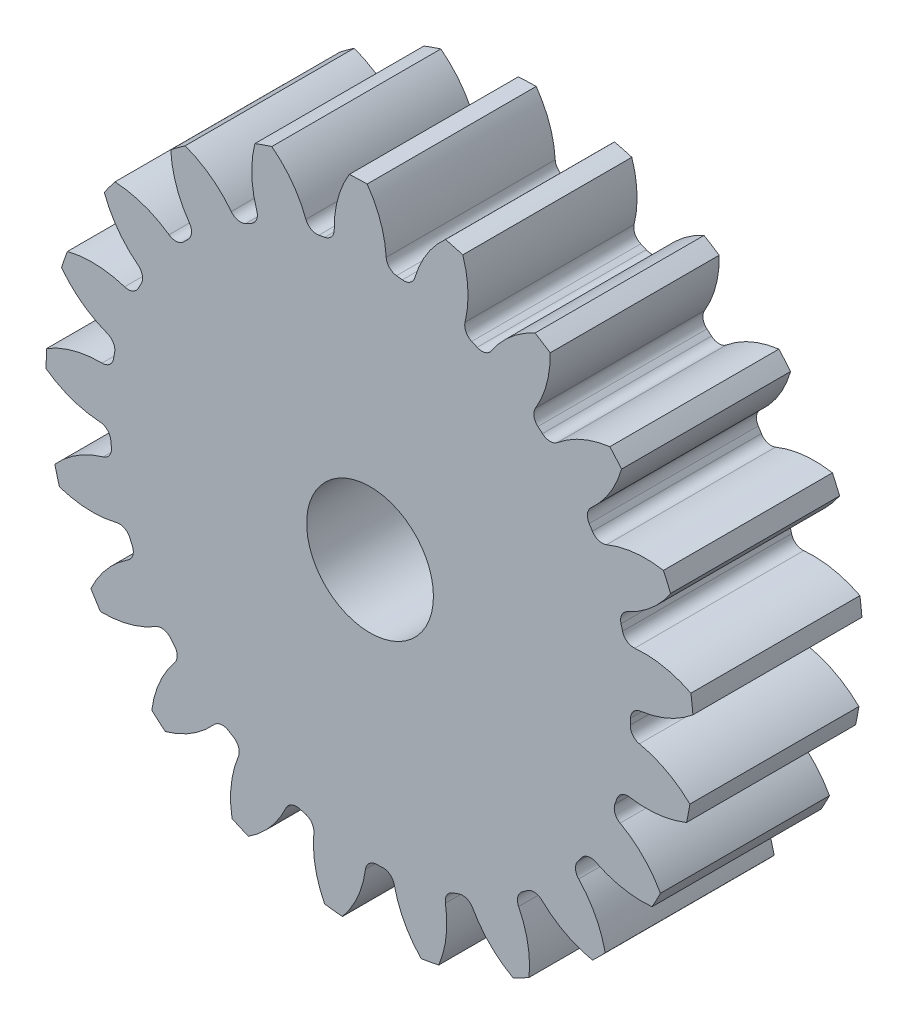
ISO-10303-21;
HEADER;
FILE_DESCRIPTION(('STEP AP214'),'2;1');
FILE_NAME('part.step','',(''),(''),'','','');
FILE_SCHEMA(('AUTOMOTIVE_DESIGN { 1 0 10303 214 1 1 1 1 }'));
ENDSEC;
DATA;
#1=APPLICATION_CONTEXT('core data for automotive mechanical design processes');
#2=APPLICATION_PROTOCOL_DEFINITION('international standard','automotive_design',2000,#1);
#3=PRODUCT_CONTEXT('',#1,'mechanical');
#4=PRODUCT('Part','Part','',(#3));
#5=PRODUCT_RELATED_PRODUCT_CATEGORY('part','',(#4));
#6=PRODUCT_DEFINITION_FORMATION('','',#4);
#7=PRODUCT_DEFINITION_CONTEXT('part definition',#1,'design');
#8=PRODUCT_DEFINITION('design','',#6,#7);
#9=PRODUCT_DEFINITION_SHAPE('','',#8);
#10=(LENGTH_UNIT() NAMED_UNIT(*) SI_UNIT(.MILLI.,.METRE.));
#11=(NAMED_UNIT(*) PLANE_ANGLE_UNIT() SI_UNIT($,.RADIAN.));
#12=(NAMED_UNIT(*) SI_UNIT($,.STERADIAN.) SOLID_ANGLE_UNIT());
#13=UNCERTAINTY_MEASURE_WITH_UNIT(LENGTH_MEASURE(1.E-05),#10,'distance_accuracy_value','');
#14=(GEOMETRIC_REPRESENTATION_CONTEXT(3) GLOBAL_UNCERTAINTY_ASSIGNED_CONTEXT((#13)) GLOBAL_UNIT_ASSIGNED_CONTEXT((#10,
#11,#12)) REPRESENTATION_CONTEXT('',''));
#15=CARTESIAN_POINT('',(0.,0.,0.));
#16=DIRECTION('',(0.,0.,1.));
#17=DIRECTION('',(1.,0.,0.));
#18=AXIS2_PLACEMENT_3D('',#15,#16,#17);
#19=CARTESIAN_POINT('',(0.,0.,101.6));
#20=DIRECTION('',(0.,0.,-1.));
#21=DIRECTION('',(-1.,0.,0.));
#22=AXIS2_PLACEMENT_3D('',#19,#20,#21);
#23=CYLINDRICAL_SURFACE('',#22,194.733333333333);
#24=DIRECTION('',(0.,0.,-1.));
#25=VECTOR('',#24,1.);
#26=CARTESIAN_POINT('',(192.855083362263,26.9812514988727,50.8));
#27=LINE('',#26,#25);
#28=CARTESIAN_POINT('',(192.855083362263,26.9812514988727,101.6));
#29=VERTEX_POINT('',#28);
#30=CARTESIAN_POINT('',(192.855083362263,26.9812514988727,0.));
#31=VERTEX_POINT('',#30);
#32=EDGE_CURVE('E852',#29,#31,#27,.T.);
#33=ORIENTED_EDGE('',*,*,#32,.F.);
#34=CARTESIAN_POINT('',(0.,0.,101.6));
#35=DIRECTION('',(0.,0.,1.));
#36=DIRECTION('',(1.,0.,0.));
#37=AXIS2_PLACEMENT_3D('',#34,#35,#36);
#38=CIRCLE('',#37,194.733333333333);
#39=CARTESIAN_POINT('',(194.052279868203,16.2721783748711,101.6));
#40=VERTEX_POINT('',#39);
#41=EDGE_CURVE('E1611',#40,#29,#38,.T.);
#42=ORIENTED_EDGE('',*,*,#41,.F.);
#43=DIRECTION('',(0.,0.,-1.));
#44=VECTOR('',#43,1.);
#45=CARTESIAN_POINT('',(194.052279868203,16.2721783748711,50.8));
#46=LINE('',#45,#44);
#47=CARTESIAN_POINT('',(194.052279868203,16.2721783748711,0.));
#48=VERTEX_POINT('',#47);
#49=EDGE_CURVE('E1605',#48,#40,#46,.F.);
#50=ORIENTED_EDGE('',*,*,#49,.F.);
#51=CARTESIAN_POINT('',(0.,0.,0.));
#52=DIRECTION('',(0.,0.,1.));
#53=DIRECTION('',(1.,0.,0.));
#54=AXIS2_PLACEMENT_3D('',#51,#52,#53);
#55=CIRCLE('',#54,194.733333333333);
#56=EDGE_CURVE('E1616',#48,#31,#55,.T.);
#57=ORIENTED_EDGE('',*,*,#56,.T.);
#58=EDGE_LOOP('',(#33,#42,#50,#57));
#59=FACE_BOUND('',#58,.T.);
#60=ADVANCED_FACE('F33',(#59),#23,.T.);
#61=DIRECTION('',(0.,0.,-1.));
#62=VECTOR('',#61,1.);
#63=CARTESIAN_POINT('',(180.634772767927,72.7471647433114,50.8));
#64=LINE('',#63,#62);
#65=CARTESIAN_POINT('',(180.634772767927,72.7471647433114,0.));
#66=VERTEX_POINT('',#65);
#67=CARTESIAN_POINT('',(180.634772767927,72.7471647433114,101.6));
#68=VERTEX_POINT('',#67);
#69=EDGE_CURVE('E823',#66,#68,#64,.F.);
#70=ORIENTED_EDGE('',*,*,#69,.F.);
#71=CARTESIAN_POINT('',(176.334209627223,82.6275839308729,0.));
#72=VERTEX_POINT('',#71);
#73=EDGE_CURVE('E1619',#66,#72,#55,.T.);
#74=ORIENTED_EDGE('',*,*,#73,.T.);
#75=DIRECTION('',(0.,0.,-1.));
#76=VECTOR('',#75,1.);
#77=CARTESIAN_POINT('',(176.334209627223,82.6275839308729,50.8));
#78=LINE('',#77,#76);
#79=CARTESIAN_POINT('',(176.334209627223,82.6275839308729,101.6));
#80=VERTEX_POINT('',#79);
#81=EDGE_CURVE('E885',#80,#72,#78,.T.);
#82=ORIENTED_EDGE('',*,*,#81,.F.);
#83=EDGE_CURVE('E1614',#68,#80,#38,.T.);
#84=ORIENTED_EDGE('',*,*,#83,.F.);
#85=EDGE_LOOP('',(#70,#74,#82,#84));
#86=FACE_BOUND('',#85,.T.);
#87=ADVANCED_FACE('F1856',(#86),#23,.T.);
#88=CARTESIAN_POINT('',(0.,0.,101.6));
#89=DIRECTION('',(0.,0.,1.));
#90=DIRECTION('',(1.,0.,0.));
#91=AXIS2_PLACEMENT_3D('',#88,#89,#90);
#92=PLANE('',#91);
#93=CARTESIAN_POINT('',(0.,0.,101.599999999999));
#94=DIRECTION('',(0.,0.,1.));
#95=DIRECTION('',(1.,0.,0.));
#96=AXIS2_PLACEMENT_3D('',#93,#94,#95);
#97=CIRCLE('',#96,38.1);
#98=CARTESIAN_POINT('',(38.1,0.,101.599999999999));
#99=VERTEX_POINT('',#98);
#100=EDGE_CURVE('E840',#99,#99,#97,.T.);
#101=ORIENTED_EDGE('',*,*,#100,.F.);
#102=EDGE_LOOP('',(#101));
#103=FACE_BOUND('',#102,.T.);
#104=ORIENTED_EDGE('',*,*,#41,.T.);
#105=CARTESIAN_POINT('',(164.667811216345,-28.2728165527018,101.6));
#106=DIRECTION('',(0.,0.,-1.));
#107=DIRECTION('',(0.955572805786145,0.294755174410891,0.));
#108=AXIS2_PLACEMENT_3D('',#105,#106,#107);
#109=CIRCLE('',#108,62.0284962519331);
#110=CARTESIAN_POINT('',(159.084630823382,33.5038978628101,101.6));
#111=VERTEX_POINT('',#110);
#112=EDGE_CURVE('E832',#111,#29,#109,.T.);
#113=ORIENTED_EDGE('',*,*,#112,.F.);
#114=CARTESIAN_POINT('',(158.464294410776,40.3677895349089,101.6));
#115=DIRECTION('',(0.,0.,1.));
#116=DIRECTION('',(-0.955572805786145,-0.294755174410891,0.));
#117=AXIS2_PLACEMENT_3D('',#114,#115,#116);
#118=CIRCLE('',#117,6.89186666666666);
#119=CARTESIAN_POINT('',(151.785722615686,38.6664650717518,101.6));
#120=VERTEX_POINT('',#119);
#121=EDGE_CURVE('E830',#120,#111,#118,.T.);
#122=ORIENTED_EDGE('',*,*,#121,.F.);
#123=CARTESIAN_POINT('',(0.,0.,101.6));
#124=DIRECTION('',(0.,0.,-1.));
#125=DIRECTION('',(0.955572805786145,0.294755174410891,0.));
#126=AXIS2_PLACEMENT_3D('',#123,#124,#125);
#127=CIRCLE('',#126,156.633333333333);
#128=CARTESIAN_POINT('',(150.857021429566,42.1445156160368,101.6));
#129=VERTEX_POINT('',#128);
#130=EDGE_CURVE('E815',#129,#120,#127,.T.);
#131=ORIENTED_EDGE('',*,*,#130,.F.);
#132=CARTESIAN_POINT('',(157.494730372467,43.9988743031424,101.6));
#133=DIRECTION('',(0.,0.,1.));
#134=DIRECTION('',(-0.955572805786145,-0.294755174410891,0.));
#135=AXIS2_PLACEMENT_3D('',#132,#133,#134);
#136=CIRCLE('',#135,6.89186666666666);
#137=CARTESIAN_POINT('',(154.610889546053,50.2583701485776,101.6));
#138=VERTEX_POINT('',#137);
#139=EDGE_CURVE('E807',#138,#129,#136,.T.);
#140=ORIENTED_EDGE('',*,*,#139,.F.);
#141=CARTESIAN_POINT('',(128.655612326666,106.595373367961,101.6));
#142=DIRECTION('',(0.,0.,-1.));
#143=DIRECTION('',(-0.955572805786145,-0.294755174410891,0.));
#144=AXIS2_PLACEMENT_3D('',#141,#142,#143);
#145=CIRCLE('',#144,62.0284962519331);
#146=EDGE_CURVE('E837',#68,#138,#145,.T.);
#147=ORIENTED_EDGE('',*,*,#146,.F.);
#148=ORIENTED_EDGE('',*,*,#83,.T.);
#149=CARTESIAN_POINT('',(165.685641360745,21.5199547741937,101.6));
#150=DIRECTION('',(0.,0.,-1.));
#151=DIRECTION('',(0.826238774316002,0.563320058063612,0.));
#152=AXIS2_PLACEMENT_3D('',#149,#150,#151);
#153=CIRCLE('',#152,62.0284962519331);
#154=CARTESIAN_POINT('',(142.141499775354,78.9064317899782,101.6));
#155=VERTEX_POINT('',#154);
#156=EDGE_CURVE('E861',#155,#80,#153,.T.);
#157=ORIENTED_EDGE('',*,*,#156,.F.);
#158=CARTESIAN_POINT('',(139.525555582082,85.2825326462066,101.6));
#159=DIRECTION('',(0.,0.,1.));
#160=DIRECTION('',(-0.826238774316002,-0.563320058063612,0.));
#161=AXIS2_PLACEMENT_3D('',#158,#159,#160);
#162=CIRCLE('',#161,6.89186666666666);
#163=CARTESIAN_POINT('',(133.645168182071,81.6882496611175,101.6));
#164=VERTEX_POINT('',#163);
#165=EDGE_CURVE('E859',#164,#155,#162,.T.);
#166=ORIENTED_EDGE('',*,*,#165,.F.);
#167=CARTESIAN_POINT('',(0.,0.,101.6));
#168=DIRECTION('',(0.,0.,-1.));
#169=DIRECTION('',(0.826238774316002,0.563320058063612,0.));
#170=AXIS2_PLACEMENT_3D('',#167,#168,#169);
#171=CIRCLE('',#170,156.633333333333);
#172=CARTESIAN_POINT('',(131.732553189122,84.7380406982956,101.6));
#173=VERTEX_POINT('',#172);
#174=EDGE_CURVE('E856',#173,#164,#171,.T.);
#175=ORIENTED_EDGE('',*,*,#174,.F.);
#176=CARTESIAN_POINT('',(137.528785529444,88.4665144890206,101.6));
#177=DIRECTION('',(0.,0.,1.));
#178=DIRECTION('',(-0.826238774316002,-0.563320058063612,0.));
#179=AXIS2_PLACEMENT_3D('',#176,#177,#178);
#180=CIRCLE('',#179,6.89186666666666);
#181=CARTESIAN_POINT('',(132.928046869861,93.5978914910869,101.6));
#182=VERTEX_POINT('',#181);
#183=EDGE_CURVE('E854',#182,#173,#180,.T.);
#184=ORIENTED_EDGE('',*,*,#183,.F.);
#185=CARTESIAN_POINT('',(91.5202665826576,139.781547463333,101.6));
#186=DIRECTION('',(0.,0.,-1.));
#187=DIRECTION('',(-0.826238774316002,-0.563320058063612,0.));
#188=AXIS2_PLACEMENT_3D('',#185,#186,#187);
#189=CIRCLE('',#188,62.0284962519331);
#190=CARTESIAN_POINT('',(151.167073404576,122.758246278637,101.6));
#191=VERTEX_POINT('',#190);
#192=EDGE_CURVE('E864',#191,#182,#189,.T.);
#193=ORIENTED_EDGE('',*,*,#192,.F.);
#194=CARTESIAN_POINT('',(144.145267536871,130.932092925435,101.6));
#195=VERTEX_POINT('',#194);
#196=EDGE_CURVE('E1669',#191,#195,#38,.T.);
#197=ORIENTED_EDGE('',*,*,#196,.T.);
#198=CARTESIAN_POINT('',(151.981575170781,69.400583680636,101.6));
#199=DIRECTION('',(0.,0.,-1.));
#200=DIRECTION('',(0.623489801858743,0.781831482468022,0.));
#201=AXIS2_PLACEMENT_3D('',#198,#199,#200);
#202=CIRCLE('',#201,62.0284962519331);
#203=CARTESIAN_POINT('',(112.568472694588,117.297782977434,101.6));
#204=VERTEX_POINT('',#203);
#205=EDGE_CURVE('E896',#204,#195,#202,.T.);
#206=ORIENTED_EDGE('',*,*,#205,.F.);
#207=CARTESIAN_POINT('',(108.189358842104,122.619548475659,101.6));
#208=DIRECTION('',(0.,0.,1.));
#209=DIRECTION('',(-0.623489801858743,-0.781831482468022,0.));
#210=AXIS2_PLACEMENT_3D('',#207,#208,#209);
#211=CIRCLE('',#210,6.89186666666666);
#212=CARTESIAN_POINT('',(103.629654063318,117.451674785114,101.6));
#213=VERTEX_POINT('',#212);
#214=EDGE_CURVE('E894',#213,#204,#211,.T.);
#215=ORIENTED_EDGE('',*,*,#214,.F.);
#216=CARTESIAN_POINT('',(0.,0.,101.6));
#217=DIRECTION('',(0.,0.,-1.));
#218=DIRECTION('',(0.623489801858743,0.781831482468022,0.));
#219=AXIS2_PLACEMENT_3D('',#216,#217,#218);
#220=CIRCLE('',#219,156.633333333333);
#221=CARTESIAN_POINT('',(100.903069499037,119.802218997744,101.6));
#222=VERTEX_POINT('',#221);
#223=EDGE_CURVE('E891',#222,#213,#220,.T.);
#224=ORIENTED_EDGE('',*,*,#223,.F.);
#225=CARTESIAN_POINT('',(105.342804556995,125.073516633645,101.6));
#226=DIRECTION('',(0.,0.,1.));
#227=DIRECTION('',(-0.623489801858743,-0.781831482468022,0.));
#228=AXIS2_PLACEMENT_3D('',#225,#226,#227);
#229=CIRCLE('',#228,6.89186666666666);
#230=CARTESIAN_POINT('',(99.4339638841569,128.620829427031,101.6));
#231=VERTEX_POINT('',#230);
#232=EDGE_CURVE('E889',#231,#222,#229,.T.);
#233=ORIENTED_EDGE('',*,*,#232,.F.);
#234=CARTESIAN_POINT('',(46.252943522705,160.547517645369,101.6));
#235=DIRECTION('',(0.,0.,-1.));
#236=DIRECTION('',(-0.623489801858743,-0.781831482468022,0.));
#237=AXIS2_PLACEMENT_3D('',#234,#235,#236);
#238=CIRCLE('',#237,62.0284962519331);
#239=CARTESIAN_POINT('',(108.267516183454,161.861718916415,101.6));
#240=VERTEX_POINT('',#239);
#241=EDGE_CURVE('E899',#240,#231,#238,.T.);
#242=ORIENTED_EDGE('',*,*,#241,.F.);
#243=CARTESIAN_POINT('',(99.1483858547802,167.602710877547,101.6));
#244=VERTEX_POINT('',#243);
#245=EDGE_CURVE('E1838',#240,#244,#38,.T.);
#246=ORIENTED_EDGE('',*,*,#245,.T.);
#247=CARTESIAN_POINT('',(124.773279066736,111.114666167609,101.6));
#248=DIRECTION('',(0.,0.,-1.));
#249=DIRECTION('',(0.365341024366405,0.9308737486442,0.));
#250=AXIS2_PLACEMENT_3D('',#247,#248,#249);
#251=CIRCLE('',#250,62.0284962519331);
#252=CARTESIAN_POINT('',(72.9932428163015,145.266711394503,101.6));
#253=VERTEX_POINT('',#252);
#254=EDGE_CURVE('E934',#253,#244,#251,.T.);
#255=ORIENTED_EDGE('',*,*,#254,.F.);
#256=CARTESIAN_POINT('',(67.2400627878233,149.061279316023,101.6));
#257=DIRECTION('',(0.,0.,1.));
#258=DIRECTION('',(-0.365341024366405,-0.9308737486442,0.));
#259=AXIS2_PLACEMENT_3D('',#256,#257,#258);
#260=CIRCLE('',#259,6.89186666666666);
#261=CARTESIAN_POINT('',(64.4061904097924,142.779003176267,101.6));
#262=VERTEX_POINT('',#261);
#263=EDGE_CURVE('E932',#262,#253,#260,.T.);
#264=ORIENTED_EDGE('',*,*,#263,.F.);
#265=CARTESIAN_POINT('',(0.,0.,101.6));
#266=DIRECTION('',(0.,0.,-1.));
#267=DIRECTION('',(0.365341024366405,0.9308737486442,0.));
#268=AXIS2_PLACEMENT_3D('',#265,#266,#267);
#269=CIRCLE('',#268,156.633333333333);
#270=CARTESIAN_POINT('',(61.1079052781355,144.221444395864,101.6));
#271=VERTEX_POINT('',#270);
#272=EDGE_CURVE('E929',#271,#262,#269,.T.);
#273=ORIENTED_EDGE('',*,*,#272,.F.);
#274=CARTESIAN_POINT('',(63.7966531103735,150.567187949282,101.6));
#275=DIRECTION('',(0.,0.,1.));
#276=DIRECTION('',(-0.365341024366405,-0.9308737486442,0.));
#277=AXIS2_PLACEMENT_3D('',#274,#275,#276);
#278=CIRCLE('',#277,6.89186666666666);
#279=CARTESIAN_POINT('',(57.1047368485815,152.215242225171,101.6));
#280=VERTEX_POINT('',#279);
#281=EDGE_CURVE('E927',#280,#271,#278,.T.);
#282=ORIENTED_EDGE('',*,*,#281,.F.);
#283=CARTESIAN_POINT('',(-3.12415654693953,167.048136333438,101.6));
#284=DIRECTION('',(0.,0.,-1.));
#285=DIRECTION('',(-0.365341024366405,-0.9308737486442,0.));
#286=AXIS2_PLACEMENT_3D('',#283,#284,#285);
#287=CIRCLE('',#286,62.0284962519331);
#288=CARTESIAN_POINT('',(55.7479150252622,186.583067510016,101.6));
#289=VERTEX_POINT('',#288);
#290=EDGE_CURVE('E937',#289,#280,#287,.T.);
#291=ORIENTED_EDGE('',*,*,#290,.F.);
#292=CARTESIAN_POINT('',(45.3417349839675,189.381092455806,101.6));
#293=VERTEX_POINT('',#292);
#294=EDGE_CURVE('E1834',#289,#293,#38,.T.);
#295=ORIENTED_EDGE('',*,*,#294,.T.);
#296=CARTESIAN_POINT('',(86.4783295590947,142.955722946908,101.6));
#297=DIRECTION('',(0.,0.,-1.));
#298=DIRECTION('',(0.074730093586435,0.997203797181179,0.));
#299=AXIS2_PLACEMENT_3D('',#296,#297,#298);
#300=CIRCLE('',#299,62.0284962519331);
#301=CARTESIAN_POINT('',(26.9322429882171,160.328055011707,101.6));
#302=VERTEX_POINT('',#301);
#303=EDGE_CURVE('E972',#302,#293,#300,.T.);
#304=ORIENTED_EDGE('',*,*,#303,.F.);
#305=CARTESIAN_POINT('',(20.3161920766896,162.258261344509,101.6));
#306=DIRECTION('',(0.,0.,1.));
#307=DIRECTION('',(-0.074730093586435,-0.997203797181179,0.));
#308=AXIS2_PLACEMENT_3D('',#305,#306,#307);
#309=CIRCLE('',#308,6.89186666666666);
#310=CARTESIAN_POINT('',(19.459954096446,155.419790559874,101.6));
#311=VERTEX_POINT('',#310);
#312=EDGE_CURVE('E970',#311,#302,#309,.T.);
#313=ORIENTED_EDGE('',*,*,#312,.F.);
#314=CARTESIAN_POINT('',(0.,0.,101.6));
#315=DIRECTION('',(0.,0.,-1.));
#316=DIRECTION('',(0.074730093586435,0.997203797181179,0.));
#317=AXIS2_PLACEMENT_3D('',#314,#315,#316);
#318=CIRCLE('',#317,156.633333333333);
#319=CARTESIAN_POINT('',(15.8830355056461,155.825961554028,101.6));
#320=VERTEX_POINT('',#319);
#321=EDGE_CURVE('E967',#320,#311,#318,.T.);
#322=ORIENTED_EDGE('',*,*,#321,.F.);
#323=CARTESIAN_POINT('',(16.5818890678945,162.682303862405,101.6));
#324=DIRECTION('',(0.,0.,1.));
#325=DIRECTION('',(-0.074730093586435,-0.997203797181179,0.));
#326=AXIS2_PLACEMENT_3D('',#323,#324,#325);
#327=CIRCLE('',#326,6.89186666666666);
#328=CARTESIAN_POINT('',(9.70150334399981,162.284662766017,101.6));
#329=VERTEX_POINT('',#328);
#330=EDGE_CURVE('E965',#329,#320,#327,.T.);
#331=ORIENTED_EDGE('',*,*,#330,.F.);
#332=CARTESIAN_POINT('',(-52.2236615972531,158.705795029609,101.6));
#333=DIRECTION('',(0.,0.,-1.));
#334=DIRECTION('',(-0.074730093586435,-0.997203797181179,0.));
#335=AXIS2_PLACEMENT_3D('',#332,#333,#334);
#336=CIRCLE('',#335,62.0284962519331);
#337=CARTESIAN_POINT('',(-1.72513302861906,194.725691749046,101.6));
#338=VERTEX_POINT('',#337);
#339=EDGE_CURVE('E975',#338,#329,#336,.T.);
#340=ORIENTED_EDGE('',*,*,#339,.F.);
#341=CARTESIAN_POINT('',(-12.4937280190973,194.332132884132,101.6));
#342=VERTEX_POINT('',#341);
#343=EDGE_CURVE('E1830',#338,#342,#38,.T.);
#344=ORIENTED_EDGE('',*,*,#343,.T.);
#345=CARTESIAN_POINT('',(40.4994009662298,162.094536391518,101.6));
#346=DIRECTION('',(0.,0.,-1.));
#347=DIRECTION('',(-0.222520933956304,0.974927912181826,0.));
#348=AXIS2_PLACEMENT_3D('',#345,#346,#347);
#349=CIRCLE('',#348,62.0284962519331);
#350=CARTESIAN_POINT('',(-21.5218048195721,161.14354735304,101.6));
#351=VERTEX_POINT('',#350);
#352=EDGE_CURVE('E1010',#351,#342,#349,.T.);
#353=ORIENTED_EDGE('',*,*,#352,.F.);
#354=CARTESIAN_POINT('',(-28.4128614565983,161.037884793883,101.6));
#355=DIRECTION('',(0.,0.,1.));
#356=DIRECTION('',(0.222520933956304,-0.974927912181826,0.));
#357=AXIS2_PLACEMENT_3D('',#354,#355,#356);
#358=CIRCLE('',#357,6.89186666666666);
#359=CARTESIAN_POINT('',(-27.2153845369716,154.25084750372,101.6));
#360=VERTEX_POINT('',#359);
#361=EDGE_CURVE('E1008',#360,#351,#358,.T.);
#362=ORIENTED_EDGE('',*,*,#361,.F.);
#363=CARTESIAN_POINT('',(0.,0.,101.6));
#364=DIRECTION('',(0.,0.,-1.));
#365=DIRECTION('',(-0.222520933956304,0.974927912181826,0.));
#366=AXIS2_PLACEMENT_3D('',#363,#364,#365);
#367=CIRCLE('',#366,156.633333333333);
#368=CARTESIAN_POINT('',(-30.7531116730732,153.584658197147,101.6));
#369=VERTEX_POINT('',#368);
#370=EDGE_CURVE('E1005',#369,#360,#367,.T.);
#371=ORIENTED_EDGE('',*,*,#370,.F.);
#372=CARTESIAN_POINT('',(-32.1062485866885,160.342383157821,101.6));
#373=DIRECTION('',(0.,0.,1.));
#374=DIRECTION('',(0.222520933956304,-0.974927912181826,0.));
#375=AXIS2_PLACEMENT_3D('',#372,#373,#374);
#376=CIRCLE('',#375,6.89186666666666);
#377=CARTESIAN_POINT('',(-38.5637513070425,157.934378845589,101.6));
#378=VERTEX_POINT('',#377);
#379=EDGE_CURVE('E1003',#378,#369,#376,.T.);
#380=ORIENTED_EDGE('',*,*,#379,.F.);
#381=CARTESIAN_POINT('',(-96.6828651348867,136.261747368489,101.6));
#382=DIRECTION('',(0.,0.,-1.));
#383=DIRECTION('',(0.222520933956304,-0.974927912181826,0.));
#384=AXIS2_PLACEMENT_3D('',#381,#382,#383);
#385=CIRCLE('',#384,62.0284962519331);
#386=CARTESIAN_POINT('',(-59.044895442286,185.56608373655,101.6));
#387=VERTEX_POINT('',#386);
#388=EDGE_CURVE('E1013',#387,#378,#385,.T.);
#389=ORIENTED_EDGE('',*,*,#388,.F.);
#390=CARTESIAN_POINT('',(-69.2190684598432,182.015910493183,101.6));
#391=VERTEX_POINT('',#390);
#392=EDGE_CURVE('E1826',#387,#391,#38,.T.);
#393=ORIENTED_EDGE('',*,*,#392,.T.);
#394=CARTESIAN_POINT('',(-9.07807713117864,166.830538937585,101.6));
#395=DIRECTION('',(0.,0.,-1.));
#396=DIRECTION('',(-0.499999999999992,0.866025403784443,0.));
#397=AXIS2_PLACEMENT_3D('',#394,#395,#396);
#398=CIRCLE('',#397,62.0284962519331);
#399=CARTESIAN_POINT('',(-68.0635458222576,147.640728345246,101.6));
#400=VERTEX_POINT('',#399);
#401=EDGE_CURVE('E1048',#400,#391,#398,.T.);
#402=ORIENTED_EDGE('',*,*,#401,.F.);
#403=CARTESIAN_POINT('',(-74.6173075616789,145.508585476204,101.6));
#404=DIRECTION('',(0.,0.,1.));
#405=DIRECTION('',(0.499999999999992,-0.866025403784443,0.));
#406=AXIS2_PLACEMENT_3D('',#403,#404,#405);
#407=CIRCLE('',#406,6.89186666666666);
#408=CARTESIAN_POINT('',(-71.4725168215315,139.376039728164,101.6));
#409=VERTEX_POINT('',#408);
#410=EDGE_CURVE('E1046',#409,#400,#407,.T.);
#411=ORIENTED_EDGE('',*,*,#410,.F.);
#412=CARTESIAN_POINT('',(0.,0.,101.6));
#413=DIRECTION('',(0.,0.,-1.));
#414=DIRECTION('',(-0.499999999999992,0.866025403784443,0.));
#415=AXIS2_PLACEMENT_3D('',#412,#413,#414);
#416=CIRCLE('',#415,156.633333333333);
#417=CARTESIAN_POINT('',(-74.6567099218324,137.696683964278,101.6));
#418=VERTEX_POINT('',#417);
#419=EDGE_CURVE('E1043',#418,#409,#416,.T.);
#420=ORIENTED_EDGE('',*,*,#419,.F.);
#421=CARTESIAN_POINT('',(-77.9416051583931,143.755338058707,101.6));
#422=DIRECTION('',(0.,0.,1.));
#423=DIRECTION('',(0.499999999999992,-0.866025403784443,0.));
#424=AXIS2_PLACEMENT_3D('',#421,#422,#423);
#425=CIRCLE('',#424,6.89186666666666);
#426=CARTESIAN_POINT('',(-83.402447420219,139.550932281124,101.6));
#427=VERTEX_POINT('',#426);
#428=EDGE_CURVE('E1041',#427,#418,#425,.T.);
#429=ORIENTED_EDGE('',*,*,#428,.F.);
#430=CARTESIAN_POINT('',(-132.55137181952,101.71024547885,101.6));
#431=DIRECTION('',(0.,0.,-1.));
#432=DIRECTION('',(0.499999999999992,-0.866025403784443,0.));
#433=AXIS2_PLACEMENT_3D('',#430,#431,#432);
#434=CIRCLE('',#433,62.0284962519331);
#435=CARTESIAN_POINT('',(-111.11825978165,159.918114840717,101.6));
#436=VERTEX_POINT('',#435);
#437=EDGE_CURVE('E1051',#436,#427,#434,.T.);
#438=ORIENTED_EDGE('',*,*,#437,.F.);
#439=CARTESIAN_POINT('',(-119.793990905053,153.526775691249,101.6));
#440=VERTEX_POINT('',#439);
#441=EDGE_CURVE('E1822',#436,#440,#38,.T.);
#442=ORIENTED_EDGE('',*,*,#441,.T.);
#443=CARTESIAN_POINT('',(-57.8489282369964,156.742915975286,101.6));
#444=DIRECTION('',(0.,0.,-1.));
#445=DIRECTION('',(-0.73305187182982,0.680172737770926,0.));
#446=AXIS2_PLACEMENT_3D('',#443,#444,#445);
#447=CIRCLE('',#446,62.0284962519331);
#448=CARTESIAN_POINT('',(-108.557542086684,121.019382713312,101.6));
#449=VERTEX_POINT('',#448);
#450=EDGE_CURVE('E1086',#449,#440,#447,.T.);
#451=ORIENTED_EDGE('',*,*,#450,.F.);
#452=CARTESIAN_POINT('',(-114.191678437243,117.050209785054,101.6));
#453=DIRECTION('',(0.,0.,1.));
#454=DIRECTION('',(0.73305187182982,-0.680172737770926,0.));
#455=AXIS2_PLACEMENT_3D('',#452,#453,#454);
#456=CIRCLE('',#455,6.89186666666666);
#457=CARTESIAN_POINT('',(-109.379002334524,112.117059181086,101.6));
#458=VERTEX_POINT('',#457);
#459=EDGE_CURVE('E1084',#458,#449,#456,.T.);
#460=ORIENTED_EDGE('',*,*,#459,.F.);
#461=CARTESIAN_POINT('',(0.,0.,101.6));
#462=DIRECTION('',(0.,0.,-1.));
#463=DIRECTION('',(-0.73305187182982,0.680172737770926,0.));
#464=AXIS2_PLACEMENT_3D('',#461,#462,#463);
#465=CIRCLE('',#464,156.633333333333);
#466=CARTESIAN_POINT('',(-111.926731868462,109.573755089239,101.6));
#467=VERTEX_POINT('',#466);
#468=EDGE_CURVE('E1081',#467,#458,#465,.T.);
#469=ORIENTED_EDGE('',*,*,#468,.F.);
#470=CARTESIAN_POINT('',(-116.851508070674,114.395000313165,101.6));
#471=DIRECTION('',(0.,0.,1.));
#472=DIRECTION('',(0.73305187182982,-0.680172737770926,0.));
#473=AXIS2_PLACEMENT_3D('',#470,#471,#472);
#474=CIRCLE('',#473,6.89186666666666);
#475=CARTESIAN_POINT('',(-120.830470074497,108.767772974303,101.6));
#476=VERTEX_POINT('',#475);
#477=EDGE_CURVE('E1079',#476,#467,#474,.T.);
#478=ORIENTED_EDGE('',*,*,#477,.F.);
#479=CARTESIAN_POINT('',(-156.642107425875,58.121341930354,101.6));
#480=DIRECTION('',(0.,0.,-1.));
#481=DIRECTION('',(0.73305187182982,-0.680172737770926,0.));
#482=AXIS2_PLACEMENT_3D('',#479,#480,#481);
#483=CIRCLE('',#482,62.0284962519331);
#484=CARTESIAN_POINT('',(-153.318279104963,120.060719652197,101.6));
#485=VERTEX_POINT('',#484);
#486=EDGE_CURVE('E1089',#485,#476,#483,.T.);
#487=ORIENTED_EDGE('',*,*,#486,.F.);
#488=CARTESIAN_POINT('',(-159.724691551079,111.396113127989,101.6));
#489=VERTEX_POINT('',#488);
#490=EDGE_CURVE('E1818',#485,#489,#38,.T.);
#491=ORIENTED_EDGE('',*,*,#490,.T.);
#492=CARTESIAN_POINT('',(-101.479648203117,132.727997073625,101.6));
#493=DIRECTION('',(0.,0.,-1.));
#494=DIRECTION('',(-0.900968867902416,0.433883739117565,0.));
#495=AXIS2_PLACEMENT_3D('',#492,#493,#494);
#496=CIRCLE('',#495,62.0284962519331);
#497=CARTESIAN_POINT('',(-139.405724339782,83.6449338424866,101.6));
#498=VERTEX_POINT('',#497);
#499=EDGE_CURVE('E1124',#498,#489,#496,.T.);
#500=ORIENTED_EDGE('',*,*,#499,.F.);
#501=CARTESIAN_POINT('',(-143.619617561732,78.1914092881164,101.6));
#502=DIRECTION('',(0.,0.,1.));
#503=DIRECTION('',(0.900968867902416,-0.433883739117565,0.));
#504=AXIS2_PLACEMENT_3D('',#501,#502,#503);
#505=CIRCLE('',#504,6.89186666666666);
#506=CARTESIAN_POINT('',(-137.566683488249,74.8959859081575,101.6));
#507=VERTEX_POINT('',#506);
#508=EDGE_CURVE('E1122',#507,#498,#505,.T.);
#509=ORIENTED_EDGE('',*,*,#508,.F.);
#510=CARTESIAN_POINT('',(0.,0.,101.6));
#511=DIRECTION('',(0.,0.,-1.));
#512=DIRECTION('',(-0.900968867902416,0.433883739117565,0.));
#513=AXIS2_PLACEMENT_3D('',#510,#511,#512);
#514=CIRCLE('',#513,156.633333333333);
#515=CARTESIAN_POINT('',(-139.251572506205,71.7147172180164,101.6));
#516=VERTEX_POINT('',#515);
#517=EDGE_CURVE('E1119',#516,#507,#514,.T.);
#518=ORIENTED_EDGE('',*,*,#517,.F.);
#519=CARTESIAN_POINT('',(-145.378641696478,74.8701647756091,101.6));
#520=DIRECTION('',(0.,0.,1.));
#521=DIRECTION('',(0.900968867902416,-0.433883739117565,0.));
#522=AXIS2_PLACEMENT_3D('',#519,#520,#521);
#523=CIRCLE('',#522,6.89186666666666);
#524=CARTESIAN_POINT('',(-147.522175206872,68.3201197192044,101.6));
#525=VERTEX_POINT('',#524);
#526=EDGE_CURVE('E1117',#525,#516,#523,.T.);
#527=ORIENTED_EDGE('',*,*,#526,.F.);
#528=CARTESIAN_POINT('',(-166.814504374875,9.36810209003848,101.6));
#529=DIRECTION('',(0.,0.,-1.));
#530=DIRECTION('',(0.900968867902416,-0.433883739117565,0.));
#531=AXIS2_PLACEMENT_3D('',#528,#529,#530);
#532=CIRCLE('',#531,62.0284962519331);
#533=CARTESIAN_POINT('',(-181.895296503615,69.5354026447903,101.6));
#534=VERTEX_POINT('',#533);
#535=EDGE_CURVE('E1127',#534,#525,#532,.T.);
#536=ORIENTED_EDGE('',*,*,#535,.F.);
#537=CARTESIAN_POINT('',(-185.463152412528,59.3674170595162,101.6));
#538=VERTEX_POINT('',#537);
#539=EDGE_CURVE('E1814',#534,#538,#38,.T.);
#540=ORIENTED_EDGE('',*,*,#539,.T.);
#541=CARTESIAN_POINT('',(-136.093456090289,96.9196131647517,101.6));
#542=DIRECTION('',(0.,0.,-1.));
#543=DIRECTION('',(-0.988830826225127,0.149042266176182,0.));
#544=AXIS2_PLACEMENT_3D('',#541,#542,#543);
#545=CIRCLE('',#544,62.0284962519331);
#546=CARTESIAN_POINT('',(-157.867096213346,38.83826553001,101.6));
#547=VERTEX_POINT('',#546);
#548=EDGE_CURVE('E1162',#547,#538,#545,.T.);
#549=ORIENTED_EDGE('',*,*,#548,.F.);
#550=CARTESIAN_POINT('',(-160.28632340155,32.3849589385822,101.6));
#551=DIRECTION('',(0.,0.,1.));
#552=DIRECTION('',(0.988830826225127,-0.149042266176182,0.));
#553=AXIS2_PLACEMENT_3D('',#550,#551,#552);
#554=CIRCLE('',#553,6.89186666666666);
#555=CARTESIAN_POINT('',(-153.530961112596,31.0200756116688,101.6));
#556=VERTEX_POINT('',#555);
#557=EDGE_CURVE('E1160',#556,#547,#554,.T.);
#558=ORIENTED_EDGE('',*,*,#557,.F.);
#559=CARTESIAN_POINT('',(0.,0.,101.6));
#560=DIRECTION('',(0.,0.,-1.));
#561=DIRECTION('',(-0.988830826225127,0.149042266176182,0.));
#562=AXIS2_PLACEMENT_3D('',#559,#560,#561);
#563=CIRCLE('',#562,156.633333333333);
#564=CARTESIAN_POINT('',(-154.203299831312,27.4835120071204,101.6));
#565=VERTEX_POINT('',#564);
#566=EDGE_CURVE('E1157',#565,#556,#563,.T.);
#567=ORIENTED_EDGE('',*,*,#566,.F.);
#568=CARTESIAN_POINT('',(-160.98824502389,28.6927865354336,101.6));
#569=DIRECTION('',(0.,0.,1.));
#570=DIRECTION('',(0.988830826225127,-0.149042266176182,0.));
#571=AXIS2_PLACEMENT_3D('',#568,#569,#570);
#572=CIRCLE('',#571,6.89186666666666);
#573=CARTESIAN_POINT('',(-161.105887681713,21.8019240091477,101.6));
#574=VERTEX_POINT('',#573);
#575=EDGE_CURVE('E1155',#574,#565,#572,.T.);
#576=ORIENTED_EDGE('',*,*,#575,.F.);
#577=CARTESIAN_POINT('',(-162.164700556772,-40.2175347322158,101.6));
#578=DIRECTION('',(0.,0.,-1.));
#579=DIRECTION('',(0.988830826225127,-0.149042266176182,0.));
#580=AXIS2_PLACEMENT_3D('',#577,#578,#579);
#581=CIRCLE('',#580,62.0284962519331);
#582=CARTESIAN_POINT('',(-194.310118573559,12.8315599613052,101.6));
#583=VERTEX_POINT('',#582);
#584=EDGE_CURVE('E1165',#583,#574,#581,.T.);
#585=ORIENTED_EDGE('',*,*,#584,.F.);
#586=CARTESIAN_POINT('',(-194.722398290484,2.06366545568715,101.6));
#587=VERTEX_POINT('',#586);
#588=EDGE_CURVE('E1810',#583,#587,#38,.T.);
#589=ORIENTED_EDGE('',*,*,#588,.T.);
#590=CARTESIAN_POINT('',(-158.614763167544,52.4994963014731,101.6));
#591=DIRECTION('',(0.,0.,-1.));
#592=DIRECTION('',(-0.98883082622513,-0.149042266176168,0.));
#593=AXIS2_PLACEMENT_3D('',#590,#591,#592);
#594=CIRCLE('',#593,62.0284962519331);
#595=CARTESIAN_POINT('',(-162.301283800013,-9.41935311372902,101.6));
#596=VERTEX_POINT('',#595);
#597=EDGE_CURVE('E1200',#596,#587,#594,.T.);
#598=ORIENTED_EDGE('',*,*,#597,.F.);
#599=CARTESIAN_POINT('',(-162.710886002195,-16.2990371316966,101.6));
#600=DIRECTION('',(0.,0.,1.));
#601=DIRECTION('',(0.98883082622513,0.149042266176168,0.));
#602=AXIS2_PLACEMENT_3D('',#599,#600,#601);
#603=CIRCLE('',#602,6.89186666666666);
#604=CARTESIAN_POINT('',(-155.853339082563,-15.6121045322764,101.6));
#605=VERTEX_POINT('',#604);
#606=EDGE_CURVE('E1198',#605,#596,#603,.T.);
#607=ORIENTED_EDGE('',*,*,#606,.F.);
#608=CARTESIAN_POINT('',(0.,0.,101.6));
#609=DIRECTION('',(0.,0.,-1.));
#610=DIRECTION('',(-0.98883082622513,-0.149042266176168,0.));
#611=AXIS2_PLACEMENT_3D('',#608,#609,#610);
#612=CIRCLE('',#611,156.633333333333);
#613=CARTESIAN_POINT('',(-155.453387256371,-19.1897238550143,101.6));
#614=VERTEX_POINT('',#613);
#615=EDGE_CURVE('E1195',#614,#605,#612,.T.);
#616=ORIENTED_EDGE('',*,*,#615,.F.);
#617=CARTESIAN_POINT('',(-162.293336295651,-20.0340717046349,101.6));
#618=DIRECTION('',(0.,0.,1.));
#619=DIRECTION('',(0.98883082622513,0.149042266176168,0.));
#620=AXIS2_PLACEMENT_3D('',#617,#618,#619);
#621=CIRCLE('',#620,6.89186666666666);
#622=CARTESIAN_POINT('',(-160.374635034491,-26.6534683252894,101.6));
#623=VERTEX_POINT('',#622);
#624=EDGE_CURVE('E1193',#623,#614,#621,.T.);
#625=ORIENTED_EDGE('',*,*,#624,.F.);
#626=CARTESIAN_POINT('',(-143.105851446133,-86.2296671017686,101.6));
#627=DIRECTION('',(0.,0.,-1.));
#628=DIRECTION('',(0.98883082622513,0.149042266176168,0.));
#629=AXIS2_PLACEMENT_3D('',#626,#627,#628);
#630=CIRCLE('',#629,62.0284962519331);
#631=CARTESIAN_POINT('',(-189.459633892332,-45.0124231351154,101.6));
#632=VERTEX_POINT('',#631);
#633=EDGE_CURVE('E1203',#632,#623,#630,.T.);
#634=ORIENTED_EDGE('',*,*,#633,.F.);
#635=CARTESIAN_POINT('',(-186.679704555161,-55.4234518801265,101.6));
#636=VERTEX_POINT('',#635);
#637=EDGE_CURVE('E1806',#632,#636,#38,.T.);
#638=ORIENTED_EDGE('',*,*,#637,.T.);
#639=CARTESIAN_POINT('',(-167.04245246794,3.41456880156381,101.6));
#640=DIRECTION('',(0.,0.,-1.));
#641=DIRECTION('',(-0.900968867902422,-0.433883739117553,0.));
#642=AXIS2_PLACEMENT_3D('',#639,#640,#641);
#643=CIRCLE('',#642,62.0284962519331);
#644=CARTESIAN_POINT('',(-152.314290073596,-56.8400208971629,101.6));
#645=VERTEX_POINT('',#644);
#646=EDGE_CURVE('E1238',#645,#636,#643,.T.);
#647=ORIENTED_EDGE('',*,*,#646,.F.);
#648=CARTESIAN_POINT('',(-150.677872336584,-63.5347922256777,101.6));
#649=DIRECTION('',(0.,0.,1.));
#650=DIRECTION('',(0.900968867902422,0.433883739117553,0.));
#651=AXIS2_PLACEMENT_3D('',#648,#649,#650);
#652=CIRCLE('',#651,6.89186666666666);
#653=CARTESIAN_POINT('',(-144.327463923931,-60.8570806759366,101.6));
#654=VERTEX_POINT('',#653);
#655=EDGE_CURVE('E1236',#654,#645,#652,.T.);
#656=ORIENTED_EDGE('',*,*,#655,.F.);
#657=CARTESIAN_POINT('',(0.,0.,101.6));
#658=DIRECTION('',(0.,0.,-1.));
#659=DIRECTION('',(-0.900968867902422,-0.433883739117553,0.));
#660=AXIS2_PLACEMENT_3D('',#657,#658,#659);
#661=CIRCLE('',#660,156.633333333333);
#662=CARTESIAN_POINT('',(-142.890759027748,-64.1578685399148,101.6));
#663=VERTEX_POINT('',#662);
#664=EDGE_CURVE('E1233',#663,#654,#661,.T.);
#665=ORIENTED_EDGE('',*,*,#664,.F.);
#666=CARTESIAN_POINT('',(-149.177952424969,-66.9808147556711,101.6));
#667=DIRECTION('',(0.,0.,1.));
#668=DIRECTION('',(0.900968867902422,0.433883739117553,0.));
#669=AXIS2_PLACEMENT_3D('',#666,#667,#668);
#670=CIRCLE('',#669,6.89186666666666);
#671=CARTESIAN_POINT('',(-145.39339227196,-72.7405830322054,101.6));
#672=VERTEX_POINT('',#671);
#673=EDGE_CURVE('E1231',#672,#663,#670,.T.);
#674=ORIENTED_EDGE('',*,*,#673,.F.);
#675=CARTESIAN_POINT('',(-111.33141942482,-124.579915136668,101.6));
#676=DIRECTION('',(0.,0.,-1.));
#677=DIRECTION('',(0.900968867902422,0.433883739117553,0.));
#678=AXIS2_PLACEMENT_3D('',#675,#676,#677);
#679=CIRCLE('',#678,62.0284962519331);
#680=CARTESIAN_POINT('',(-167.774829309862,-98.8568549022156,101.6));
#681=VERTEX_POINT('',#680);
#682=EDGE_CURVE('E1241',#681,#672,#679,.T.);
#683=ORIENTED_EDGE('',*,*,#682,.F.);
#684=CARTESIAN_POINT('',(-162.049699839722,-107.985952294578,101.6));
#685=VERTEX_POINT('',#684);
#686=EDGE_CURVE('E1802',#681,#685,#38,.T.);
#687=ORIENTED_EDGE('',*,*,#686,.T.);
#688=CARTESIAN_POINT('',(-160.62768681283,-45.9737581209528,101.6));
#689=DIRECTION('',(0.,0.,-1.));
#690=DIRECTION('',(-0.73305187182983,-0.680172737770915,0.));
#691=AXIS2_PLACEMENT_3D('',#688,#689,#690);
#692=CIRCLE('',#691,62.0284962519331);
#693=CARTESIAN_POINT('',(-128.793503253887,-99.2102033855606,101.6));
#694=VERTEX_POINT('',#693);
#695=EDGE_CURVE('E1276',#694,#685,#692,.T.);
#696=ORIENTED_EDGE('',*,*,#695,.F.);
#697=CARTESIAN_POINT('',(-125.256468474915,-105.125202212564,101.6));
#698=DIRECTION('',(0.,0.,1.));
#699=DIRECTION('',(0.73305187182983,0.680172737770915,0.));
#700=AXIS2_PLACEMENT_3D('',#697,#698,#699);
#701=CIRCLE('',#700,6.89186666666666);
#702=CARTESIAN_POINT('',(-119.977460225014,-100.69463813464,101.6));
#703=VERTEX_POINT('',#702);
#704=EDGE_CURVE('E1274',#703,#694,#701,.T.);
#705=ORIENTED_EDGE('',*,*,#704,.F.);
#706=CARTESIAN_POINT('',(0.,0.,101.6));
#707=DIRECTION('',(0.,0.,-1.));
#708=DIRECTION('',(-0.73305187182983,-0.680172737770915,0.));
#709=AXIS2_PLACEMENT_3D('',#706,#707,#708);
#710=CIRCLE('',#709,156.633333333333);
#711=CARTESIAN_POINT('',(-117.631659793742,-103.425305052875,101.6));
#712=VERTEX_POINT('',#711);
#713=EDGE_CURVE('E1271',#712,#703,#710,.T.);
#714=ORIENTED_EDGE('',*,*,#713,.F.);
#715=CARTESIAN_POINT('',(-122.807452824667,-107.976018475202,101.6));
#716=DIRECTION('',(0.,0.,1.));
#717=DIRECTION('',(0.73305187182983,0.680172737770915,0.));
#718=AXIS2_PLACEMENT_3D('',#715,#716,#717);
#719=CIRCLE('',#718,6.89186666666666);
#720=CARTESIAN_POINT('',(-117.493308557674,-112.364377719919,101.6));
#721=VERTEX_POINT('',#720);
#722=EDGE_CURVE('E1269',#721,#712,#719,.T.);
#723=ORIENTED_EDGE('',*,*,#722,.F.);
#724=CARTESIAN_POINT('',(-69.6647022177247,-151.860691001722,101.6));
#725=DIRECTION('',(0.,0.,-1.));
#726=DIRECTION('',(0.73305187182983,0.680172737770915,0.));
#727=AXIS2_PLACEMENT_3D('',#724,#725,#726);
#728=CIRCLE('',#727,62.0284962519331);
#729=CARTESIAN_POINT('',(-131.182494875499,-143.917421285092,101.6));
#730=VERTEX_POINT('',#729);
#731=EDGE_CURVE('E1279',#730,#721,#728,.T.);
#732=ORIENTED_EDGE('',*,*,#731,.F.);
#733=CARTESIAN_POINT('',(-123.020868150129,-150.953426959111,101.6));
#734=VERTEX_POINT('',#733);
#735=EDGE_CURVE('E1798',#730,#734,#38,.T.);
#736=ORIENTED_EDGE('',*,*,#735,.T.);
#737=CARTESIAN_POINT('',(-139.940446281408,-91.2771148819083,101.6));
#738=DIRECTION('',(0.,0.,-1.));
#739=DIRECTION('',(-0.500000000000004,-0.866025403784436,0.));
#740=AXIS2_PLACEMENT_3D('',#737,#738,#739);
#741=CIRCLE('',#740,62.0284962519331);
#742=CARTESIAN_POINT('',(-93.828848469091,-132.765123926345,101.6));
#743=VERTEX_POINT('',#742);
#744=EDGE_CURVE('E1314',#743,#734,#741,.T.);
#745=ORIENTED_EDGE('',*,*,#744,.F.);
#746=CARTESIAN_POINT('',(-88.7054777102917,-137.374776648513,101.6));
#747=DIRECTION('',(0.,0.,1.));
#748=DIRECTION('',(0.500000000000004,0.866025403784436,0.));
#749=AXIS2_PLACEMENT_3D('',#746,#747,#748);
#750=CIRCLE('',#749,6.89186666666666);
#751=CARTESIAN_POINT('',(-84.9669326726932,-131.58503510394,101.6));
#752=VERTEX_POINT('',#751);
#753=EDGE_CURVE('E1312',#752,#743,#750,.T.);
#754=ORIENTED_EDGE('',*,*,#753,.F.);
#755=CARTESIAN_POINT('',(0.,0.,101.6));
#756=DIRECTION('',(0.,0.,-1.));
#757=DIRECTION('',(-0.500000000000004,-0.866025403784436,0.));
#758=AXIS2_PLACEMENT_3D('',#755,#756,#757);
#759=CIRCLE('',#758,156.633333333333);
#760=CARTESIAN_POINT('',(-81.9204713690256,-133.502949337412,101.6));
#761=VERTEX_POINT('',#760);
#762=EDGE_CURVE('E1309',#761,#752,#759,.T.);
#763=ORIENTED_EDGE('',*,*,#762,.F.);
#764=CARTESIAN_POINT('',(-85.5249721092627,-139.377079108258,101.6));
#765=DIRECTION('',(0.,0.,1.));
#766=DIRECTION('',(0.500000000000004,0.866025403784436,0.));
#767=AXIS2_PLACEMENT_3D('',#764,#765,#766);
#768=CIRCLE('',#767,6.89186666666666);
#769=CARTESIAN_POINT('',(-79.1534287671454,-142.004104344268,101.6));
#770=VERTEX_POINT('',#769);
#771=EDGE_CURVE('E1307',#770,#761,#768,.T.);
#772=ORIENTED_EDGE('',*,*,#771,.F.);
#773=CARTESIAN_POINT('',(-21.8079705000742,-165.647978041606,101.6));
#774=DIRECTION('',(0.,0.,-1.));
#775=DIRECTION('',(0.500000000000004,0.866025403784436,0.));
#776=AXIS2_PLACEMENT_3D('',#773,#774,#775);
#777=CIRCLE('',#776,62.0284962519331);
#778=CARTESIAN_POINT('',(-82.9340200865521,-176.190293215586,101.6));
#779=VERTEX_POINT('',#778);
#780=EDGE_CURVE('E1317',#779,#770,#777,.T.);
#781=ORIENTED_EDGE('',*,*,#780,.F.);
#782=CARTESIAN_POINT('',(-73.0610924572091,-180.508027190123,101.6));
#783=VERTEX_POINT('',#782);
#784=EDGE_CURVE('E1794',#779,#783,#38,.T.);
#785=ORIENTED_EDGE('',*,*,#784,.T.);
#786=CARTESIAN_POINT('',(-106.818882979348,-128.470099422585,101.6));
#787=DIRECTION('',(0.,0.,-1.));
#788=DIRECTION('',(-0.222520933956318,-0.974927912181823,0.));
#789=AXIS2_PLACEMENT_3D('',#786,#787,#788);
#790=CIRCLE('',#789,62.0284962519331);
#791=CARTESIAN_POINT('',(-50.5270887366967,-154.523280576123,101.6));
#792=VERTEX_POINT('',#791);
#793=EDGE_CURVE('E1352',#792,#783,#790,.T.);
#794=ORIENTED_EDGE('',*,*,#793,.F.);
#795=CARTESIAN_POINT('',(-44.2726159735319,-157.417999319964,101.6));
#796=DIRECTION('',(0.,0.,1.));
#797=DIRECTION('',(0.222520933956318,0.974927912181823,0.));
#798=AXIS2_PLACEMENT_3D('',#795,#796,#797);
#799=CIRCLE('',#798,6.89186666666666);
#800=CARTESIAN_POINT('',(-42.4067202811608,-150.783524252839,101.6));
#801=VERTEX_POINT('',#800);
#802=EDGE_CURVE('E1350',#801,#792,#799,.T.);
#803=ORIENTED_EDGE('',*,*,#802,.F.);
#804=CARTESIAN_POINT('',(0.,0.,101.6));
#805=DIRECTION('',(0.,0.,-1.));
#806=DIRECTION('',(-0.222520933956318,-0.974927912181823,0.));
#807=AXIS2_PLACEMENT_3D('',#804,#805,#806);
#808=CIRCLE('',#807,156.633333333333);
#809=CARTESIAN_POINT('',(-38.9302895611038,-151.718270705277,101.6));
#810=VERTEX_POINT('',#809);
#811=EDGE_CURVE('E1347',#810,#801,#808,.T.);
#812=ORIENTED_EDGE('',*,*,#811,.F.);
#813=CARTESIAN_POINT('',(-40.6432223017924,-158.393874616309,101.6));
#814=DIRECTION('',(0.,0.,1.));
#815=DIRECTION('',(0.222520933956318,0.974927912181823,0.));
#816=AXIS2_PLACEMENT_3D('',#813,#814,#815);
#817=CIRCLE('',#816,6.89186666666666);
#818=CARTESIAN_POINT('',(-33.7804194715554,-159.026143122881,101.6));
#819=VERTEX_POINT('',#818);
#820=EDGE_CURVE('E1345',#819,#810,#817,.T.);
#821=ORIENTED_EDGE('',*,*,#820,.F.);
#822=CARTESIAN_POINT('',(27.9864950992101,-164.716715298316,101.6));
#823=DIRECTION('',(0.,0.,-1.));
#824=DIRECTION('',(0.222520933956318,0.974927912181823,0.));
#825=AXIS2_PLACEMENT_3D('',#822,#823,#824);
#826=CIRCLE('',#825,62.0284962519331);
#827=CARTESIAN_POINT('',(-27.3164936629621,-192.80788439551,101.6));
#828=VERTEX_POINT('',#827);
#829=EDGE_CURVE('E1355',#828,#819,#826,.T.);
#830=ORIENTED_EDGE('',*,*,#829,.F.);
#831=CARTESIAN_POINT('',(-16.609518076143,-194.023697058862,101.6));
#832=VERTEX_POINT('',#831);
#833=EDGE_CURVE('E1790',#828,#832,#38,.T.);
#834=ORIENTED_EDGE('',*,*,#833,.T.);
#835=CARTESIAN_POINT('',(-64.2059931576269,-154.24795184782,101.6));
#836=DIRECTION('',(0.,0.,-1.));
#837=DIRECTION('',(0.0747300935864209,-0.997203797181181,0.));
#838=AXIS2_PLACEMENT_3D('',#835,#836,#837);
#839=CIRCLE('',#838,62.0284962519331);
#840=CARTESIAN_POINT('',(-2.73577543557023,-162.551365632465,101.6));
#841=VERTEX_POINT('',#840);
#842=EDGE_CURVE('E1390',#841,#832,#839,.T.);
#843=ORIENTED_EDGE('',*,*,#842,.F.);
#844=CARTESIAN_POINT('',(4.09406197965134,-163.473941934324,101.6));
#845=DIRECTION('',(0.,0.,1.));
#846=DIRECTION('',(-0.0747300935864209,0.997203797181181,0.));
#847=AXIS2_PLACEMENT_3D('',#844,#845,#846);
#848=CIRCLE('',#847,6.89186666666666);
#849=CARTESIAN_POINT('',(3.92151530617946,-156.584235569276,101.6));
#850=VERTEX_POINT('',#849);
#851=EDGE_CURVE('E1388',#850,#841,#848,.T.);
#852=ORIENTED_EDGE('',*,*,#851,.F.);
#853=CARTESIAN_POINT('',(0.,0.,101.6));
#854=DIRECTION('',(0.,0.,-1.));
#855=DIRECTION('',(0.0747300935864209,-0.997203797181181,0.));
#856=AXIS2_PLACEMENT_3D('',#853,#854,#855);
#857=CIRCLE('',#856,156.633333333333);
#858=CARTESIAN_POINT('',(7.5190193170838,-156.452757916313,101.6));
#859=VERTEX_POINT('',#858);
#860=EDGE_CURVE('E1385',#859,#850,#857,.T.);
#861=ORIENTED_EDGE('',*,*,#860,.F.);
#862=CARTESIAN_POINT('',(7.8498561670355,-163.33667926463,101.6));
#863=DIRECTION('',(0.,0.,1.));
#864=DIRECTION('',(-0.0747300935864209,0.997203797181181,0.));
#865=AXIS2_PLACEMENT_3D('',#862,#863,#864);
#866=CIRCLE('',#865,6.89186666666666);
#867=CARTESIAN_POINT('',(14.5941283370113,-161.918011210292,101.6));
#868=VERTEX_POINT('',#867);
#869=EDGE_CURVE('E1383',#868,#859,#866,.T.);
#870=ORIENTED_EDGE('',*,*,#869,.F.);
#871=CARTESIAN_POINT('',(75.2942377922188,-149.149649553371,101.6));
#872=DIRECTION('',(0.,0.,-1.));
#873=DIRECTION('',(-0.0747300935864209,0.997203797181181,0.));
#874=AXIS2_PLACEMENT_3D('',#871,#872,#873);
#875=CIRCLE('',#874,62.0284962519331);
#876=CARTESIAN_POINT('',(30.7282230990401,-192.293648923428,101.6));
#877=VERTEX_POINT('',#876);
#878=EDGE_CURVE('E1393',#877,#868,#875,.T.);
#879=ORIENTED_EDGE('',*,*,#878,.F.);
#880=CARTESIAN_POINT('',(41.317884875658,-190.299509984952,101.6));
#881=VERTEX_POINT('',#880);
#882=EDGE_CURVE('E1786',#877,#881,#38,.T.);
#883=ORIENTED_EDGE('',*,*,#882,.T.);
#884=CARTESIAN_POINT('',(-15.8881190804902,-166.320196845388,101.6));
#885=DIRECTION('',(0.,0.,-1.));
#886=DIRECTION('',(0.365341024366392,-0.930873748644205,0.));
#887=AXIS2_PLACEMENT_3D('',#884,#885,#886);
#888=CIRCLE('',#887,62.0284962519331);
#889=CARTESIAN_POINT('',(45.2986235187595,-156.136048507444,101.6));
#890=VERTEX_POINT('',#889);
#891=EDGE_CURVE('E1428',#890,#881,#888,.T.);
#892=ORIENTED_EDGE('',*,*,#891,.F.);
#893=CARTESIAN_POINT('',(52.0969645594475,-155.004507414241,101.6));
#894=DIRECTION('',(0.,0.,1.));
#895=DIRECTION('',(-0.365341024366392,0.930873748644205,0.));
#896=AXIS2_PLACEMENT_3D('',#893,#894,#895);
#897=CIRCLE('',#896,6.89186666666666);
#898=CARTESIAN_POINT('',(49.9013070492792,-148.471750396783,101.6));
#899=VERTEX_POINT('',#898);
#900=EDGE_CURVE('E1426',#899,#890,#897,.T.);
#901=ORIENTED_EDGE('',*,*,#900,.F.);
#902=CARTESIAN_POINT('',(0.,0.,101.6));
#903=DIRECTION('',(0.,0.,-1.));
#904=DIRECTION('',(0.365341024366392,-0.930873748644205,0.));
#905=AXIS2_PLACEMENT_3D('',#902,#903,#904);
#906=CIRCLE('',#905,156.633333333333);
#907=CARTESIAN_POINT('',(53.3002303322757,-147.285731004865,101.6));
#908=VERTEX_POINT('',#907);
#909=EDGE_CURVE('E1423',#908,#899,#906,.T.);
#910=ORIENTED_EDGE('',*,*,#909,.F.);
#911=CARTESIAN_POINT('',(55.6454404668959,-153.766303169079,101.6));
#912=DIRECTION('',(0.,0.,1.));
#913=DIRECTION('',(-0.365341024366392,0.930873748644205,0.));
#914=AXIS2_PLACEMENT_3D('',#911,#912,#913);
#915=CIRCLE('',#914,6.89186666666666);
#916=CARTESIAN_POINT('',(61.6719237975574,-150.422753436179,101.6));
#917=VERTEX_POINT('',#916);
#918=EDGE_CURVE('E1421',#917,#908,#915,.T.);
#919=ORIENTED_EDGE('',*,*,#918,.F.);
#920=CARTESIAN_POINT('',(115.911757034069,-120.329982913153,101.6));
#921=DIRECTION('',(0.,0.,-1.));
#922=DIRECTION('',(-0.365341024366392,0.930873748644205,0.));
#923=AXIS2_PLACEMENT_3D('',#920,#921,#922);
#924=CIRCLE('',#923,62.0284962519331);
#925=CARTESIAN_POINT('',(86.0426023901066,-174.69327887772,101.6));
#926=VERTEX_POINT('',#925);
#927=EDGE_CURVE('E1431',#926,#917,#924,.T.);
#928=ORIENTED_EDGE('',*,*,#927,.F.);
#929=CARTESIAN_POINT('',(95.5740124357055,-169.666376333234,101.6));
#930=VERTEX_POINT('',#929);
#931=EDGE_CURVE('E1782',#926,#930,#38,.T.);
#932=ORIENTED_EDGE('',*,*,#931,.T.);
#933=CARTESIAN_POINT('',(33.8414841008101,-163.614162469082,101.6));
#934=DIRECTION('',(0.,0.,-1.));
#935=DIRECTION('',(0.623489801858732,-0.781831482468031,0.));
#936=AXIS2_PLACEMENT_3D('',#933,#934,#935);
#937=CIRCLE('',#936,62.0284962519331);
#938=CARTESIAN_POINT('',(89.3080409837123,-135.847358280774,101.6));
#939=VERTEX_POINT('',#938);
#940=EDGE_CURVE('E1466',#939,#930,#937,.T.);
#941=ORIENTED_EDGE('',*,*,#940,.F.);
#942=CARTESIAN_POINT('',(95.4708232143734,-132.762242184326,101.6));
#943=DIRECTION('',(0.,0.,1.));
#944=DIRECTION('',(-0.623489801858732,0.781831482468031,0.));
#945=AXIS2_PLACEMENT_3D('',#942,#943,#944);
#946=CIRCLE('',#945,6.89186666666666);
#947=CARTESIAN_POINT('',(91.4471486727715,-127.166898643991,101.6));
#948=VERTEX_POINT('',#947);
#949=EDGE_CURVE('E1464',#948,#939,#946,.T.);
#950=ORIENTED_EDGE('',*,*,#949,.F.);
#951=CARTESIAN_POINT('',(0.,0.,101.6));
#952=DIRECTION('',(0.,0.,-1.));
#953=DIRECTION('',(0.623489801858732,-0.781831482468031,0.));
#954=AXIS2_PLACEMENT_3D('',#951,#952,#953);
#955=CIRCLE('',#954,156.633333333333);
#956=CARTESIAN_POINT('',(94.3454819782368,-125.03172054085,101.6));
#957=VERTEX_POINT('',#956);
#958=EDGE_CURVE('E1461',#957,#948,#955,.T.);
#959=ORIENTED_EDGE('',*,*,#958,.F.);
#960=CARTESIAN_POINT('',(98.4966831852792,-130.533116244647,101.6));
#961=DIRECTION('',(0.,0.,1.));
#962=DIRECTION('',(-0.623489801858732,0.781831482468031,0.));
#963=AXIS2_PLACEMENT_3D('',#960,#961,#962);
#964=CIRCLE('',#963,6.89186666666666);
#965=CARTESIAN_POINT('',(103.269898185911,-125.561773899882,101.6));
#966=VERTEX_POINT('',#965);
#967=EDGE_CURVE('E1459',#966,#957,#964,.T.);
#968=ORIENTED_EDGE('',*,*,#967,.F.);
#969=CARTESIAN_POINT('',(146.230007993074,-80.8184692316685,101.6));
#970=DIRECTION('',(0.,0.,-1.));
#971=DIRECTION('',(-0.623489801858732,0.781831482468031,0.));
#972=AXIS2_PLACEMENT_3D('',#969,#970,#971);
#973=CIRCLE('',#972,62.0284962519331);
#974=CARTESIAN_POINT('',(133.711718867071,-141.5706443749,101.6));
#975=VERTEX_POINT('',#974);
#976=EDGE_CURVE('E1469',#975,#966,#973,.T.);
#977=ORIENTED_EDGE('',*,*,#976,.F.);
#978=CARTESIAN_POINT('',(141.337969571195,-133.957640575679,101.6));
#979=VERTEX_POINT('',#978);
#980=EDGE_CURVE('E1778',#975,#979,#38,.T.);
#981=ORIENTED_EDGE('',*,*,#980,.T.);
#982=CARTESIAN_POINT('',(80.5641229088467,-146.370291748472,101.6));
#983=DIRECTION('',(0.,0.,-1.));
#984=DIRECTION('',(0.826238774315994,-0.563320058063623,0.));
#985=AXIS2_PLACEMENT_3D('',#982,#983,#984);
#986=CIRCLE('',#985,62.0284962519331);
#987=CARTESIAN_POINT('',(125.38204708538,-103.488034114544,101.6));
#988=VERTEX_POINT('',#987);
#989=EDGE_CURVE('E1504',#988,#979,#986,.T.);
#990=ORIENTED_EDGE('',*,*,#989,.F.);
#991=CARTESIAN_POINT('',(130.361680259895,-98.7234691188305,101.6));
#992=DIRECTION('',(0.,0.,1.));
#993=DIRECTION('',(-0.826238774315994,0.563320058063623,0.));
#994=AXIS2_PLACEMENT_3D('',#991,#992,#993);
#995=CIRCLE('',#994,6.89186666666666);
#996=CARTESIAN_POINT('',(124.867509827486,-94.5627098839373,101.6));
#997=VERTEX_POINT('',#996);
#998=EDGE_CURVE('E1502',#997,#988,#995,.T.);
#999=ORIENTED_EDGE('',*,*,#998,.F.);
#1000=CARTESIAN_POINT('',(0.,0.,101.6));
#1001=DIRECTION('',(0.,0.,-1.));
#1002=DIRECTION('',(0.826238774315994,-0.563320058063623,0.));
#1003=AXIS2_PLACEMENT_3D('',#1000,#1001,#1002);
#1004=CIRCLE('',#1003,156.633333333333);
#1005=CARTESIAN_POINT('',(127.007723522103,-91.6680930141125,101.6));
#1006=VERTEX_POINT('',#1005);
#1007=EDGE_CURVE('E1499',#1006,#997,#1004,.T.);
#1008=ORIENTED_EDGE('',*,*,#1007,.F.);
#1009=CARTESIAN_POINT('',(132.596063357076,-95.7014891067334,101.6));
#1010=DIRECTION('',(0.,0.,1.));
#1011=DIRECTION('',(-0.826238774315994,0.563320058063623,0.));
#1012=AXIS2_PLACEMENT_3D('',#1009,#1010,#1011);
#1013=CIRCLE('',#1012,6.89186666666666);
#1014=CARTESIAN_POINT('',(135.691888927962,-89.5440797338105,101.6));
#1015=VERTEX_POINT('',#1014);
#1016=EDGE_CURVE('E1497',#1015,#1006,#1013,.T.);
#1017=ORIENTED_EDGE('',*,*,#1016,.F.);
#1018=CARTESIAN_POINT('',(163.555081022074,-34.1258798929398,101.6));
#1019=DIRECTION('',(0.,0.,-1.));
#1020=DIRECTION('',(-0.826238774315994,0.563320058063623,0.));
#1021=AXIS2_PLACEMENT_3D('',#1018,#1019,#1020);
#1022=CIRCLE('',#1021,62.0284962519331);
#1023=CARTESIAN_POINT('',(169.499962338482,-95.8688368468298,101.6));
#1024=VERTEX_POINT('',#1023);
#1025=EDGE_CURVE('E1507',#1024,#1015,#1022,.T.);
#1026=ORIENTED_EDGE('',*,*,#1025,.F.);
#1027=CARTESIAN_POINT('',(174.543427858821,-86.3461805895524,101.6));
#1028=VERTEX_POINT('',#1027);
#1029=EDGE_CURVE('E1777',#1024,#1028,#38,.T.);
#1030=ORIENTED_EDGE('',*,*,#1029,.T.);
#1031=CARTESIAN_POINT('',(120.128285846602,-116.120778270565,101.6));
#1032=DIRECTION('',(0.,0.,-1.));
#1033=DIRECTION('',(0.955572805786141,-0.294755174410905,0.));
#1034=AXIS2_PLACEMENT_3D('',#1031,#1032,#1033);
#1035=CIRCLE('',#1034,62.0284962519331);
#1036=CARTESIAN_POINT('',(150.31530807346,-61.9333439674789,101.6));
#1037=VERTEX_POINT('',#1036);
#1038=EDGE_CURVE('E1542',#1037,#1028,#1035,.T.);
#1039=ORIENTED_EDGE('',*,*,#1038,.F.);
#1040=CARTESIAN_POINT('',(153.669329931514,-55.9126825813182,101.6));
#1041=DIRECTION('',(0.,0.,1.));
#1042=DIRECTION('',(-0.955572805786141,0.294755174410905,0.));
#1043=AXIS2_PLACEMENT_3D('',#1040,#1041,#1042);
#1044=CIRCLE('',#1043,6.89186666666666);
#1045=CARTESIAN_POINT('',(147.192844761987,-53.5562093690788,101.6));
#1046=VERTEX_POINT('',#1045);
#1047=EDGE_CURVE('E1540',#1046,#1037,#1044,.T.);
#1048=ORIENTED_EDGE('',*,*,#1047,.F.);
#1049=CARTESIAN_POINT('',(0.,0.,101.6));
#1050=DIRECTION('',(0.,0.,-1.));
#1051=DIRECTION('',(0.955572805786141,-0.294755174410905,0.));
#1052=AXIS2_PLACEMENT_3D('',#1049,#1050,#1051);
#1053=CIRCLE('',#1052,156.633333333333);
#1054=CARTESIAN_POINT('',(148.384771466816,-50.1593531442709,101.6));
#1055=VERTEX_POINT('',#1054);
#1056=EDGE_CURVE('E1537',#1055,#1046,#1053,.T.);
#1057=ORIENTED_EDGE('',*,*,#1056,.F.);
#1058=CARTESIAN_POINT('',(154.913701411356,-52.3663646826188,101.6));
#1059=DIRECTION('',(0.,0.,1.));
#1060=DIRECTION('',(-0.955572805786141,0.294755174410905,0.));
#1061=AXIS2_PLACEMENT_3D('',#1058,#1059,#1060);
#1062=CIRCLE('',#1061,6.89186666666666);
#1063=CARTESIAN_POINT('',(156.057059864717,-45.5700011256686,101.6));
#1064=VERTEX_POINT('',#1063);
#1065=EDGE_CURVE('E1535',#1064,#1055,#1062,.T.);
#1066=ORIENTED_EDGE('',*,*,#1065,.F.);
#1067=CARTESIAN_POINT('',(166.347567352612,15.5989436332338,101.6));
#1068=DIRECTION('',(0.,0.,-1.));
#1069=DIRECTION('',(-0.955572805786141,0.294755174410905,0.));
#1070=AXIS2_PLACEMENT_3D('',#1067,#1068,#1069);
#1071=CIRCLE('',#1070,62.0284962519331);
#1072=CARTESIAN_POINT('',(190.227390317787,-41.6486624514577,101.6));
#1073=VERTEX_POINT('',#1072);
#1074=EDGE_CURVE('E1545',#1073,#1064,#1071,.T.);
#1075=ORIENTED_EDGE('',*,*,#1074,.F.);
#1076=CARTESIAN_POINT('',(192.239936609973,-31.0624835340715,101.6));
#1077=VERTEX_POINT('',#1076);
#1078=EDGE_CURVE('E1615',#1073,#1077,#38,.T.);
#1079=ORIENTED_EDGE('',*,*,#1078,.T.);
#1080=CARTESIAN_POINT('',(149.018523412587,-75.5534240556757,101.6));
#1081=DIRECTION('',(0.,0.,-1.));
#1082=DIRECTION('',(1.,0.,0.));
#1083=AXIS2_PLACEMENT_3D('',#1080,#1081,#1082);
#1084=CIRCLE('',#1083,62.0284962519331);
#1085=CARTESIAN_POINT('',(161.892394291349,-14.8756044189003,101.6));
#1086=VERTEX_POINT('',#1085);
#1087=EDGE_CURVE('E1580',#1086,#1077,#1084,.T.);
#1088=ORIENTED_EDGE('',*,*,#1087,.F.);
#1089=CARTESIAN_POINT('',(163.322785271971,-8.13380882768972,101.6));
#1090=DIRECTION('',(0.,0.,1.));
#1091=DIRECTION('',(-1.,0.,0.));
#1092=AXIS2_PLACEMENT_3D('',#1089,#1090,#1091);
#1093=CIRCLE('',#1092,6.89186666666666);
#1094=CARTESIAN_POINT('',(156.439449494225,-7.79100462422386,101.6));
#1095=VERTEX_POINT('',#1094);
#1096=EDGE_CURVE('E1578',#1095,#1086,#1093,.T.);
#1097=ORIENTED_EDGE('',*,*,#1096,.F.);
#1098=CARTESIAN_POINT('',(0.,0.,101.6));
#1099=DIRECTION('',(0.,0.,-1.));
#1100=DIRECTION('',(1.,0.,0.));
#1101=AXIS2_PLACEMENT_3D('',#1098,#1099,#1100);
#1102=CIRCLE('',#1101,156.633333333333);
#1103=CARTESIAN_POINT('',(156.577181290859,-4.19373462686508,101.6));
#1104=VERTEX_POINT('',#1103);
#1105=EDGE_CURVE('E1575',#1104,#1095,#1102,.T.);
#1106=ORIENTED_EDGE('',*,*,#1105,.F.);
#1107=CARTESIAN_POINT('',(163.466577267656,-4.37825895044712,101.6));
#1108=DIRECTION('',(0.,0.,1.));
#1109=DIRECTION('',(-1.,0.,0.));
#1110=AXIS2_PLACEMENT_3D('',#1107,#1108,#1109);
#1111=CIRCLE('',#1110,6.89186666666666);
#1112=CARTESIAN_POINT('',(162.555876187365,2.45317206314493,101.6));
#1113=VERTEX_POINT('',#1112);
#1114=EDGE_CURVE('E1573',#1113,#1104,#1111,.T.);
#1115=ORIENTED_EDGE('',*,*,#1114,.F.);
#1116=CARTESIAN_POINT('',(154.359342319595,63.937732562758,101.6));
#1117=DIRECTION('',(0.,0.,-1.));
#1118=DIRECTION('',(-1.,0.,0.));
#1119=AXIS2_PLACEMENT_3D('',#1116,#1117,#1118);
#1120=CIRCLE('',#1119,62.0284962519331);
#1121=EDGE_CURVE('E1583',#40,#1113,#1120,.T.);
#1122=ORIENTED_EDGE('',*,*,#1121,.F.);
#1123=EDGE_LOOP('',(#104,#113,#122,#131,#140,#147,#148,#157,#166,#175,#184,#193,#197,#206,#215,
#224,#233,#242,#246,#255,#264,#273,#282,#291,#295,#304,#313,#322,#331,#340,#344,#353,#362,#371,
#380,#389,#393,#402,#411,#420,#429,#438,#442,#451,#460,#469,#478,#487,#491,#500,#509,#518,#527,
#536,#540,#549,#558,#567,#576,#585,#589,#598,#607,#616,#625,#634,#638,#647,#656,#665,#674,#683,
#687,#696,#705,#714,#723,#732,#736,#745,#754,#763,#772,#781,#785,#794,#803,#812,#821,#830,#834,
#843,#852,#861,#870,#879,#883,#892,#901,#910,#919,#928,#932,#941,#950,#959,#968,#977,#981,#990,
#999,#1008,#1017,#1026,#1030,#1039,#1048,#1057,#1066,#1075,#1079,#1088,#1097,#1106,#1115,#1122));
#1124=FACE_BOUND('',#1123,.T.);
#1125=ADVANCED_FACE('F828',(#103,#1124),#92,.T.);
#1126=CARTESIAN_POINT('',(0.,0.,0.));
#1127=DIRECTION('',(0.,0.,1.));
#1128=DIRECTION('',(1.,0.,0.));
#1129=AXIS2_PLACEMENT_3D('',#1126,#1127,#1128);
#1130=PLANE('',#1129);
#1131=CARTESIAN_POINT('',(0.,0.,0.));
#1132=DIRECTION('',(0.,0.,1.));
#1133=DIRECTION('',(1.,0.,0.));
#1134=AXIS2_PLACEMENT_3D('',#1131,#1132,#1133);
#1135=CIRCLE('',#1134,38.1);
#1136=CARTESIAN_POINT('',(38.1,0.,-1.77635683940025E-12));
#1137=VERTEX_POINT('',#1136);
#1138=EDGE_CURVE('E36',#1137,#1137,#1135,.T.);
#1139=ORIENTED_EDGE('',*,*,#1138,.T.);
#1140=EDGE_LOOP('',(#1139));
#1141=FACE_BOUND('',#1140,.T.);
#1142=CARTESIAN_POINT('',(164.667811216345,-28.2728165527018,0.));
#1143=DIRECTION('',(0.,0.,-1.));
#1144=DIRECTION('',(0.955572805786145,0.294755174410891,0.));
#1145=AXIS2_PLACEMENT_3D('',#1142,#1143,#1144);
#1146=CIRCLE('',#1145,62.0284962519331);
#1147=CARTESIAN_POINT('',(159.084630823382,33.5038978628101,0.));
#1148=VERTEX_POINT('',#1147);
#1149=EDGE_CURVE('E816',#1148,#31,#1146,.T.);
#1150=ORIENTED_EDGE('',*,*,#1149,.T.);
#1151=ORIENTED_EDGE('',*,*,#56,.F.);
#1152=CARTESIAN_POINT('',(154.359342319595,63.937732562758,0.));
#1153=DIRECTION('',(0.,0.,1.));
#1154=DIRECTION('',(1.,0.,0.));
#1155=AXIS2_PLACEMENT_3D('',#1152,#1153,#1154);
#1156=CIRCLE('',#1155,62.0284962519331);
#1157=CARTESIAN_POINT('',(162.555876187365,2.45317206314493,0.));
#1158=VERTEX_POINT('',#1157);
#1159=EDGE_CURVE('E1613',#1158,#48,#1156,.T.);
#1160=ORIENTED_EDGE('',*,*,#1159,.F.);
#1161=CARTESIAN_POINT('',(163.466577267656,-4.37825895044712,0.));
#1162=DIRECTION('',(0.,0.,1.));
#1163=DIRECTION('',(-1.,0.,0.));
#1164=AXIS2_PLACEMENT_3D('',#1161,#1162,#1163);
#1165=CIRCLE('',#1164,6.89186666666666);
#1166=CARTESIAN_POINT('',(156.577181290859,-4.19373462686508,0.));
#1167=VERTEX_POINT('',#1166);
#1168=EDGE_CURVE('E1572',#1158,#1167,#1165,.T.);
#1169=ORIENTED_EDGE('',*,*,#1168,.T.);
#1170=CARTESIAN_POINT('',(0.,0.,0.));
#1171=DIRECTION('',(0.,0.,-1.));
#1172=DIRECTION('',(1.,0.,0.));
#1173=AXIS2_PLACEMENT_3D('',#1170,#1171,#1172);
#1174=CIRCLE('',#1173,156.633333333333);
#1175=CARTESIAN_POINT('',(156.439449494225,-7.79100462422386,0.));
#1176=VERTEX_POINT('',#1175);
#1177=EDGE_CURVE('E1588',#1167,#1176,#1174,.T.);
#1178=ORIENTED_EDGE('',*,*,#1177,.T.);
#1179=CARTESIAN_POINT('',(163.322785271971,-8.13380882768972,0.));
#1180=DIRECTION('',(0.,0.,1.));
#1181=DIRECTION('',(-1.,0.,0.));
#1182=AXIS2_PLACEMENT_3D('',#1179,#1180,#1181);
#1183=CIRCLE('',#1182,6.89186666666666);
#1184=CARTESIAN_POINT('',(161.892394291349,-14.8756044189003,0.));
#1185=VERTEX_POINT('',#1184);
#1186=EDGE_CURVE('E1591',#1176,#1185,#1183,.T.);
#1187=ORIENTED_EDGE('',*,*,#1186,.T.);
#1188=CARTESIAN_POINT('',(149.018523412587,-75.5534240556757,0.));
#1189=DIRECTION('',(0.,0.,-1.));
#1190=DIRECTION('',(1.,0.,0.));
#1191=AXIS2_PLACEMENT_3D('',#1188,#1189,#1190);
#1192=CIRCLE('',#1191,62.0284962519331);
#1193=CARTESIAN_POINT('',(192.239936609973,-31.0624835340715,0.));
#1194=VERTEX_POINT('',#1193);
#1195=EDGE_CURVE('E1576',#1185,#1194,#1192,.T.);
#1196=ORIENTED_EDGE('',*,*,#1195,.T.);
#1197=CARTESIAN_POINT('',(190.227390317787,-41.6486624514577,0.));
#1198=VERTEX_POINT('',#1197);
#1199=EDGE_CURVE('E1610',#1198,#1194,#55,.T.);
#1200=ORIENTED_EDGE('',*,*,#1199,.F.);
#1201=CARTESIAN_POINT('',(166.347567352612,15.5989436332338,0.));
#1202=DIRECTION('',(0.,0.,1.));
#1203=DIRECTION('',(1.,0.,0.));
#1204=AXIS2_PLACEMENT_3D('',#1201,#1202,#1203);
#1205=CIRCLE('',#1204,62.0284962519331);
#1206=CARTESIAN_POINT('',(156.057059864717,-45.5700011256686,0.));
#1207=VERTEX_POINT('',#1206);
#1208=EDGE_CURVE('E1621',#1207,#1198,#1205,.T.);
#1209=ORIENTED_EDGE('',*,*,#1208,.F.);
#1210=CARTESIAN_POINT('',(154.913701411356,-52.3663646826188,0.));
#1211=DIRECTION('',(0.,0.,1.));
#1212=DIRECTION('',(-0.955572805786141,0.294755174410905,0.));
#1213=AXIS2_PLACEMENT_3D('',#1210,#1211,#1212);
#1214=CIRCLE('',#1213,6.89186666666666);
#1215=CARTESIAN_POINT('',(148.384771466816,-50.1593531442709,0.));
#1216=VERTEX_POINT('',#1215);
#1217=EDGE_CURVE('E1534',#1207,#1216,#1214,.T.);
#1218=ORIENTED_EDGE('',*,*,#1217,.T.);
#1219=CARTESIAN_POINT('',(0.,0.,0.));
#1220=DIRECTION('',(0.,0.,-1.));
#1221=DIRECTION('',(0.955572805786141,-0.294755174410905,0.));
#1222=AXIS2_PLACEMENT_3D('',#1219,#1220,#1221);
#1223=CIRCLE('',#1222,156.633333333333);
#1224=CARTESIAN_POINT('',(147.192844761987,-53.5562093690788,0.));
#1225=VERTEX_POINT('',#1224);
#1226=EDGE_CURVE('E1550',#1216,#1225,#1223,.T.);
#1227=ORIENTED_EDGE('',*,*,#1226,.T.);
#1228=CARTESIAN_POINT('',(153.669329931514,-55.9126825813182,0.));
#1229=DIRECTION('',(0.,0.,1.));
#1230=DIRECTION('',(-0.955572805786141,0.294755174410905,0.));
#1231=AXIS2_PLACEMENT_3D('',#1228,#1229,#1230);
#1232=CIRCLE('',#1231,6.89186666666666);
#1233=CARTESIAN_POINT('',(150.31530807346,-61.9333439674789,0.));
#1234=VERTEX_POINT('',#1233);
#1235=EDGE_CURVE('E1553',#1225,#1234,#1232,.T.);
#1236=ORIENTED_EDGE('',*,*,#1235,.T.);
#1237=CARTESIAN_POINT('',(120.128285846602,-116.120778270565,0.));
#1238=DIRECTION('',(0.,0.,-1.));
#1239=DIRECTION('',(0.955572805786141,-0.294755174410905,0.));
#1240=AXIS2_PLACEMENT_3D('',#1237,#1238,#1239);
#1241=CIRCLE('',#1240,62.0284962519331);
#1242=CARTESIAN_POINT('',(174.543427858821,-86.3461805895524,0.));
#1243=VERTEX_POINT('',#1242);
#1244=EDGE_CURVE('E1538',#1234,#1243,#1241,.T.);
#1245=ORIENTED_EDGE('',*,*,#1244,.T.);
#1246=CARTESIAN_POINT('',(169.499962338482,-95.8688368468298,0.));
#1247=VERTEX_POINT('',#1246);
#1248=EDGE_CURVE('E1748',#1247,#1243,#55,.T.);
#1249=ORIENTED_EDGE('',*,*,#1248,.F.);
#1250=CARTESIAN_POINT('',(163.555081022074,-34.1258798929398,0.));
#1251=DIRECTION('',(0.,0.,1.));
#1252=DIRECTION('',(1.,0.,0.));
#1253=AXIS2_PLACEMENT_3D('',#1250,#1251,#1252);
#1254=CIRCLE('',#1253,62.0284962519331);
#1255=CARTESIAN_POINT('',(135.691888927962,-89.5440797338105,0.));
#1256=VERTEX_POINT('',#1255);
#1257=EDGE_CURVE('E1623',#1256,#1247,#1254,.T.);
#1258=ORIENTED_EDGE('',*,*,#1257,.F.);
#1259=CARTESIAN_POINT('',(132.596063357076,-95.7014891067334,0.));
#1260=DIRECTION('',(0.,0.,1.));
#1261=DIRECTION('',(-0.826238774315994,0.563320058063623,0.));
#1262=AXIS2_PLACEMENT_3D('',#1259,#1260,#1261);
#1263=CIRCLE('',#1262,6.89186666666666);
#1264=CARTESIAN_POINT('',(127.007723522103,-91.6680930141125,0.));
#1265=VERTEX_POINT('',#1264);
#1266=EDGE_CURVE('E1496',#1256,#1265,#1263,.T.);
#1267=ORIENTED_EDGE('',*,*,#1266,.T.);
#1268=CARTESIAN_POINT('',(0.,0.,0.));
#1269=DIRECTION('',(0.,0.,-1.));
#1270=DIRECTION('',(0.826238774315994,-0.563320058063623,0.));
#1271=AXIS2_PLACEMENT_3D('',#1268,#1269,#1270);
#1272=CIRCLE('',#1271,156.633333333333);
#1273=CARTESIAN_POINT('',(124.867509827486,-94.5627098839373,0.));
#1274=VERTEX_POINT('',#1273);
#1275=EDGE_CURVE('E1512',#1265,#1274,#1272,.T.);
#1276=ORIENTED_EDGE('',*,*,#1275,.T.);
#1277=CARTESIAN_POINT('',(130.361680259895,-98.7234691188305,0.));
#1278=DIRECTION('',(0.,0.,1.));
#1279=DIRECTION('',(-0.826238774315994,0.563320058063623,0.));
#1280=AXIS2_PLACEMENT_3D('',#1277,#1278,#1279);
#1281=CIRCLE('',#1280,6.89186666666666);
#1282=CARTESIAN_POINT('',(125.38204708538,-103.488034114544,0.));
#1283=VERTEX_POINT('',#1282);
#1284=EDGE_CURVE('E1515',#1274,#1283,#1281,.T.);
#1285=ORIENTED_EDGE('',*,*,#1284,.T.);
#1286=CARTESIAN_POINT('',(80.5641229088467,-146.370291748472,0.));
#1287=DIRECTION('',(0.,0.,-1.));
#1288=DIRECTION('',(0.826238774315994,-0.563320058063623,0.));
#1289=AXIS2_PLACEMENT_3D('',#1286,#1287,#1288);
#1290=CIRCLE('',#1289,62.0284962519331);
#1291=CARTESIAN_POINT('',(141.337969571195,-133.957640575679,0.));
#1292=VERTEX_POINT('',#1291);
#1293=EDGE_CURVE('E1500',#1283,#1292,#1290,.T.);
#1294=ORIENTED_EDGE('',*,*,#1293,.T.);
#1295=CARTESIAN_POINT('',(133.711718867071,-141.5706443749,0.));
#1296=VERTEX_POINT('',#1295);
#1297=EDGE_CURVE('E1743',#1296,#1292,#55,.T.);
#1298=ORIENTED_EDGE('',*,*,#1297,.F.);
#1299=CARTESIAN_POINT('',(146.230007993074,-80.8184692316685,0.));
#1300=DIRECTION('',(0.,0.,1.));
#1301=DIRECTION('',(1.,0.,0.));
#1302=AXIS2_PLACEMENT_3D('',#1299,#1300,#1301);
#1303=CIRCLE('',#1302,62.0284962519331);
#1304=CARTESIAN_POINT('',(103.269898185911,-125.561773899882,0.));
#1305=VERTEX_POINT('',#1304);
#1306=EDGE_CURVE('E1625',#1305,#1296,#1303,.T.);
#1307=ORIENTED_EDGE('',*,*,#1306,.F.);
#1308=CARTESIAN_POINT('',(98.4966831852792,-130.533116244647,0.));
#1309=DIRECTION('',(0.,0.,1.));
#1310=DIRECTION('',(-0.623489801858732,0.781831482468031,0.));
#1311=AXIS2_PLACEMENT_3D('',#1308,#1309,#1310);
#1312=CIRCLE('',#1311,6.89186666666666);
#1313=CARTESIAN_POINT('',(94.3454819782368,-125.03172054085,0.));
#1314=VERTEX_POINT('',#1313);
#1315=EDGE_CURVE('E1458',#1305,#1314,#1312,.T.);
#1316=ORIENTED_EDGE('',*,*,#1315,.T.);
#1317=CARTESIAN_POINT('',(0.,0.,0.));
#1318=DIRECTION('',(0.,0.,-1.));
#1319=DIRECTION('',(0.623489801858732,-0.781831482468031,0.));
#1320=AXIS2_PLACEMENT_3D('',#1317,#1318,#1319);
#1321=CIRCLE('',#1320,156.633333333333);
#1322=CARTESIAN_POINT('',(91.4471486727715,-127.166898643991,0.));
#1323=VERTEX_POINT('',#1322);
#1324=EDGE_CURVE('E1474',#1314,#1323,#1321,.T.);
#1325=ORIENTED_EDGE('',*,*,#1324,.T.);
#1326=CARTESIAN_POINT('',(95.4708232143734,-132.762242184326,0.));
#1327=DIRECTION('',(0.,0.,1.));
#1328=DIRECTION('',(-0.623489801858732,0.781831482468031,0.));
#1329=AXIS2_PLACEMENT_3D('',#1326,#1327,#1328);
#1330=CIRCLE('',#1329,6.89186666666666);
#1331=CARTESIAN_POINT('',(89.3080409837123,-135.847358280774,0.));
#1332=VERTEX_POINT('',#1331);
#1333=EDGE_CURVE('E1477',#1323,#1332,#1330,.T.);
#1334=ORIENTED_EDGE('',*,*,#1333,.T.);
#1335=CARTESIAN_POINT('',(33.8414841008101,-163.614162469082,0.));
#1336=DIRECTION('',(0.,0.,-1.));
#1337=DIRECTION('',(0.623489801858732,-0.781831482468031,0.));
#1338=AXIS2_PLACEMENT_3D('',#1335,#1336,#1337);
#1339=CIRCLE('',#1338,62.0284962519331);
#1340=CARTESIAN_POINT('',(95.5740124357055,-169.666376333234,0.));
#1341=VERTEX_POINT('',#1340);
#1342=EDGE_CURVE('E1462',#1332,#1341,#1339,.T.);
#1343=ORIENTED_EDGE('',*,*,#1342,.T.);
#1344=CARTESIAN_POINT('',(86.0426023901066,-174.69327887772,0.));
#1345=VERTEX_POINT('',#1344);
#1346=EDGE_CURVE('E1738',#1345,#1341,#55,.T.);
#1347=ORIENTED_EDGE('',*,*,#1346,.F.);
#1348=CARTESIAN_POINT('',(115.911757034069,-120.329982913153,0.));
#1349=DIRECTION('',(0.,0.,1.));
#1350=DIRECTION('',(1.,0.,0.));
#1351=AXIS2_PLACEMENT_3D('',#1348,#1349,#1350);
#1352=CIRCLE('',#1351,62.0284962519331);
#1353=CARTESIAN_POINT('',(61.6719237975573,-150.422753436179,0.));
#1354=VERTEX_POINT('',#1353);
#1355=EDGE_CURVE('E1627',#1354,#1345,#1352,.T.);
#1356=ORIENTED_EDGE('',*,*,#1355,.F.);
#1357=CARTESIAN_POINT('',(55.6454404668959,-153.766303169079,0.));
#1358=DIRECTION('',(0.,0.,1.));
#1359=DIRECTION('',(-0.365341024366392,0.930873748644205,0.));
#1360=AXIS2_PLACEMENT_3D('',#1357,#1358,#1359);
#1361=CIRCLE('',#1360,6.89186666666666);
#1362=CARTESIAN_POINT('',(53.3002303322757,-147.285731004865,0.));
#1363=VERTEX_POINT('',#1362);
#1364=EDGE_CURVE('E1420',#1354,#1363,#1361,.T.);
#1365=ORIENTED_EDGE('',*,*,#1364,.T.);
#1366=CARTESIAN_POINT('',(0.,0.,0.));
#1367=DIRECTION('',(0.,0.,-1.));
#1368=DIRECTION('',(0.365341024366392,-0.930873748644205,0.));
#1369=AXIS2_PLACEMENT_3D('',#1366,#1367,#1368);
#1370=CIRCLE('',#1369,156.633333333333);
#1371=CARTESIAN_POINT('',(49.9013070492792,-148.471750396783,0.));
#1372=VERTEX_POINT('',#1371);
#1373=EDGE_CURVE('E1436',#1363,#1372,#1370,.T.);
#1374=ORIENTED_EDGE('',*,*,#1373,.T.);
#1375=CARTESIAN_POINT('',(52.0969645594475,-155.004507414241,0.));
#1376=DIRECTION('',(0.,0.,1.));
#1377=DIRECTION('',(-0.365341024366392,0.930873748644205,0.));
#1378=AXIS2_PLACEMENT_3D('',#1375,#1376,#1377);
#1379=CIRCLE('',#1378,6.89186666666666);
#1380=CARTESIAN_POINT('',(45.2986235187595,-156.136048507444,0.));
#1381=VERTEX_POINT('',#1380);
#1382=EDGE_CURVE('E1439',#1372,#1381,#1379,.T.);
#1383=ORIENTED_EDGE('',*,*,#1382,.T.);
#1384=CARTESIAN_POINT('',(-15.8881190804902,-166.320196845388,0.));
#1385=DIRECTION('',(0.,0.,-1.));
#1386=DIRECTION('',(0.365341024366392,-0.930873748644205,0.));
#1387=AXIS2_PLACEMENT_3D('',#1384,#1385,#1386);
#1388=CIRCLE('',#1387,62.0284962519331);
#1389=CARTESIAN_POINT('',(41.317884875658,-190.299509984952,0.));
#1390=VERTEX_POINT('',#1389);
#1391=EDGE_CURVE('E1424',#1381,#1390,#1388,.T.);
#1392=ORIENTED_EDGE('',*,*,#1391,.T.);
#1393=CARTESIAN_POINT('',(30.7282230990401,-192.293648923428,0.));
#1394=VERTEX_POINT('',#1393);
#1395=EDGE_CURVE('E1733',#1394,#1390,#55,.T.);
#1396=ORIENTED_EDGE('',*,*,#1395,.F.);
#1397=CARTESIAN_POINT('',(75.2942377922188,-149.149649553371,0.));
#1398=DIRECTION('',(0.,0.,1.));
#1399=DIRECTION('',(1.,0.,0.));
#1400=AXIS2_PLACEMENT_3D('',#1397,#1398,#1399);
#1401=CIRCLE('',#1400,62.0284962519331);
#1402=CARTESIAN_POINT('',(14.5941283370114,-161.918011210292,0.));
#1403=VERTEX_POINT('',#1402);
#1404=EDGE_CURVE('E1629',#1403,#1394,#1401,.T.);
#1405=ORIENTED_EDGE('',*,*,#1404,.F.);
#1406=CARTESIAN_POINT('',(7.8498561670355,-163.33667926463,0.));
#1407=DIRECTION('',(0.,0.,1.));
#1408=DIRECTION('',(-0.0747300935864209,0.997203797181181,0.));
#1409=AXIS2_PLACEMENT_3D('',#1406,#1407,#1408);
#1410=CIRCLE('',#1409,6.89186666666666);
#1411=CARTESIAN_POINT('',(7.5190193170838,-156.452757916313,0.));
#1412=VERTEX_POINT('',#1411);
#1413=EDGE_CURVE('E1382',#1403,#1412,#1410,.T.);
#1414=ORIENTED_EDGE('',*,*,#1413,.T.);
#1415=CARTESIAN_POINT('',(0.,0.,0.));
#1416=DIRECTION('',(0.,0.,-1.));
#1417=DIRECTION('',(0.0747300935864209,-0.997203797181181,0.));
#1418=AXIS2_PLACEMENT_3D('',#1415,#1416,#1417);
#1419=CIRCLE('',#1418,156.633333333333);
#1420=CARTESIAN_POINT('',(3.92151530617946,-156.584235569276,0.));
#1421=VERTEX_POINT('',#1420);
#1422=EDGE_CURVE('E1398',#1412,#1421,#1419,.T.);
#1423=ORIENTED_EDGE('',*,*,#1422,.T.);
#1424=CARTESIAN_POINT('',(4.09406197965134,-163.473941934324,0.));
#1425=DIRECTION('',(0.,0.,1.));
#1426=DIRECTION('',(-0.0747300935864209,0.997203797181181,0.));
#1427=AXIS2_PLACEMENT_3D('',#1424,#1425,#1426);
#1428=CIRCLE('',#1427,6.89186666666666);
#1429=CARTESIAN_POINT('',(-2.73577543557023,-162.551365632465,0.));
#1430=VERTEX_POINT('',#1429);
#1431=EDGE_CURVE('E1401',#1421,#1430,#1428,.T.);
#1432=ORIENTED_EDGE('',*,*,#1431,.T.);
#1433=CARTESIAN_POINT('',(-64.2059931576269,-154.24795184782,0.));
#1434=DIRECTION('',(0.,0.,-1.));
#1435=DIRECTION('',(0.0747300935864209,-0.997203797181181,0.));
#1436=AXIS2_PLACEMENT_3D('',#1433,#1434,#1435);
#1437=CIRCLE('',#1436,62.0284962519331);
#1438=CARTESIAN_POINT('',(-16.609518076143,-194.023697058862,0.));
#1439=VERTEX_POINT('',#1438);
#1440=EDGE_CURVE('E1386',#1430,#1439,#1437,.T.);
#1441=ORIENTED_EDGE('',*,*,#1440,.T.);
#1442=CARTESIAN_POINT('',(-27.3164936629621,-192.80788439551,0.));
#1443=VERTEX_POINT('',#1442);
#1444=EDGE_CURVE('E1728',#1443,#1439,#55,.T.);
#1445=ORIENTED_EDGE('',*,*,#1444,.F.);
#1446=CARTESIAN_POINT('',(27.9864950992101,-164.716715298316,0.));
#1447=DIRECTION('',(0.,0.,1.));
#1448=DIRECTION('',(1.,0.,0.));
#1449=AXIS2_PLACEMENT_3D('',#1446,#1447,#1448);
#1450=CIRCLE('',#1449,62.0284962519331);
#1451=CARTESIAN_POINT('',(-33.7804194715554,-159.026143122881,0.));
#1452=VERTEX_POINT('',#1451);
#1453=EDGE_CURVE('E1631',#1452,#1443,#1450,.T.);
#1454=ORIENTED_EDGE('',*,*,#1453,.F.);
#1455=CARTESIAN_POINT('',(-40.6432223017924,-158.393874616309,0.));
#1456=DIRECTION('',(0.,0.,1.));
#1457=DIRECTION('',(0.222520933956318,0.974927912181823,0.));
#1458=AXIS2_PLACEMENT_3D('',#1455,#1456,#1457);
#1459=CIRCLE('',#1458,6.89186666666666);
#1460=CARTESIAN_POINT('',(-38.9302895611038,-151.718270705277,0.));
#1461=VERTEX_POINT('',#1460);
#1462=EDGE_CURVE('E1344',#1452,#1461,#1459,.T.);
#1463=ORIENTED_EDGE('',*,*,#1462,.T.);
#1464=CARTESIAN_POINT('',(0.,0.,0.));
#1465=DIRECTION('',(0.,0.,-1.));
#1466=DIRECTION('',(-0.222520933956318,-0.974927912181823,0.));
#1467=AXIS2_PLACEMENT_3D('',#1464,#1465,#1466);
#1468=CIRCLE('',#1467,156.633333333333);
#1469=CARTESIAN_POINT('',(-42.4067202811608,-150.783524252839,0.));
#1470=VERTEX_POINT('',#1469);
#1471=EDGE_CURVE('E1360',#1461,#1470,#1468,.T.);
#1472=ORIENTED_EDGE('',*,*,#1471,.T.);
#1473=CARTESIAN_POINT('',(-44.2726159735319,-157.417999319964,0.));
#1474=DIRECTION('',(0.,0.,1.));
#1475=DIRECTION('',(0.222520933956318,0.974927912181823,0.));
#1476=AXIS2_PLACEMENT_3D('',#1473,#1474,#1475);
#1477=CIRCLE('',#1476,6.89186666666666);
#1478=CARTESIAN_POINT('',(-50.5270887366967,-154.523280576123,0.));
#1479=VERTEX_POINT('',#1478);
#1480=EDGE_CURVE('E1363',#1470,#1479,#1477,.T.);
#1481=ORIENTED_EDGE('',*,*,#1480,.T.);
#1482=CARTESIAN_POINT('',(-106.818882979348,-128.470099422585,0.));
#1483=DIRECTION('',(0.,0.,-1.));
#1484=DIRECTION('',(-0.222520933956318,-0.974927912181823,0.));
#1485=AXIS2_PLACEMENT_3D('',#1482,#1483,#1484);
#1486=CIRCLE('',#1485,62.0284962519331);
#1487=CARTESIAN_POINT('',(-73.0610924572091,-180.508027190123,0.));
#1488=VERTEX_POINT('',#1487);
#1489=EDGE_CURVE('E1348',#1479,#1488,#1486,.T.);
#1490=ORIENTED_EDGE('',*,*,#1489,.T.);
#1491=CARTESIAN_POINT('',(-82.9340200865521,-176.190293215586,0.));
#1492=VERTEX_POINT('',#1491);
#1493=EDGE_CURVE('E1723',#1492,#1488,#55,.T.);
#1494=ORIENTED_EDGE('',*,*,#1493,.F.);
#1495=CARTESIAN_POINT('',(-21.8079705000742,-165.647978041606,0.));
#1496=DIRECTION('',(0.,0.,1.));
#1497=DIRECTION('',(1.,0.,0.));
#1498=AXIS2_PLACEMENT_3D('',#1495,#1496,#1497);
#1499=CIRCLE('',#1498,62.0284962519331);
#1500=CARTESIAN_POINT('',(-79.1534287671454,-142.004104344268,0.));
#1501=VERTEX_POINT('',#1500);
#1502=EDGE_CURVE('E1633',#1501,#1492,#1499,.T.);
#1503=ORIENTED_EDGE('',*,*,#1502,.F.);
#1504=CARTESIAN_POINT('',(-85.5249721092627,-139.377079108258,0.));
#1505=DIRECTION('',(0.,0.,1.));
#1506=DIRECTION('',(0.500000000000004,0.866025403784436,0.));
#1507=AXIS2_PLACEMENT_3D('',#1504,#1505,#1506);
#1508=CIRCLE('',#1507,6.89186666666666);
#1509=CARTESIAN_POINT('',(-81.9204713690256,-133.502949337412,0.));
#1510=VERTEX_POINT('',#1509);
#1511=EDGE_CURVE('E1306',#1501,#1510,#1508,.T.);
#1512=ORIENTED_EDGE('',*,*,#1511,.T.);
#1513=CARTESIAN_POINT('',(0.,0.,0.));
#1514=DIRECTION('',(0.,0.,-1.));
#1515=DIRECTION('',(-0.500000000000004,-0.866025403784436,0.));
#1516=AXIS2_PLACEMENT_3D('',#1513,#1514,#1515);
#1517=CIRCLE('',#1516,156.633333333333);
#1518=CARTESIAN_POINT('',(-84.9669326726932,-131.58503510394,0.));
#1519=VERTEX_POINT('',#1518);
#1520=EDGE_CURVE('E1322',#1510,#1519,#1517,.T.);
#1521=ORIENTED_EDGE('',*,*,#1520,.T.);
#1522=CARTESIAN_POINT('',(-88.7054777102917,-137.374776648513,0.));
#1523=DIRECTION('',(0.,0.,1.));
#1524=DIRECTION('',(0.500000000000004,0.866025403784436,0.));
#1525=AXIS2_PLACEMENT_3D('',#1522,#1523,#1524);
#1526=CIRCLE('',#1525,6.89186666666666);
#1527=CARTESIAN_POINT('',(-93.828848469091,-132.765123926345,0.));
#1528=VERTEX_POINT('',#1527);
#1529=EDGE_CURVE('E1325',#1519,#1528,#1526,.T.);
#1530=ORIENTED_EDGE('',*,*,#1529,.T.);
#1531=CARTESIAN_POINT('',(-139.940446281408,-91.2771148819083,0.));
#1532=DIRECTION('',(0.,0.,-1.));
#1533=DIRECTION('',(-0.500000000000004,-0.866025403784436,0.));
#1534=AXIS2_PLACEMENT_3D('',#1531,#1532,#1533);
#1535=CIRCLE('',#1534,62.0284962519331);
#1536=CARTESIAN_POINT('',(-123.020868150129,-150.953426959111,0.));
#1537=VERTEX_POINT('',#1536);
#1538=EDGE_CURVE('E1310',#1528,#1537,#1535,.T.);
#1539=ORIENTED_EDGE('',*,*,#1538,.T.);
#1540=CARTESIAN_POINT('',(-131.182494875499,-143.917421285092,0.));
#1541=VERTEX_POINT('',#1540);
#1542=EDGE_CURVE('E1718',#1541,#1537,#55,.T.);
#1543=ORIENTED_EDGE('',*,*,#1542,.F.);
#1544=CARTESIAN_POINT('',(-69.6647022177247,-151.860691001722,0.));
#1545=DIRECTION('',(0.,0.,1.));
#1546=DIRECTION('',(1.,0.,0.));
#1547=AXIS2_PLACEMENT_3D('',#1544,#1545,#1546);
#1548=CIRCLE('',#1547,62.0284962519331);
#1549=CARTESIAN_POINT('',(-117.493308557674,-112.364377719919,0.));
#1550=VERTEX_POINT('',#1549);
#1551=EDGE_CURVE('E1635',#1550,#1541,#1548,.T.);
#1552=ORIENTED_EDGE('',*,*,#1551,.F.);
#1553=CARTESIAN_POINT('',(-122.807452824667,-107.976018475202,0.));
#1554=DIRECTION('',(0.,0.,1.));
#1555=DIRECTION('',(0.73305187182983,0.680172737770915,0.));
#1556=AXIS2_PLACEMENT_3D('',#1553,#1554,#1555);
#1557=CIRCLE('',#1556,6.89186666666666);
#1558=CARTESIAN_POINT('',(-117.631659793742,-103.425305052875,0.));
#1559=VERTEX_POINT('',#1558);
#1560=EDGE_CURVE('E1268',#1550,#1559,#1557,.T.);
#1561=ORIENTED_EDGE('',*,*,#1560,.T.);
#1562=CARTESIAN_POINT('',(0.,0.,0.));
#1563=DIRECTION('',(0.,0.,-1.));
#1564=DIRECTION('',(-0.73305187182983,-0.680172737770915,0.));
#1565=AXIS2_PLACEMENT_3D('',#1562,#1563,#1564);
#1566=CIRCLE('',#1565,156.633333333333);
#1567=CARTESIAN_POINT('',(-119.977460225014,-100.69463813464,0.));
#1568=VERTEX_POINT('',#1567);
#1569=EDGE_CURVE('E1284',#1559,#1568,#1566,.T.);
#1570=ORIENTED_EDGE('',*,*,#1569,.T.);
#1571=CARTESIAN_POINT('',(-125.256468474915,-105.125202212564,0.));
#1572=DIRECTION('',(0.,0.,1.));
#1573=DIRECTION('',(0.73305187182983,0.680172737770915,0.));
#1574=AXIS2_PLACEMENT_3D('',#1571,#1572,#1573);
#1575=CIRCLE('',#1574,6.89186666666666);
#1576=CARTESIAN_POINT('',(-128.793503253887,-99.2102033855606,0.));
#1577=VERTEX_POINT('',#1576);
#1578=EDGE_CURVE('E1287',#1568,#1577,#1575,.T.);
#1579=ORIENTED_EDGE('',*,*,#1578,.T.);
#1580=CARTESIAN_POINT('',(-160.62768681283,-45.9737581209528,0.));
#1581=DIRECTION('',(0.,0.,-1.));
#1582=DIRECTION('',(-0.73305187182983,-0.680172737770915,0.));
#1583=AXIS2_PLACEMENT_3D('',#1580,#1581,#1582);
#1584=CIRCLE('',#1583,62.0284962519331);
#1585=CARTESIAN_POINT('',(-162.049699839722,-107.985952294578,0.));
#1586=VERTEX_POINT('',#1585);
#1587=EDGE_CURVE('E1272',#1577,#1586,#1584,.T.);
#1588=ORIENTED_EDGE('',*,*,#1587,.T.);
#1589=CARTESIAN_POINT('',(-167.774829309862,-98.8568549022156,0.));
#1590=VERTEX_POINT('',#1589);
#1591=EDGE_CURVE('E1713',#1590,#1586,#55,.T.);
#1592=ORIENTED_EDGE('',*,*,#1591,.F.);
#1593=CARTESIAN_POINT('',(-111.33141942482,-124.579915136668,0.));
#1594=DIRECTION('',(0.,0.,1.));
#1595=DIRECTION('',(1.,0.,0.));
#1596=AXIS2_PLACEMENT_3D('',#1593,#1594,#1595);
#1597=CIRCLE('',#1596,62.0284962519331);
#1598=CARTESIAN_POINT('',(-145.39339227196,-72.7405830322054,0.));
#1599=VERTEX_POINT('',#1598);
#1600=EDGE_CURVE('E1637',#1599,#1590,#1597,.T.);
#1601=ORIENTED_EDGE('',*,*,#1600,.F.);
#1602=CARTESIAN_POINT('',(-149.177952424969,-66.9808147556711,0.));
#1603=DIRECTION('',(0.,0.,1.));
#1604=DIRECTION('',(0.900968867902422,0.433883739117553,0.));
#1605=AXIS2_PLACEMENT_3D('',#1602,#1603,#1604);
#1606=CIRCLE('',#1605,6.89186666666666);
#1607=CARTESIAN_POINT('',(-142.890759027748,-64.1578685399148,0.));
#1608=VERTEX_POINT('',#1607);
#1609=EDGE_CURVE('E1230',#1599,#1608,#1606,.T.);
#1610=ORIENTED_EDGE('',*,*,#1609,.T.);
#1611=CARTESIAN_POINT('',(0.,0.,0.));
#1612=DIRECTION('',(0.,0.,-1.));
#1613=DIRECTION('',(-0.900968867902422,-0.433883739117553,0.));
#1614=AXIS2_PLACEMENT_3D('',#1611,#1612,#1613);
#1615=CIRCLE('',#1614,156.633333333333);
#1616=CARTESIAN_POINT('',(-144.327463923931,-60.8570806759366,0.));
#1617=VERTEX_POINT('',#1616);
#1618=EDGE_CURVE('E1246',#1608,#1617,#1615,.T.);
#1619=ORIENTED_EDGE('',*,*,#1618,.T.);
#1620=CARTESIAN_POINT('',(-150.677872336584,-63.5347922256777,0.));
#1621=DIRECTION('',(0.,0.,1.));
#1622=DIRECTION('',(0.900968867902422,0.433883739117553,0.));
#1623=AXIS2_PLACEMENT_3D('',#1620,#1621,#1622);
#1624=CIRCLE('',#1623,6.89186666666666);
#1625=CARTESIAN_POINT('',(-152.314290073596,-56.8400208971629,0.));
#1626=VERTEX_POINT('',#1625);
#1627=EDGE_CURVE('E1249',#1617,#1626,#1624,.T.);
#1628=ORIENTED_EDGE('',*,*,#1627,.T.);
#1629=CARTESIAN_POINT('',(-167.04245246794,3.41456880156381,0.));
#1630=DIRECTION('',(0.,0.,-1.));
#1631=DIRECTION('',(-0.900968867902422,-0.433883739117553,0.));
#1632=AXIS2_PLACEMENT_3D('',#1629,#1630,#1631);
#1633=CIRCLE('',#1632,62.0284962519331);
#1634=CARTESIAN_POINT('',(-186.679704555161,-55.4234518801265,0.));
#1635=VERTEX_POINT('',#1634);
#1636=EDGE_CURVE('E1234',#1626,#1635,#1633,.T.);
#1637=ORIENTED_EDGE('',*,*,#1636,.T.);
#1638=CARTESIAN_POINT('',(-189.459633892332,-45.0124231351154,0.));
#1639=VERTEX_POINT('',#1638);
#1640=EDGE_CURVE('E1708',#1639,#1635,#55,.T.);
#1641=ORIENTED_EDGE('',*,*,#1640,.F.);
#1642=CARTESIAN_POINT('',(-143.105851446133,-86.2296671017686,0.));
#1643=DIRECTION('',(0.,0.,1.));
#1644=DIRECTION('',(1.,0.,0.));
#1645=AXIS2_PLACEMENT_3D('',#1642,#1643,#1644);
#1646=CIRCLE('',#1645,62.0284962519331);
#1647=CARTESIAN_POINT('',(-160.374635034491,-26.6534683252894,0.));
#1648=VERTEX_POINT('',#1647);
#1649=EDGE_CURVE('E1639',#1648,#1639,#1646,.T.);
#1650=ORIENTED_EDGE('',*,*,#1649,.F.);
#1651=CARTESIAN_POINT('',(-162.293336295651,-20.0340717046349,0.));
#1652=DIRECTION('',(0.,0.,1.));
#1653=DIRECTION('',(0.98883082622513,0.149042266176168,0.));
#1654=AXIS2_PLACEMENT_3D('',#1651,#1652,#1653);
#1655=CIRCLE('',#1654,6.89186666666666);
#1656=CARTESIAN_POINT('',(-155.453387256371,-19.1897238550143,0.));
#1657=VERTEX_POINT('',#1656);
#1658=EDGE_CURVE('E1192',#1648,#1657,#1655,.T.);
#1659=ORIENTED_EDGE('',*,*,#1658,.T.);
#1660=CARTESIAN_POINT('',(0.,0.,0.));
#1661=DIRECTION('',(0.,0.,-1.));
#1662=DIRECTION('',(-0.98883082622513,-0.149042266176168,0.));
#1663=AXIS2_PLACEMENT_3D('',#1660,#1661,#1662);
#1664=CIRCLE('',#1663,156.633333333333);
#1665=CARTESIAN_POINT('',(-155.853339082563,-15.6121045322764,0.));
#1666=VERTEX_POINT('',#1665);
#1667=EDGE_CURVE('E1208',#1657,#1666,#1664,.T.);
#1668=ORIENTED_EDGE('',*,*,#1667,.T.);
#1669=CARTESIAN_POINT('',(-162.710886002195,-16.2990371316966,0.));
#1670=DIRECTION('',(0.,0.,1.));
#1671=DIRECTION('',(0.98883082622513,0.149042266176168,0.));
#1672=AXIS2_PLACEMENT_3D('',#1669,#1670,#1671);
#1673=CIRCLE('',#1672,6.89186666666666);
#1674=CARTESIAN_POINT('',(-162.301283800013,-9.41935311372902,0.));
#1675=VERTEX_POINT('',#1674);
#1676=EDGE_CURVE('E1211',#1666,#1675,#1673,.T.);
#1677=ORIENTED_EDGE('',*,*,#1676,.T.);
#1678=CARTESIAN_POINT('',(-158.614763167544,52.4994963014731,0.));
#1679=DIRECTION('',(0.,0.,-1.));
#1680=DIRECTION('',(-0.98883082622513,-0.149042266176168,0.));
#1681=AXIS2_PLACEMENT_3D('',#1678,#1679,#1680);
#1682=CIRCLE('',#1681,62.0284962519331);
#1683=CARTESIAN_POINT('',(-194.722398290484,2.06366545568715,0.));
#1684=VERTEX_POINT('',#1683);
#1685=EDGE_CURVE('E1196',#1675,#1684,#1682,.T.);
#1686=ORIENTED_EDGE('',*,*,#1685,.T.);
#1687=CARTESIAN_POINT('',(-194.310118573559,12.8315599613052,0.));
#1688=VERTEX_POINT('',#1687);
#1689=EDGE_CURVE('E1703',#1688,#1684,#55,.T.);
#1690=ORIENTED_EDGE('',*,*,#1689,.F.);
#1691=CARTESIAN_POINT('',(-162.164700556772,-40.2175347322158,0.));
#1692=DIRECTION('',(0.,0.,1.));
#1693=DIRECTION('',(1.,0.,0.));
#1694=AXIS2_PLACEMENT_3D('',#1691,#1692,#1693);
#1695=CIRCLE('',#1694,62.0284962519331);
#1696=CARTESIAN_POINT('',(-161.105887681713,21.8019240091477,0.));
#1697=VERTEX_POINT('',#1696);
#1698=EDGE_CURVE('E1641',#1697,#1688,#1695,.T.);
#1699=ORIENTED_EDGE('',*,*,#1698,.F.);
#1700=CARTESIAN_POINT('',(-160.98824502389,28.6927865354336,0.));
#1701=DIRECTION('',(0.,0.,1.));
#1702=DIRECTION('',(0.988830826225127,-0.149042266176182,0.));
#1703=AXIS2_PLACEMENT_3D('',#1700,#1701,#1702);
#1704=CIRCLE('',#1703,6.89186666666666);
#1705=CARTESIAN_POINT('',(-154.203299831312,27.4835120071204,0.));
#1706=VERTEX_POINT('',#1705);
#1707=EDGE_CURVE('E1154',#1697,#1706,#1704,.T.);
#1708=ORIENTED_EDGE('',*,*,#1707,.T.);
#1709=CARTESIAN_POINT('',(0.,0.,0.));
#1710=DIRECTION('',(0.,0.,-1.));
#1711=DIRECTION('',(-0.988830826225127,0.149042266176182,0.));
#1712=AXIS2_PLACEMENT_3D('',#1709,#1710,#1711);
#1713=CIRCLE('',#1712,156.633333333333);
#1714=CARTESIAN_POINT('',(-153.530961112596,31.0200756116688,0.));
#1715=VERTEX_POINT('',#1714);
#1716=EDGE_CURVE('E1170',#1706,#1715,#1713,.T.);
#1717=ORIENTED_EDGE('',*,*,#1716,.T.);
#1718=CARTESIAN_POINT('',(-160.28632340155,32.3849589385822,0.));
#1719=DIRECTION('',(0.,0.,1.));
#1720=DIRECTION('',(0.988830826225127,-0.149042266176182,0.));
#1721=AXIS2_PLACEMENT_3D('',#1718,#1719,#1720);
#1722=CIRCLE('',#1721,6.89186666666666);
#1723=CARTESIAN_POINT('',(-157.867096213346,38.83826553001,0.));
#1724=VERTEX_POINT('',#1723);
#1725=EDGE_CURVE('E1173',#1715,#1724,#1722,.T.);
#1726=ORIENTED_EDGE('',*,*,#1725,.T.);
#1727=CARTESIAN_POINT('',(-136.093456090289,96.9196131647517,0.));
#1728=DIRECTION('',(0.,0.,-1.));
#1729=DIRECTION('',(-0.988830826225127,0.149042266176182,0.));
#1730=AXIS2_PLACEMENT_3D('',#1727,#1728,#1729);
#1731=CIRCLE('',#1730,62.0284962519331);
#1732=CARTESIAN_POINT('',(-185.463152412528,59.3674170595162,0.));
#1733=VERTEX_POINT('',#1732);
#1734=EDGE_CURVE('E1158',#1724,#1733,#1731,.T.);
#1735=ORIENTED_EDGE('',*,*,#1734,.T.);
#1736=CARTESIAN_POINT('',(-181.895296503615,69.5354026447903,0.));
#1737=VERTEX_POINT('',#1736);
#1738=EDGE_CURVE('E1698',#1737,#1733,#55,.T.);
#1739=ORIENTED_EDGE('',*,*,#1738,.F.);
#1740=CARTESIAN_POINT('',(-166.814504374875,9.36810209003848,0.));
#1741=DIRECTION('',(0.,0.,1.));
#1742=DIRECTION('',(1.,0.,0.));
#1743=AXIS2_PLACEMENT_3D('',#1740,#1741,#1742);
#1744=CIRCLE('',#1743,62.0284962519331);
#1745=CARTESIAN_POINT('',(-147.522175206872,68.3201197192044,0.));
#1746=VERTEX_POINT('',#1745);
#1747=EDGE_CURVE('E1643',#1746,#1737,#1744,.T.);
#1748=ORIENTED_EDGE('',*,*,#1747,.F.);
#1749=CARTESIAN_POINT('',(-145.378641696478,74.8701647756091,0.));
#1750=DIRECTION('',(0.,0.,1.));
#1751=DIRECTION('',(0.900968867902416,-0.433883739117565,0.));
#1752=AXIS2_PLACEMENT_3D('',#1749,#1750,#1751);
#1753=CIRCLE('',#1752,6.89186666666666);
#1754=CARTESIAN_POINT('',(-139.251572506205,71.7147172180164,0.));
#1755=VERTEX_POINT('',#1754);
#1756=EDGE_CURVE('E1116',#1746,#1755,#1753,.T.);
#1757=ORIENTED_EDGE('',*,*,#1756,.T.);
#1758=CARTESIAN_POINT('',(0.,0.,0.));
#1759=DIRECTION('',(0.,0.,-1.));
#1760=DIRECTION('',(-0.900968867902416,0.433883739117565,0.));
#1761=AXIS2_PLACEMENT_3D('',#1758,#1759,#1760);
#1762=CIRCLE('',#1761,156.633333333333);
#1763=CARTESIAN_POINT('',(-137.566683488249,74.8959859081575,0.));
#1764=VERTEX_POINT('',#1763);
#1765=EDGE_CURVE('E1132',#1755,#1764,#1762,.T.);
#1766=ORIENTED_EDGE('',*,*,#1765,.T.);
#1767=CARTESIAN_POINT('',(-143.619617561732,78.1914092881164,0.));
#1768=DIRECTION('',(0.,0.,1.));
#1769=DIRECTION('',(0.900968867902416,-0.433883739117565,0.));
#1770=AXIS2_PLACEMENT_3D('',#1767,#1768,#1769);
#1771=CIRCLE('',#1770,6.89186666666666);
#1772=CARTESIAN_POINT('',(-139.405724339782,83.6449338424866,0.));
#1773=VERTEX_POINT('',#1772);
#1774=EDGE_CURVE('E1135',#1764,#1773,#1771,.T.);
#1775=ORIENTED_EDGE('',*,*,#1774,.T.);
#1776=CARTESIAN_POINT('',(-101.479648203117,132.727997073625,0.));
#1777=DIRECTION('',(0.,0.,-1.));
#1778=DIRECTION('',(-0.900968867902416,0.433883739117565,0.));
#1779=AXIS2_PLACEMENT_3D('',#1776,#1777,#1778);
#1780=CIRCLE('',#1779,62.0284962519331);
#1781=CARTESIAN_POINT('',(-159.724691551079,111.396113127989,0.));
#1782=VERTEX_POINT('',#1781);
#1783=EDGE_CURVE('E1120',#1773,#1782,#1780,.T.);
#1784=ORIENTED_EDGE('',*,*,#1783,.T.);
#1785=CARTESIAN_POINT('',(-153.318279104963,120.060719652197,0.));
#1786=VERTEX_POINT('',#1785);
#1787=EDGE_CURVE('E1693',#1786,#1782,#55,.T.);
#1788=ORIENTED_EDGE('',*,*,#1787,.F.);
#1789=CARTESIAN_POINT('',(-156.642107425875,58.121341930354,0.));
#1790=DIRECTION('',(0.,0.,1.));
#1791=DIRECTION('',(1.,0.,0.));
#1792=AXIS2_PLACEMENT_3D('',#1789,#1790,#1791);
#1793=CIRCLE('',#1792,62.0284962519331);
#1794=CARTESIAN_POINT('',(-120.830470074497,108.767772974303,0.));
#1795=VERTEX_POINT('',#1794);
#1796=EDGE_CURVE('E1645',#1795,#1786,#1793,.T.);
#1797=ORIENTED_EDGE('',*,*,#1796,.F.);
#1798=CARTESIAN_POINT('',(-116.851508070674,114.395000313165,0.));
#1799=DIRECTION('',(0.,0.,1.));
#1800=DIRECTION('',(0.73305187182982,-0.680172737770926,0.));
#1801=AXIS2_PLACEMENT_3D('',#1798,#1799,#1800);
#1802=CIRCLE('',#1801,6.89186666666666);
#1803=CARTESIAN_POINT('',(-111.926731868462,109.573755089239,0.));
#1804=VERTEX_POINT('',#1803);
#1805=EDGE_CURVE('E1078',#1795,#1804,#1802,.T.);
#1806=ORIENTED_EDGE('',*,*,#1805,.T.);
#1807=CARTESIAN_POINT('',(0.,0.,0.));
#1808=DIRECTION('',(0.,0.,-1.));
#1809=DIRECTION('',(-0.73305187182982,0.680172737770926,0.));
#1810=AXIS2_PLACEMENT_3D('',#1807,#1808,#1809);
#1811=CIRCLE('',#1810,156.633333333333);
#1812=CARTESIAN_POINT('',(-109.379002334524,112.117059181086,0.));
#1813=VERTEX_POINT('',#1812);
#1814=EDGE_CURVE('E1094',#1804,#1813,#1811,.T.);
#1815=ORIENTED_EDGE('',*,*,#1814,.T.);
#1816=CARTESIAN_POINT('',(-114.191678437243,117.050209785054,0.));
#1817=DIRECTION('',(0.,0.,1.));
#1818=DIRECTION('',(0.73305187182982,-0.680172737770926,0.));
#1819=AXIS2_PLACEMENT_3D('',#1816,#1817,#1818);
#1820=CIRCLE('',#1819,6.89186666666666);
#1821=CARTESIAN_POINT('',(-108.557542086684,121.019382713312,0.));
#1822=VERTEX_POINT('',#1821);
#1823=EDGE_CURVE('E1097',#1813,#1822,#1820,.T.);
#1824=ORIENTED_EDGE('',*,*,#1823,.T.);
#1825=CARTESIAN_POINT('',(-57.8489282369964,156.742915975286,0.));
#1826=DIRECTION('',(0.,0.,-1.));
#1827=DIRECTION('',(-0.73305187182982,0.680172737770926,0.));
#1828=AXIS2_PLACEMENT_3D('',#1825,#1826,#1827);
#1829=CIRCLE('',#1828,62.0284962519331);
#1830=CARTESIAN_POINT('',(-119.793990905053,153.526775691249,0.));
#1831=VERTEX_POINT('',#1830);
#1832=EDGE_CURVE('E1082',#1822,#1831,#1829,.T.);
#1833=ORIENTED_EDGE('',*,*,#1832,.T.);
#1834=CARTESIAN_POINT('',(-111.11825978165,159.918114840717,0.));
#1835=VERTEX_POINT('',#1834);
#1836=EDGE_CURVE('E1688',#1835,#1831,#55,.T.);
#1837=ORIENTED_EDGE('',*,*,#1836,.F.);
#1838=CARTESIAN_POINT('',(-132.55137181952,101.71024547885,0.));
#1839=DIRECTION('',(0.,0.,1.));
#1840=DIRECTION('',(1.,0.,0.));
#1841=AXIS2_PLACEMENT_3D('',#1838,#1839,#1840);
#1842=CIRCLE('',#1841,62.0284962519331);
#1843=CARTESIAN_POINT('',(-83.402447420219,139.550932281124,0.));
#1844=VERTEX_POINT('',#1843);
#1845=EDGE_CURVE('E1647',#1844,#1835,#1842,.T.);
#1846=ORIENTED_EDGE('',*,*,#1845,.F.);
#1847=CARTESIAN_POINT('',(-77.9416051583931,143.755338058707,0.));
#1848=DIRECTION('',(0.,0.,1.));
#1849=DIRECTION('',(0.499999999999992,-0.866025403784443,0.));
#1850=AXIS2_PLACEMENT_3D('',#1847,#1848,#1849);
#1851=CIRCLE('',#1850,6.89186666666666);
#1852=CARTESIAN_POINT('',(-74.6567099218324,137.696683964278,0.));
#1853=VERTEX_POINT('',#1852);
#1854=EDGE_CURVE('E1040',#1844,#1853,#1851,.T.);
#1855=ORIENTED_EDGE('',*,*,#1854,.T.);
#1856=CARTESIAN_POINT('',(0.,0.,0.));
#1857=DIRECTION('',(0.,0.,-1.));
#1858=DIRECTION('',(-0.499999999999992,0.866025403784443,0.));
#1859=AXIS2_PLACEMENT_3D('',#1856,#1857,#1858);
#1860=CIRCLE('',#1859,156.633333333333);
#1861=CARTESIAN_POINT('',(-71.4725168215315,139.376039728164,0.));
#1862=VERTEX_POINT('',#1861);
#1863=EDGE_CURVE('E1056',#1853,#1862,#1860,.T.);
#1864=ORIENTED_EDGE('',*,*,#1863,.T.);
#1865=CARTESIAN_POINT('',(-74.6173075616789,145.508585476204,0.));
#1866=DIRECTION('',(0.,0.,1.));
#1867=DIRECTION('',(0.499999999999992,-0.866025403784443,0.));
#1868=AXIS2_PLACEMENT_3D('',#1865,#1866,#1867);
#1869=CIRCLE('',#1868,6.89186666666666);
#1870=CARTESIAN_POINT('',(-68.0635458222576,147.640728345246,0.));
#1871=VERTEX_POINT('',#1870);
#1872=EDGE_CURVE('E1059',#1862,#1871,#1869,.T.);
#1873=ORIENTED_EDGE('',*,*,#1872,.T.);
#1874=CARTESIAN_POINT('',(-9.07807713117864,166.830538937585,0.));
#1875=DIRECTION('',(0.,0.,-1.));
#1876=DIRECTION('',(-0.499999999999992,0.866025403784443,0.));
#1877=AXIS2_PLACEMENT_3D('',#1874,#1875,#1876);
#1878=CIRCLE('',#1877,62.0284962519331);
#1879=CARTESIAN_POINT('',(-69.2190684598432,182.015910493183,0.));
#1880=VERTEX_POINT('',#1879);
#1881=EDGE_CURVE('E1044',#1871,#1880,#1878,.T.);
#1882=ORIENTED_EDGE('',*,*,#1881,.T.);
#1883=CARTESIAN_POINT('',(-59.044895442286,185.56608373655,0.));
#1884=VERTEX_POINT('',#1883);
#1885=EDGE_CURVE('E1683',#1884,#1880,#55,.T.);
#1886=ORIENTED_EDGE('',*,*,#1885,.F.);
#1887=CARTESIAN_POINT('',(-96.6828651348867,136.261747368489,0.));
#1888=DIRECTION('',(0.,0.,1.));
#1889=DIRECTION('',(1.,0.,0.));
#1890=AXIS2_PLACEMENT_3D('',#1887,#1888,#1889);
#1891=CIRCLE('',#1890,62.0284962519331);
#1892=CARTESIAN_POINT('',(-38.5637513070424,157.934378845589,0.));
#1893=VERTEX_POINT('',#1892);
#1894=EDGE_CURVE('E1649',#1893,#1884,#1891,.T.);
#1895=ORIENTED_EDGE('',*,*,#1894,.F.);
#1896=CARTESIAN_POINT('',(-32.1062485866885,160.342383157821,0.));
#1897=DIRECTION('',(0.,0.,1.));
#1898=DIRECTION('',(0.222520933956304,-0.974927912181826,0.));
#1899=AXIS2_PLACEMENT_3D('',#1896,#1897,#1898);
#1900=CIRCLE('',#1899,6.89186666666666);
#1901=CARTESIAN_POINT('',(-30.7531116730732,153.584658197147,0.));
#1902=VERTEX_POINT('',#1901);
#1903=EDGE_CURVE('E1002',#1893,#1902,#1900,.T.);
#1904=ORIENTED_EDGE('',*,*,#1903,.T.);
#1905=CARTESIAN_POINT('',(0.,0.,0.));
#1906=DIRECTION('',(0.,0.,-1.));
#1907=DIRECTION('',(-0.222520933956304,0.974927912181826,0.));
#1908=AXIS2_PLACEMENT_3D('',#1905,#1906,#1907);
#1909=CIRCLE('',#1908,156.633333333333);
#1910=CARTESIAN_POINT('',(-27.2153845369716,154.25084750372,0.));
#1911=VERTEX_POINT('',#1910);
#1912=EDGE_CURVE('E1018',#1902,#1911,#1909,.T.);
#1913=ORIENTED_EDGE('',*,*,#1912,.T.);
#1914=CARTESIAN_POINT('',(-28.4128614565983,161.037884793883,0.));
#1915=DIRECTION('',(0.,0.,1.));
#1916=DIRECTION('',(0.222520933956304,-0.974927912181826,0.));
#1917=AXIS2_PLACEMENT_3D('',#1914,#1915,#1916);
#1918=CIRCLE('',#1917,6.89186666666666);
#1919=CARTESIAN_POINT('',(-21.5218048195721,161.14354735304,0.));
#1920=VERTEX_POINT('',#1919);
#1921=EDGE_CURVE('E1021',#1911,#1920,#1918,.T.);
#1922=ORIENTED_EDGE('',*,*,#1921,.T.);
#1923=CARTESIAN_POINT('',(40.4994009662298,162.094536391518,0.));
#1924=DIRECTION('',(0.,0.,-1.));
#1925=DIRECTION('',(-0.222520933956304,0.974927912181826,0.));
#1926=AXIS2_PLACEMENT_3D('',#1923,#1924,#1925);
#1927=CIRCLE('',#1926,62.0284962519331);
#1928=CARTESIAN_POINT('',(-12.4937280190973,194.332132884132,0.));
#1929=VERTEX_POINT('',#1928);
#1930=EDGE_CURVE('E1006',#1920,#1929,#1927,.T.);
#1931=ORIENTED_EDGE('',*,*,#1930,.T.);
#1932=CARTESIAN_POINT('',(-1.72513302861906,194.725691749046,0.));
#1933=VERTEX_POINT('',#1932);
#1934=EDGE_CURVE('E1678',#1933,#1929,#55,.T.);
#1935=ORIENTED_EDGE('',*,*,#1934,.F.);
#1936=CARTESIAN_POINT('',(-52.2236615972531,158.705795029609,0.));
#1937=DIRECTION('',(0.,0.,1.));
#1938=DIRECTION('',(1.,0.,0.));
#1939=AXIS2_PLACEMENT_3D('',#1936,#1937,#1938);
#1940=CIRCLE('',#1939,62.0284962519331);
#1941=CARTESIAN_POINT('',(9.70150334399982,162.284662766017,0.));
#1942=VERTEX_POINT('',#1941);
#1943=EDGE_CURVE('E1651',#1942,#1933,#1940,.T.);
#1944=ORIENTED_EDGE('',*,*,#1943,.F.);
#1945=CARTESIAN_POINT('',(16.5818890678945,162.682303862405,0.));
#1946=DIRECTION('',(0.,0.,1.));
#1947=DIRECTION('',(-0.074730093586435,-0.997203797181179,0.));
#1948=AXIS2_PLACEMENT_3D('',#1945,#1946,#1947);
#1949=CIRCLE('',#1948,6.89186666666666);
#1950=CARTESIAN_POINT('',(15.8830355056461,155.825961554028,0.));
#1951=VERTEX_POINT('',#1950);
#1952=EDGE_CURVE('E964',#1942,#1951,#1949,.T.);
#1953=ORIENTED_EDGE('',*,*,#1952,.T.);
#1954=CARTESIAN_POINT('',(0.,0.,0.));
#1955=DIRECTION('',(0.,0.,-1.));
#1956=DIRECTION('',(0.074730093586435,0.997203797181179,0.));
#1957=AXIS2_PLACEMENT_3D('',#1954,#1955,#1956);
#1958=CIRCLE('',#1957,156.633333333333);
#1959=CARTESIAN_POINT('',(19.459954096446,155.419790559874,0.));
#1960=VERTEX_POINT('',#1959);
#1961=EDGE_CURVE('E980',#1951,#1960,#1958,.T.);
#1962=ORIENTED_EDGE('',*,*,#1961,.T.);
#1963=CARTESIAN_POINT('',(20.3161920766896,162.258261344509,0.));
#1964=DIRECTION('',(0.,0.,1.));
#1965=DIRECTION('',(-0.074730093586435,-0.997203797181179,0.));
#1966=AXIS2_PLACEMENT_3D('',#1963,#1964,#1965);
#1967=CIRCLE('',#1966,6.89186666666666);
#1968=CARTESIAN_POINT('',(26.9322429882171,160.328055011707,0.));
#1969=VERTEX_POINT('',#1968);
#1970=EDGE_CURVE('E983',#1960,#1969,#1967,.T.);
#1971=ORIENTED_EDGE('',*,*,#1970,.T.);
#1972=CARTESIAN_POINT('',(86.4783295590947,142.955722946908,0.));
#1973=DIRECTION('',(0.,0.,-1.));
#1974=DIRECTION('',(0.074730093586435,0.997203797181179,0.));
#1975=AXIS2_PLACEMENT_3D('',#1972,#1973,#1974);
#1976=CIRCLE('',#1975,62.0284962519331);
#1977=CARTESIAN_POINT('',(45.3417349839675,189.381092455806,0.));
#1978=VERTEX_POINT('',#1977);
#1979=EDGE_CURVE('E968',#1969,#1978,#1976,.T.);
#1980=ORIENTED_EDGE('',*,*,#1979,.T.);
#1981=CARTESIAN_POINT('',(55.7479150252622,186.583067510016,0.));
#1982=VERTEX_POINT('',#1981);
#1983=EDGE_CURVE('E1673',#1982,#1978,#55,.T.);
#1984=ORIENTED_EDGE('',*,*,#1983,.F.);
#1985=CARTESIAN_POINT('',(-3.12415654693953,167.048136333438,0.));
#1986=DIRECTION('',(0.,0.,1.));
#1987=DIRECTION('',(1.,0.,0.));
#1988=AXIS2_PLACEMENT_3D('',#1985,#1986,#1987);
#1989=CIRCLE('',#1988,62.0284962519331);
#1990=CARTESIAN_POINT('',(57.1047368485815,152.215242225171,0.));
#1991=VERTEX_POINT('',#1990);
#1992=EDGE_CURVE('E1653',#1991,#1982,#1989,.T.);
#1993=ORIENTED_EDGE('',*,*,#1992,.F.);
#1994=CARTESIAN_POINT('',(63.7966531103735,150.567187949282,0.));
#1995=DIRECTION('',(0.,0.,1.));
#1996=DIRECTION('',(-0.365341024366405,-0.9308737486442,0.));
#1997=AXIS2_PLACEMENT_3D('',#1994,#1995,#1996);
#1998=CIRCLE('',#1997,6.89186666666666);
#1999=CARTESIAN_POINT('',(61.1079052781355,144.221444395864,0.));
#2000=VERTEX_POINT('',#1999);
#2001=EDGE_CURVE('E926',#1991,#2000,#1998,.T.);
#2002=ORIENTED_EDGE('',*,*,#2001,.T.);
#2003=CARTESIAN_POINT('',(0.,0.,0.));
#2004=DIRECTION('',(0.,0.,-1.));
#2005=DIRECTION('',(0.365341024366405,0.9308737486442,0.));
#2006=AXIS2_PLACEMENT_3D('',#2003,#2004,#2005);
#2007=CIRCLE('',#2006,156.633333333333);
#2008=CARTESIAN_POINT('',(64.4061904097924,142.779003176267,0.));
#2009=VERTEX_POINT('',#2008);
#2010=EDGE_CURVE('E942',#2000,#2009,#2007,.T.);
#2011=ORIENTED_EDGE('',*,*,#2010,.T.);
#2012=CARTESIAN_POINT('',(67.2400627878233,149.061279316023,0.));
#2013=DIRECTION('',(0.,0.,1.));
#2014=DIRECTION('',(-0.365341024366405,-0.9308737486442,0.));
#2015=AXIS2_PLACEMENT_3D('',#2012,#2013,#2014);
#2016=CIRCLE('',#2015,6.89186666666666);
#2017=CARTESIAN_POINT('',(72.9932428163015,145.266711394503,0.));
#2018=VERTEX_POINT('',#2017);
#2019=EDGE_CURVE('E945',#2009,#2018,#2016,.T.);
#2020=ORIENTED_EDGE('',*,*,#2019,.T.);
#2021=CARTESIAN_POINT('',(124.773279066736,111.114666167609,0.));
#2022=DIRECTION('',(0.,0.,-1.));
#2023=DIRECTION('',(0.365341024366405,0.9308737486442,0.));
#2024=AXIS2_PLACEMENT_3D('',#2021,#2022,#2023);
#2025=CIRCLE('',#2024,62.0284962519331);
#2026=CARTESIAN_POINT('',(99.1483858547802,167.602710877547,0.));
#2027=VERTEX_POINT('',#2026);
#2028=EDGE_CURVE('E930',#2018,#2027,#2025,.T.);
#2029=ORIENTED_EDGE('',*,*,#2028,.T.);
#2030=CARTESIAN_POINT('',(108.267516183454,161.861718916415,0.));
#2031=VERTEX_POINT('',#2030);
#2032=EDGE_CURVE('E1672',#2031,#2027,#55,.T.);
#2033=ORIENTED_EDGE('',*,*,#2032,.F.);
#2034=CARTESIAN_POINT('',(46.252943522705,160.547517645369,0.));
#2035=DIRECTION('',(0.,0.,1.));
#2036=DIRECTION('',(1.,0.,0.));
#2037=AXIS2_PLACEMENT_3D('',#2034,#2035,#2036);
#2038=CIRCLE('',#2037,62.0284962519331);
#2039=CARTESIAN_POINT('',(99.4339638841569,128.620829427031,0.));
#2040=VERTEX_POINT('',#2039);
#2041=EDGE_CURVE('E1655',#2040,#2031,#2038,.T.);
#2042=ORIENTED_EDGE('',*,*,#2041,.F.);
#2043=CARTESIAN_POINT('',(105.342804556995,125.073516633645,0.));
#2044=DIRECTION('',(0.,0.,1.));
#2045=DIRECTION('',(-0.623489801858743,-0.781831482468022,0.));
#2046=AXIS2_PLACEMENT_3D('',#2043,#2044,#2045);
#2047=CIRCLE('',#2046,6.89186666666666);
#2048=CARTESIAN_POINT('',(100.903069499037,119.802218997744,0.));
#2049=VERTEX_POINT('',#2048);
#2050=EDGE_CURVE('E888',#2040,#2049,#2047,.T.);
#2051=ORIENTED_EDGE('',*,*,#2050,.T.);
#2052=CARTESIAN_POINT('',(0.,0.,0.));
#2053=DIRECTION('',(0.,0.,-1.));
#2054=DIRECTION('',(0.623489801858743,0.781831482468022,0.));
#2055=AXIS2_PLACEMENT_3D('',#2052,#2053,#2054);
#2056=CIRCLE('',#2055,156.633333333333);
#2057=CARTESIAN_POINT('',(103.629654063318,117.451674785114,0.));
#2058=VERTEX_POINT('',#2057);
#2059=EDGE_CURVE('E904',#2049,#2058,#2056,.T.);
#2060=ORIENTED_EDGE('',*,*,#2059,.T.);
#2061=CARTESIAN_POINT('',(108.189358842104,122.619548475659,0.));
#2062=DIRECTION('',(0.,0.,1.));
#2063=DIRECTION('',(-0.623489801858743,-0.781831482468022,0.));
#2064=AXIS2_PLACEMENT_3D('',#2061,#2062,#2063);
#2065=CIRCLE('',#2064,6.89186666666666);
#2066=CARTESIAN_POINT('',(112.568472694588,117.297782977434,0.));
#2067=VERTEX_POINT('',#2066);
#2068=EDGE_CURVE('E907',#2058,#2067,#2065,.T.);
#2069=ORIENTED_EDGE('',*,*,#2068,.T.);
#2070=CARTESIAN_POINT('',(151.981575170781,69.400583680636,0.));
#2071=DIRECTION('',(0.,0.,-1.));
#2072=DIRECTION('',(0.623489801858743,0.781831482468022,0.));
#2073=AXIS2_PLACEMENT_3D('',#2070,#2071,#2072);
#2074=CIRCLE('',#2073,62.0284962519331);
#2075=CARTESIAN_POINT('',(144.145267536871,130.932092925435,0.));
#2076=VERTEX_POINT('',#2075);
#2077=EDGE_CURVE('E892',#2067,#2076,#2074,.T.);
#2078=ORIENTED_EDGE('',*,*,#2077,.T.);
#2079=CARTESIAN_POINT('',(151.167073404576,122.758246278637,0.));
#2080=VERTEX_POINT('',#2079);
#2081=EDGE_CURVE('E1668',#2080,#2076,#55,.T.);
#2082=ORIENTED_EDGE('',*,*,#2081,.F.);
#2083=CARTESIAN_POINT('',(91.5202665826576,139.781547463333,0.));
#2084=DIRECTION('',(0.,0.,1.));
#2085=DIRECTION('',(1.,0.,0.));
#2086=AXIS2_PLACEMENT_3D('',#2083,#2084,#2085);
#2087=CIRCLE('',#2086,62.0284962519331);
#2088=CARTESIAN_POINT('',(132.928046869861,93.5978914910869,0.));
#2089=VERTEX_POINT('',#2088);
#2090=EDGE_CURVE('E41',#2089,#2080,#2087,.T.);
#2091=ORIENTED_EDGE('',*,*,#2090,.F.);
#2092=CARTESIAN_POINT('',(137.528785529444,88.4665144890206,0.));
#2093=DIRECTION('',(0.,0.,1.));
#2094=DIRECTION('',(-0.826238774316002,-0.563320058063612,0.));
#2095=AXIS2_PLACEMENT_3D('',#2092,#2093,#2094);
#2096=CIRCLE('',#2095,6.89186666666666);
#2097=CARTESIAN_POINT('',(131.732553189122,84.7380406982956,0.));
#2098=VERTEX_POINT('',#2097);
#2099=EDGE_CURVE('E56',#2089,#2098,#2096,.T.);
#2100=ORIENTED_EDGE('',*,*,#2099,.T.);
#2101=CARTESIAN_POINT('',(0.,0.,0.));
#2102=DIRECTION('',(0.,0.,-1.));
#2103=DIRECTION('',(0.826238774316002,0.563320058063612,0.));
#2104=AXIS2_PLACEMENT_3D('',#2101,#2102,#2103);
#2105=CIRCLE('',#2104,156.633333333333);
#2106=CARTESIAN_POINT('',(133.645168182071,81.6882496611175,0.));
#2107=VERTEX_POINT('',#2106);
#2108=EDGE_CURVE('E868',#2098,#2107,#2105,.T.);
#2109=ORIENTED_EDGE('',*,*,#2108,.T.);
#2110=CARTESIAN_POINT('',(139.525555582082,85.2825326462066,0.));
#2111=DIRECTION('',(0.,0.,1.));
#2112=DIRECTION('',(-0.826238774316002,-0.563320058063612,0.));
#2113=AXIS2_PLACEMENT_3D('',#2110,#2111,#2112);
#2114=CIRCLE('',#2113,6.89186666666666);
#2115=CARTESIAN_POINT('',(142.141499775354,78.9064317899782,0.));
#2116=VERTEX_POINT('',#2115);
#2117=EDGE_CURVE('E871',#2107,#2116,#2114,.T.);
#2118=ORIENTED_EDGE('',*,*,#2117,.T.);
#2119=CARTESIAN_POINT('',(165.685641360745,21.5199547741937,0.));
#2120=DIRECTION('',(0.,0.,-1.));
#2121=DIRECTION('',(0.826238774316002,0.563320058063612,0.));
#2122=AXIS2_PLACEMENT_3D('',#2119,#2120,#2121);
#2123=CIRCLE('',#2122,62.0284962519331);
#2124=EDGE_CURVE('E857',#2116,#72,#2123,.T.);
#2125=ORIENTED_EDGE('',*,*,#2124,.T.);
#2126=ORIENTED_EDGE('',*,*,#73,.F.);
#2127=CARTESIAN_POINT('',(128.655612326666,106.595373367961,0.));
#2128=DIRECTION('',(0.,0.,1.));
#2129=DIRECTION('',(1.,0.,0.));
#2130=AXIS2_PLACEMENT_3D('',#2127,#2128,#2129);
#2131=CIRCLE('',#2130,62.0284962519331);
#2132=CARTESIAN_POINT('',(154.610889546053,50.2583701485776,0.));
#2133=VERTEX_POINT('',#2132);
#2134=EDGE_CURVE('E11',#2133,#66,#2131,.T.);
#2135=ORIENTED_EDGE('',*,*,#2134,.F.);
#2136=CARTESIAN_POINT('',(157.494730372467,43.9988743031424,0.));
#2137=DIRECTION('',(0.,0.,1.));
#2138=DIRECTION('',(-0.955572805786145,-0.294755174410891,0.));
#2139=AXIS2_PLACEMENT_3D('',#2136,#2137,#2138);
#2140=CIRCLE('',#2139,6.89186666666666);
#2141=CARTESIAN_POINT('',(150.857021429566,42.1445156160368,0.));
#2142=VERTEX_POINT('',#2141);
#2143=EDGE_CURVE('E48',#2133,#2142,#2140,.T.);
#2144=ORIENTED_EDGE('',*,*,#2143,.T.);
#2145=CARTESIAN_POINT('',(0.,0.,0.));
#2146=DIRECTION('',(0.,0.,-1.));
#2147=DIRECTION('',(0.955572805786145,0.294755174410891,0.));
#2148=AXIS2_PLACEMENT_3D('',#2145,#2146,#2147);
#2149=CIRCLE('',#2148,156.633333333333);
#2150=CARTESIAN_POINT('',(151.785722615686,38.6664650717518,0.));
#2151=VERTEX_POINT('',#2150);
#2152=EDGE_CURVE('E822',#2142,#2151,#2149,.T.);
#2153=ORIENTED_EDGE('',*,*,#2152,.T.);
#2154=CARTESIAN_POINT('',(158.464294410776,40.3677895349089,0.));
#2155=DIRECTION('',(0.,0.,1.));
#2156=DIRECTION('',(-0.955572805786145,-0.294755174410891,0.));
#2157=AXIS2_PLACEMENT_3D('',#2154,#2155,#2156);
#2158=CIRCLE('',#2157,6.89186666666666);
#2159=EDGE_CURVE('E842',#2151,#1148,#2158,.T.);
#2160=ORIENTED_EDGE('',*,*,#2159,.T.);
#2161=EDGE_LOOP('',(#1150,#1151,#1160,#1169,#1178,#1187,#1196,#1200,#1209,#1218,#1227,#1236,
#1245,#1249,#1258,#1267,#1276,#1285,#1294,#1298,#1307,#1316,#1325,#1334,#1343,#1347,#1356,#1365,
#1374,#1383,#1392,#1396,#1405,#1414,#1423,#1432,#1441,#1445,#1454,#1463,#1472,#1481,#1490,#1494,
#1503,#1512,#1521,#1530,#1539,#1543,#1552,#1561,#1570,#1579,#1588,#1592,#1601,#1610,#1619,#1628,
#1637,#1641,#1650,#1659,#1668,#1677,#1686,#1690,#1699,#1708,#1717,#1726,#1735,#1739,#1748,#1757,
#1766,#1775,#1784,#1788,#1797,#1806,#1815,#1824,#1833,#1837,#1846,#1855,#1864,#1873,#1882,#1886,
#1895,#1904,#1913,#1922,#1931,#1935,#1944,#1953,#1962,#1971,#1980,#1984,#1993,#2002,#2011,#2020,
#2029,#2033,#2042,#2051,#2060,#2069,#2078,#2082,#2091,#2100,#2109,#2118,#2125,#2126,#2135,#2144,
#2153,#2160));
#2162=FACE_BOUND('',#2161,.T.);
#2163=ADVANCED_FACE('F1670',(#1141,#2162),#1130,.F.);
#2164=DIRECTION('',(0.,0.,-1.));
#2165=VECTOR('',#2164,1.);
#2166=CARTESIAN_POINT('',(151.167073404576,122.758246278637,50.8));
#2167=LINE('',#2166,#2165);
#2168=EDGE_CURVE('E883',#2080,#191,#2167,.F.);
#2169=ORIENTED_EDGE('',*,*,#2168,.F.);
#2170=ORIENTED_EDGE('',*,*,#2081,.T.);
#2171=DIRECTION('',(0.,0.,-1.));
#2172=VECTOR('',#2171,1.);
#2173=CARTESIAN_POINT('',(144.145267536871,130.932092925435,50.8));
#2174=LINE('',#2173,#2172);
#2175=EDGE_CURVE('E923',#195,#2076,#2174,.T.);
#2176=ORIENTED_EDGE('',*,*,#2175,.F.);
#2177=ORIENTED_EDGE('',*,*,#196,.F.);
#2178=EDGE_LOOP('',(#2169,#2170,#2176,#2177));
#2179=FACE_BOUND('',#2178,.T.);
#2180=ADVANCED_FACE('F1666',(#2179),#23,.T.);
#2181=DIRECTION('',(0.,0.,-1.));
#2182=VECTOR('',#2181,1.);
#2183=CARTESIAN_POINT('',(108.267516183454,161.861718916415,50.8));
#2184=LINE('',#2183,#2182);
#2185=EDGE_CURVE('E921',#2031,#240,#2184,.F.);
#2186=ORIENTED_EDGE('',*,*,#2185,.F.);
#2187=ORIENTED_EDGE('',*,*,#2032,.T.);
#2188=DIRECTION('',(0.,0.,-1.));
#2189=VECTOR('',#2188,1.);
#2190=CARTESIAN_POINT('',(99.1483858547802,167.602710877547,50.8));
#2191=LINE('',#2190,#2189);
#2192=EDGE_CURVE('E961',#244,#2027,#2191,.T.);
#2193=ORIENTED_EDGE('',*,*,#2192,.F.);
#2194=ORIENTED_EDGE('',*,*,#245,.F.);
#2195=EDGE_LOOP('',(#2186,#2187,#2193,#2194));
#2196=FACE_BOUND('',#2195,.T.);
#2197=ADVANCED_FACE('F1954',(#2196),#23,.T.);
#2198=DIRECTION('',(0.,0.,-1.));
#2199=VECTOR('',#2198,1.);
#2200=CARTESIAN_POINT('',(55.7479150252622,186.583067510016,50.8));
#2201=LINE('',#2200,#2199);
#2202=EDGE_CURVE('E959',#1982,#289,#2201,.F.);
#2203=ORIENTED_EDGE('',*,*,#2202,.F.);
#2204=ORIENTED_EDGE('',*,*,#1983,.T.);
#2205=DIRECTION('',(0.,0.,-1.));
#2206=VECTOR('',#2205,1.);
#2207=CARTESIAN_POINT('',(45.3417349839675,189.381092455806,50.8));
#2208=LINE('',#2207,#2206);
#2209=EDGE_CURVE('E999',#293,#1978,#2208,.T.);
#2210=ORIENTED_EDGE('',*,*,#2209,.F.);
#2211=ORIENTED_EDGE('',*,*,#294,.F.);
#2212=EDGE_LOOP('',(#2203,#2204,#2210,#2211));
#2213=FACE_BOUND('',#2212,.T.);
#2214=ADVANCED_FACE('F2042',(#2213),#23,.T.);
#2215=DIRECTION('',(0.,0.,-1.));
#2216=VECTOR('',#2215,1.);
#2217=CARTESIAN_POINT('',(-1.72513302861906,194.725691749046,50.8));
#2218=LINE('',#2217,#2216);
#2219=EDGE_CURVE('E997',#1933,#338,#2218,.F.);
#2220=ORIENTED_EDGE('',*,*,#2219,.F.);
#2221=ORIENTED_EDGE('',*,*,#1934,.T.);
#2222=DIRECTION('',(0.,0.,-1.));
#2223=VECTOR('',#2222,1.);
#2224=CARTESIAN_POINT('',(-12.4937280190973,194.332132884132,50.8));
#2225=LINE('',#2224,#2223);
#2226=EDGE_CURVE('E1037',#342,#1929,#2225,.T.);
#2227=ORIENTED_EDGE('',*,*,#2226,.F.);
#2228=ORIENTED_EDGE('',*,*,#343,.F.);
#2229=EDGE_LOOP('',(#2220,#2221,#2227,#2228));
#2230=FACE_BOUND('',#2229,.T.);
#2231=ADVANCED_FACE('F2049',(#2230),#23,.T.);
#2232=DIRECTION('',(0.,0.,-1.));
#2233=VECTOR('',#2232,1.);
#2234=CARTESIAN_POINT('',(-59.044895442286,185.56608373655,50.8));
#2235=LINE('',#2234,#2233);
#2236=EDGE_CURVE('E1035',#1884,#387,#2235,.F.);
#2237=ORIENTED_EDGE('',*,*,#2236,.F.);
#2238=ORIENTED_EDGE('',*,*,#1885,.T.);
#2239=DIRECTION('',(0.,0.,-1.));
#2240=VECTOR('',#2239,1.);
#2241=CARTESIAN_POINT('',(-69.2190684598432,182.015910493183,50.8));
#2242=LINE('',#2241,#2240);
#2243=EDGE_CURVE('E1075',#391,#1880,#2242,.T.);
#2244=ORIENTED_EDGE('',*,*,#2243,.F.);
#2245=ORIENTED_EDGE('',*,*,#392,.F.);
#2246=EDGE_LOOP('',(#2237,#2238,#2244,#2245));
#2247=FACE_BOUND('',#2246,.T.);
#2248=ADVANCED_FACE('F2056',(#2247),#23,.T.);
#2249=DIRECTION('',(0.,0.,-1.));
#2250=VECTOR('',#2249,1.);
#2251=CARTESIAN_POINT('',(-111.11825978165,159.918114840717,50.8));
#2252=LINE('',#2251,#2250);
#2253=EDGE_CURVE('E1073',#1835,#436,#2252,.F.);
#2254=ORIENTED_EDGE('',*,*,#2253,.F.);
#2255=ORIENTED_EDGE('',*,*,#1836,.T.);
#2256=DIRECTION('',(0.,0.,-1.));
#2257=VECTOR('',#2256,1.);
#2258=CARTESIAN_POINT('',(-119.793990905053,153.526775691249,50.8));
#2259=LINE('',#2258,#2257);
#2260=EDGE_CURVE('E1113',#440,#1831,#2259,.T.);
#2261=ORIENTED_EDGE('',*,*,#2260,.F.);
#2262=ORIENTED_EDGE('',*,*,#441,.F.);
#2263=EDGE_LOOP('',(#2254,#2255,#2261,#2262));
#2264=FACE_BOUND('',#2263,.T.);
#2265=ADVANCED_FACE('F2063',(#2264),#23,.T.);
#2266=DIRECTION('',(0.,0.,-1.));
#2267=VECTOR('',#2266,1.);
#2268=CARTESIAN_POINT('',(-153.318279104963,120.060719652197,50.8));
#2269=LINE('',#2268,#2267);
#2270=EDGE_CURVE('E1111',#1786,#485,#2269,.F.);
#2271=ORIENTED_EDGE('',*,*,#2270,.F.);
#2272=ORIENTED_EDGE('',*,*,#1787,.T.);
#2273=DIRECTION('',(0.,0.,-1.));
#2274=VECTOR('',#2273,1.);
#2275=CARTESIAN_POINT('',(-159.724691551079,111.396113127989,50.8));
#2276=LINE('',#2275,#2274);
#2277=EDGE_CURVE('E1151',#489,#1782,#2276,.T.);
#2278=ORIENTED_EDGE('',*,*,#2277,.F.);
#2279=ORIENTED_EDGE('',*,*,#490,.F.);
#2280=EDGE_LOOP('',(#2271,#2272,#2278,#2279));
#2281=FACE_BOUND('',#2280,.T.);
#2282=ADVANCED_FACE('F2070',(#2281),#23,.T.);
#2283=DIRECTION('',(0.,0.,-1.));
#2284=VECTOR('',#2283,1.);
#2285=CARTESIAN_POINT('',(-181.895296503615,69.5354026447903,50.8));
#2286=LINE('',#2285,#2284);
#2287=EDGE_CURVE('E1149',#1737,#534,#2286,.F.);
#2288=ORIENTED_EDGE('',*,*,#2287,.F.);
#2289=ORIENTED_EDGE('',*,*,#1738,.T.);
#2290=DIRECTION('',(0.,0.,-1.));
#2291=VECTOR('',#2290,1.);
#2292=CARTESIAN_POINT('',(-185.463152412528,59.3674170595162,50.8));
#2293=LINE('',#2292,#2291);
#2294=EDGE_CURVE('E1189',#538,#1733,#2293,.T.);
#2295=ORIENTED_EDGE('',*,*,#2294,.F.);
#2296=ORIENTED_EDGE('',*,*,#539,.F.);
#2297=EDGE_LOOP('',(#2288,#2289,#2295,#2296));
#2298=FACE_BOUND('',#2297,.T.);
#2299=ADVANCED_FACE('F2077',(#2298),#23,.T.);
#2300=DIRECTION('',(0.,0.,-1.));
#2301=VECTOR('',#2300,1.);
#2302=CARTESIAN_POINT('',(-194.310118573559,12.8315599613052,50.8));
#2303=LINE('',#2302,#2301);
#2304=EDGE_CURVE('E1187',#1688,#583,#2303,.F.);
#2305=ORIENTED_EDGE('',*,*,#2304,.F.);
#2306=ORIENTED_EDGE('',*,*,#1689,.T.);
#2307=DIRECTION('',(0.,0.,-1.));
#2308=VECTOR('',#2307,1.);
#2309=CARTESIAN_POINT('',(-194.722398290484,2.06366545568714,50.8));
#2310=LINE('',#2309,#2308);
#2311=EDGE_CURVE('E1227',#587,#1684,#2310,.T.);
#2312=ORIENTED_EDGE('',*,*,#2311,.F.);
#2313=ORIENTED_EDGE('',*,*,#588,.F.);
#2314=EDGE_LOOP('',(#2305,#2306,#2312,#2313));
#2315=FACE_BOUND('',#2314,.T.);
#2316=ADVANCED_FACE('F2084',(#2315),#23,.T.);
#2317=DIRECTION('',(0.,0.,-1.));
#2318=VECTOR('',#2317,1.);
#2319=CARTESIAN_POINT('',(-189.459633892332,-45.0124231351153,50.8));
#2320=LINE('',#2319,#2318);
#2321=EDGE_CURVE('E1225',#1639,#632,#2320,.F.);
#2322=ORIENTED_EDGE('',*,*,#2321,.F.);
#2323=ORIENTED_EDGE('',*,*,#1640,.T.);
#2324=DIRECTION('',(0.,0.,-1.));
#2325=VECTOR('',#2324,1.);
#2326=CARTESIAN_POINT('',(-186.679704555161,-55.4234518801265,50.8));
#2327=LINE('',#2326,#2325);
#2328=EDGE_CURVE('E1265',#636,#1635,#2327,.T.);
#2329=ORIENTED_EDGE('',*,*,#2328,.F.);
#2330=ORIENTED_EDGE('',*,*,#637,.F.);
#2331=EDGE_LOOP('',(#2322,#2323,#2329,#2330));
#2332=FACE_BOUND('',#2331,.T.);
#2333=ADVANCED_FACE('F2091',(#2332),#23,.T.);
#2334=DIRECTION('',(0.,0.,-1.));
#2335=VECTOR('',#2334,1.);
#2336=CARTESIAN_POINT('',(-167.774829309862,-98.8568549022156,50.8));
#2337=LINE('',#2336,#2335);
#2338=EDGE_CURVE('E1263',#1590,#681,#2337,.F.);
#2339=ORIENTED_EDGE('',*,*,#2338,.F.);
#2340=ORIENTED_EDGE('',*,*,#1591,.T.);
#2341=DIRECTION('',(0.,0.,-1.));
#2342=VECTOR('',#2341,1.);
#2343=CARTESIAN_POINT('',(-162.049699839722,-107.985952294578,50.8));
#2344=LINE('',#2343,#2342);
#2345=EDGE_CURVE('E1303',#685,#1586,#2344,.T.);
#2346=ORIENTED_EDGE('',*,*,#2345,.F.);
#2347=ORIENTED_EDGE('',*,*,#686,.F.);
#2348=EDGE_LOOP('',(#2339,#2340,#2346,#2347));
#2349=FACE_BOUND('',#2348,.T.);
#2350=ADVANCED_FACE('F2098',(#2349),#23,.T.);
#2351=DIRECTION('',(0.,0.,-1.));
#2352=VECTOR('',#2351,1.);
#2353=CARTESIAN_POINT('',(-131.182494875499,-143.917421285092,50.8));
#2354=LINE('',#2353,#2352);
#2355=EDGE_CURVE('E1301',#1541,#730,#2354,.F.);
#2356=ORIENTED_EDGE('',*,*,#2355,.F.);
#2357=ORIENTED_EDGE('',*,*,#1542,.T.);
#2358=DIRECTION('',(0.,0.,-1.));
#2359=VECTOR('',#2358,1.);
#2360=CARTESIAN_POINT('',(-123.020868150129,-150.953426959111,50.8));
#2361=LINE('',#2360,#2359);
#2362=EDGE_CURVE('E1341',#734,#1537,#2361,.T.);
#2363=ORIENTED_EDGE('',*,*,#2362,.F.);
#2364=ORIENTED_EDGE('',*,*,#735,.F.);
#2365=EDGE_LOOP('',(#2356,#2357,#2363,#2364));
#2366=FACE_BOUND('',#2365,.T.);
#2367=ADVANCED_FACE('F2105',(#2366),#23,.T.);
#2368=DIRECTION('',(0.,0.,-1.));
#2369=VECTOR('',#2368,1.);
#2370=CARTESIAN_POINT('',(-82.9340200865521,-176.190293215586,50.8));
#2371=LINE('',#2370,#2369);
#2372=EDGE_CURVE('E1339',#1492,#779,#2371,.F.);
#2373=ORIENTED_EDGE('',*,*,#2372,.F.);
#2374=ORIENTED_EDGE('',*,*,#1493,.T.);
#2375=DIRECTION('',(0.,0.,-1.));
#2376=VECTOR('',#2375,1.);
#2377=CARTESIAN_POINT('',(-73.0610924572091,-180.508027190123,50.8));
#2378=LINE('',#2377,#2376);
#2379=EDGE_CURVE('E1379',#783,#1488,#2378,.T.);
#2380=ORIENTED_EDGE('',*,*,#2379,.F.);
#2381=ORIENTED_EDGE('',*,*,#784,.F.);
#2382=EDGE_LOOP('',(#2373,#2374,#2380,#2381));
#2383=FACE_BOUND('',#2382,.T.);
#2384=ADVANCED_FACE('F2112',(#2383),#23,.T.);
#2385=DIRECTION('',(0.,0.,-1.));
#2386=VECTOR('',#2385,1.);
#2387=CARTESIAN_POINT('',(-27.3164936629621,-192.80788439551,50.8));
#2388=LINE('',#2387,#2386);
#2389=EDGE_CURVE('E1377',#1443,#828,#2388,.F.);
#2390=ORIENTED_EDGE('',*,*,#2389,.F.);
#2391=ORIENTED_EDGE('',*,*,#1444,.T.);
#2392=DIRECTION('',(0.,0.,-1.));
#2393=VECTOR('',#2392,1.);
#2394=CARTESIAN_POINT('',(-16.609518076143,-194.023697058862,50.8));
#2395=LINE('',#2394,#2393);
#2396=EDGE_CURVE('E1417',#832,#1439,#2395,.T.);
#2397=ORIENTED_EDGE('',*,*,#2396,.F.);
#2398=ORIENTED_EDGE('',*,*,#833,.F.);
#2399=EDGE_LOOP('',(#2390,#2391,#2397,#2398));
#2400=FACE_BOUND('',#2399,.T.);
#2401=ADVANCED_FACE('F2119',(#2400),#23,.T.);
#2402=DIRECTION('',(0.,0.,-1.));
#2403=VECTOR('',#2402,1.);
#2404=CARTESIAN_POINT('',(30.7282230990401,-192.293648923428,50.8));
#2405=LINE('',#2404,#2403);
#2406=EDGE_CURVE('E1415',#1394,#877,#2405,.F.);
#2407=ORIENTED_EDGE('',*,*,#2406,.F.);
#2408=ORIENTED_EDGE('',*,*,#1395,.T.);
#2409=DIRECTION('',(0.,0.,-1.));
#2410=VECTOR('',#2409,1.);
#2411=CARTESIAN_POINT('',(41.317884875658,-190.299509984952,50.8));
#2412=LINE('',#2411,#2410);
#2413=EDGE_CURVE('E1455',#881,#1390,#2412,.T.);
#2414=ORIENTED_EDGE('',*,*,#2413,.F.);
#2415=ORIENTED_EDGE('',*,*,#882,.F.);
#2416=EDGE_LOOP('',(#2407,#2408,#2414,#2415));
#2417=FACE_BOUND('',#2416,.T.);
#2418=ADVANCED_FACE('F2126',(#2417),#23,.T.);
#2419=DIRECTION('',(0.,0.,-1.));
#2420=VECTOR('',#2419,1.);
#2421=CARTESIAN_POINT('',(86.0426023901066,-174.69327887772,50.8));
#2422=LINE('',#2421,#2420);
#2423=EDGE_CURVE('E1453',#1345,#926,#2422,.F.);
#2424=ORIENTED_EDGE('',*,*,#2423,.F.);
#2425=ORIENTED_EDGE('',*,*,#1346,.T.);
#2426=DIRECTION('',(0.,0.,-1.));
#2427=VECTOR('',#2426,1.);
#2428=CARTESIAN_POINT('',(95.5740124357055,-169.666376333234,50.8));
#2429=LINE('',#2428,#2427);
#2430=EDGE_CURVE('E1493',#930,#1341,#2429,.T.);
#2431=ORIENTED_EDGE('',*,*,#2430,.F.);
#2432=ORIENTED_EDGE('',*,*,#931,.F.);
#2433=EDGE_LOOP('',(#2424,#2425,#2431,#2432));
#2434=FACE_BOUND('',#2433,.T.);
#2435=ADVANCED_FACE('F1896',(#2434),#23,.T.);
#2436=DIRECTION('',(0.,0.,-1.));
#2437=VECTOR('',#2436,1.);
#2438=CARTESIAN_POINT('',(133.711718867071,-141.5706443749,50.8));
#2439=LINE('',#2438,#2437);
#2440=EDGE_CURVE('E1491',#1296,#975,#2439,.F.);
#2441=ORIENTED_EDGE('',*,*,#2440,.F.);
#2442=ORIENTED_EDGE('',*,*,#1297,.T.);
#2443=DIRECTION('',(0.,0.,-1.));
#2444=VECTOR('',#2443,1.);
#2445=CARTESIAN_POINT('',(141.337969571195,-133.957640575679,50.8));
#2446=LINE('',#2445,#2444);
#2447=EDGE_CURVE('E1531',#979,#1292,#2446,.T.);
#2448=ORIENTED_EDGE('',*,*,#2447,.F.);
#2449=ORIENTED_EDGE('',*,*,#980,.F.);
#2450=EDGE_LOOP('',(#2441,#2442,#2448,#2449));
#2451=FACE_BOUND('',#2450,.T.);
#2452=ADVANCED_FACE('F1892',(#2451),#23,.T.);
#2453=DIRECTION('',(0.,0.,-1.));
#2454=VECTOR('',#2453,1.);
#2455=CARTESIAN_POINT('',(169.499962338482,-95.8688368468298,50.8));
#2456=LINE('',#2455,#2454);
#2457=EDGE_CURVE('E1529',#1247,#1024,#2456,.F.);
#2458=ORIENTED_EDGE('',*,*,#2457,.F.);
#2459=ORIENTED_EDGE('',*,*,#1248,.T.);
#2460=DIRECTION('',(0.,0.,-1.));
#2461=VECTOR('',#2460,1.);
#2462=CARTESIAN_POINT('',(174.543427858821,-86.3461805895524,50.8));
#2463=LINE('',#2462,#2461);
#2464=EDGE_CURVE('E1569',#1028,#1243,#2463,.T.);
#2465=ORIENTED_EDGE('',*,*,#2464,.F.);
#2466=ORIENTED_EDGE('',*,*,#1029,.F.);
#2467=EDGE_LOOP('',(#2458,#2459,#2465,#2466));
#2468=FACE_BOUND('',#2467,.T.);
#2469=ADVANCED_FACE('F1885',(#2468),#23,.T.);
#2470=DIRECTION('',(0.,0.,-1.));
#2471=VECTOR('',#2470,1.);
#2472=CARTESIAN_POINT('',(190.227390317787,-41.6486624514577,50.8));
#2473=LINE('',#2472,#2471);
#2474=EDGE_CURVE('E1567',#1198,#1073,#2473,.F.);
#2475=ORIENTED_EDGE('',*,*,#2474,.F.);
#2476=ORIENTED_EDGE('',*,*,#1199,.T.);
#2477=DIRECTION('',(0.,0.,-1.));
#2478=VECTOR('',#2477,1.);
#2479=CARTESIAN_POINT('',(192.239936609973,-31.0624835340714,50.8));
#2480=LINE('',#2479,#2478);
#2481=EDGE_CURVE('E1607',#1077,#1194,#2480,.T.);
#2482=ORIENTED_EDGE('',*,*,#2481,.F.);
#2483=ORIENTED_EDGE('',*,*,#1078,.F.);
#2484=EDGE_LOOP('',(#2475,#2476,#2482,#2483));
#2485=FACE_BOUND('',#2484,.T.);
#2486=ADVANCED_FACE('F1761',(#2485),#23,.T.);
#2487=CARTESIAN_POINT('',(149.018523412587,-75.5534240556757,101.6));
#2488=DIRECTION('',(0.,0.,-1.));
#2489=DIRECTION('',(-1.,0.,0.));
#2490=AXIS2_PLACEMENT_3D('',#2487,#2488,#2489);
#2491=CYLINDRICAL_SURFACE('',#2490,62.0284962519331);
#2492=ORIENTED_EDGE('',*,*,#2481,.T.);
#2493=ORIENTED_EDGE('',*,*,#1195,.F.);
#2494=DIRECTION('',(0.,0.,-1.));
#2495=VECTOR('',#2494,1.);
#2496=CARTESIAN_POINT('',(161.892394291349,-14.8756044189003,101.6));
#2497=LINE('',#2496,#2495);
#2498=EDGE_CURVE('E1598',#1086,#1185,#2497,.T.);
#2499=ORIENTED_EDGE('',*,*,#2498,.F.);
#2500=ORIENTED_EDGE('',*,*,#1087,.T.);
#2501=EDGE_LOOP('',(#2492,#2493,#2499,#2500));
#2502=FACE_BOUND('',#2501,.T.);
#2503=ADVANCED_FACE('F1766',(#2502),#2491,.T.);
#2504=CARTESIAN_POINT('',(154.359342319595,63.937732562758,101.6));
#2505=DIRECTION('',(0.,0.,-1.));
#2506=DIRECTION('',(-1.,0.,0.));
#2507=AXIS2_PLACEMENT_3D('',#2504,#2505,#2506);
#2508=CYLINDRICAL_SURFACE('',#2507,62.0284962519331);
#2509=ORIENTED_EDGE('',*,*,#49,.T.);
#2510=ORIENTED_EDGE('',*,*,#1121,.T.);
#2511=DIRECTION('',(0.,0.,-1.));
#2512=VECTOR('',#2511,1.);
#2513=CARTESIAN_POINT('',(162.555876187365,2.45317206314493,101.6));
#2514=LINE('',#2513,#2512);
#2515=EDGE_CURVE('E1585',#1113,#1158,#2514,.T.);
#2516=ORIENTED_EDGE('',*,*,#2515,.T.);
#2517=ORIENTED_EDGE('',*,*,#1159,.T.);
#2518=EDGE_LOOP('',(#2509,#2510,#2516,#2517));
#2519=FACE_BOUND('',#2518,.T.);
#2520=ADVANCED_FACE('F1890',(#2519),#2508,.T.);
#2521=CARTESIAN_POINT('',(163.466577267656,-4.37825895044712,101.6));
#2522=DIRECTION('',(0.,0.,-1.));
#2523=DIRECTION('',(-1.,0.,0.));
#2524=AXIS2_PLACEMENT_3D('',#2521,#2522,#2523);
#2525=CYLINDRICAL_SURFACE('',#2524,6.89186666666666);
#2526=ORIENTED_EDGE('',*,*,#1168,.F.);
#2527=ORIENTED_EDGE('',*,*,#2515,.F.);
#2528=ORIENTED_EDGE('',*,*,#1114,.T.);
#2529=DIRECTION('',(0.,0.,-1.));
#2530=VECTOR('',#2529,1.);
#2531=CARTESIAN_POINT('',(156.577181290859,-4.19373462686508,101.6));
#2532=LINE('',#2531,#2530);
#2533=EDGE_CURVE('E1602',#1104,#1167,#2532,.T.);
#2534=ORIENTED_EDGE('',*,*,#2533,.T.);
#2535=EDGE_LOOP('',(#2526,#2527,#2528,#2534));
#2536=FACE_BOUND('',#2535,.T.);
#2537=ADVANCED_FACE('F1935',(#2536),#2525,.F.);
#2538=CARTESIAN_POINT('',(0.,0.,101.6));
#2539=DIRECTION('',(0.,0.,-1.));
#2540=DIRECTION('',(-1.,0.,0.));
#2541=AXIS2_PLACEMENT_3D('',#2538,#2539,#2540);
#2542=CYLINDRICAL_SURFACE('',#2541,156.633333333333);
#2543=ORIENTED_EDGE('',*,*,#1177,.F.);
#2544=ORIENTED_EDGE('',*,*,#2533,.F.);
#2545=ORIENTED_EDGE('',*,*,#1105,.T.);
#2546=DIRECTION('',(0.,0.,-1.));
#2547=VECTOR('',#2546,1.);
#2548=CARTESIAN_POINT('',(156.439449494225,-7.79100462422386,101.6));
#2549=LINE('',#2548,#2547);
#2550=EDGE_CURVE('E1600',#1095,#1176,#2549,.T.);
#2551=ORIENTED_EDGE('',*,*,#2550,.T.);
#2552=EDGE_LOOP('',(#2543,#2544,#2545,#2551));
#2553=FACE_BOUND('',#2552,.T.);
#2554=ADVANCED_FACE('F1940',(#2553),#2542,.T.);
#2555=CARTESIAN_POINT('',(163.322785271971,-8.13380882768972,101.6));
#2556=DIRECTION('',(0.,0.,-1.));
#2557=DIRECTION('',(-1.,0.,0.));
#2558=AXIS2_PLACEMENT_3D('',#2555,#2556,#2557);
#2559=CYLINDRICAL_SURFACE('',#2558,6.89186666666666);
#2560=ORIENTED_EDGE('',*,*,#1186,.F.);
#2561=ORIENTED_EDGE('',*,*,#2550,.F.);
#2562=ORIENTED_EDGE('',*,*,#1096,.T.);
#2563=ORIENTED_EDGE('',*,*,#2498,.T.);
#2564=EDGE_LOOP('',(#2560,#2561,#2562,#2563));
#2565=FACE_BOUND('',#2564,.T.);
#2566=ADVANCED_FACE('F1772',(#2565),#2559,.F.);
#2567=CARTESIAN_POINT('',(120.128285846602,-116.120778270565,101.6));
#2568=DIRECTION('',(0.,0.,-1.));
#2569=DIRECTION('',(-1.,0.,0.));
#2570=AXIS2_PLACEMENT_3D('',#2567,#2568,#2569);
#2571=CYLINDRICAL_SURFACE('',#2570,62.0284962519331);
#2572=ORIENTED_EDGE('',*,*,#2464,.T.);
#2573=ORIENTED_EDGE('',*,*,#1244,.F.);
#2574=DIRECTION('',(0.,0.,-1.));
#2575=VECTOR('',#2574,1.);
#2576=CARTESIAN_POINT('',(150.31530807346,-61.9333439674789,101.6));
#2577=LINE('',#2576,#2575);
#2578=EDGE_CURVE('E1560',#1037,#1234,#2577,.T.);
#2579=ORIENTED_EDGE('',*,*,#2578,.F.);
#2580=ORIENTED_EDGE('',*,*,#1038,.T.);
#2581=EDGE_LOOP('',(#2572,#2573,#2579,#2580));
#2582=FACE_BOUND('',#2581,.T.);
#2583=ADVANCED_FACE('F1903',(#2582),#2571,.T.);
#2584=CARTESIAN_POINT('',(166.347567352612,15.5989436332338,101.6));
#2585=DIRECTION('',(0.,0.,-1.));
#2586=DIRECTION('',(-1.,0.,0.));
#2587=AXIS2_PLACEMENT_3D('',#2584,#2585,#2586);
#2588=CYLINDRICAL_SURFACE('',#2587,62.0284962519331);
#2589=ORIENTED_EDGE('',*,*,#2474,.T.);
#2590=ORIENTED_EDGE('',*,*,#1074,.T.);
#2591=DIRECTION('',(0.,0.,-1.));
#2592=VECTOR('',#2591,1.);
#2593=CARTESIAN_POINT('',(156.057059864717,-45.5700011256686,101.6));
#2594=LINE('',#2593,#2592);
#2595=EDGE_CURVE('E1547',#1064,#1207,#2594,.T.);
#2596=ORIENTED_EDGE('',*,*,#2595,.T.);
#2597=ORIENTED_EDGE('',*,*,#1208,.T.);
#2598=EDGE_LOOP('',(#2589,#2590,#2596,#2597));
#2599=FACE_BOUND('',#2598,.T.);
#2600=ADVANCED_FACE('F1916',(#2599),#2588,.T.);
#2601=CARTESIAN_POINT('',(154.913701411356,-52.3663646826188,101.6));
#2602=DIRECTION('',(0.,0.,-1.));
#2603=DIRECTION('',(-1.,0.,0.));
#2604=AXIS2_PLACEMENT_3D('',#2601,#2602,#2603);
#2605=CYLINDRICAL_SURFACE('',#2604,6.89186666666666);
#2606=ORIENTED_EDGE('',*,*,#1217,.F.);
#2607=ORIENTED_EDGE('',*,*,#2595,.F.);
#2608=ORIENTED_EDGE('',*,*,#1065,.T.);
#2609=DIRECTION('',(0.,0.,-1.));
#2610=VECTOR('',#2609,1.);
#2611=CARTESIAN_POINT('',(148.384771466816,-50.1593531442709,101.6));
#2612=LINE('',#2611,#2610);
#2613=EDGE_CURVE('E1564',#1055,#1216,#2612,.T.);
#2614=ORIENTED_EDGE('',*,*,#2613,.T.);
#2615=EDGE_LOOP('',(#2606,#2607,#2608,#2614));
#2616=FACE_BOUND('',#2615,.T.);
#2617=ADVANCED_FACE('F1913',(#2616),#2605,.F.);
#2618=CARTESIAN_POINT('',(0.,0.,101.6));
#2619=DIRECTION('',(0.,0.,-1.));
#2620=DIRECTION('',(-1.,0.,0.));
#2621=AXIS2_PLACEMENT_3D('',#2618,#2619,#2620);
#2622=CYLINDRICAL_SURFACE('',#2621,156.633333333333);
#2623=ORIENTED_EDGE('',*,*,#1226,.F.);
#2624=ORIENTED_EDGE('',*,*,#2613,.F.);
#2625=ORIENTED_EDGE('',*,*,#1056,.T.);
#2626=DIRECTION('',(0.,0.,-1.));
#2627=VECTOR('',#2626,1.);
#2628=CARTESIAN_POINT('',(147.192844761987,-53.5562093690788,101.6));
#2629=LINE('',#2628,#2627);
#2630=EDGE_CURVE('E1562',#1046,#1225,#2629,.T.);
#2631=ORIENTED_EDGE('',*,*,#2630,.T.);
#2632=EDGE_LOOP('',(#2623,#2624,#2625,#2631));
#2633=FACE_BOUND('',#2632,.T.);
#2634=ADVANCED_FACE('F1910',(#2633),#2622,.T.);
#2635=CARTESIAN_POINT('',(153.669329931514,-55.9126825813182,101.6));
#2636=DIRECTION('',(0.,0.,-1.));
#2637=DIRECTION('',(-1.,0.,0.));
#2638=AXIS2_PLACEMENT_3D('',#2635,#2636,#2637);
#2639=CYLINDRICAL_SURFACE('',#2638,6.89186666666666);
#2640=ORIENTED_EDGE('',*,*,#1235,.F.);
#2641=ORIENTED_EDGE('',*,*,#2630,.F.);
#2642=ORIENTED_EDGE('',*,*,#1047,.T.);
#2643=ORIENTED_EDGE('',*,*,#2578,.T.);
#2644=EDGE_LOOP('',(#2640,#2641,#2642,#2643));
#2645=FACE_BOUND('',#2644,.T.);
#2646=ADVANCED_FACE('F1908',(#2645),#2639,.F.);
#2647=CARTESIAN_POINT('',(80.5641229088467,-146.370291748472,101.6));
#2648=DIRECTION('',(0.,0.,-1.));
#2649=DIRECTION('',(-1.,0.,0.));
#2650=AXIS2_PLACEMENT_3D('',#2647,#2648,#2649);
#2651=CYLINDRICAL_SURFACE('',#2650,62.0284962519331);
#2652=ORIENTED_EDGE('',*,*,#2447,.T.);
#2653=ORIENTED_EDGE('',*,*,#1293,.F.);
#2654=DIRECTION('',(0.,0.,-1.));
#2655=VECTOR('',#2654,1.);
#2656=CARTESIAN_POINT('',(125.38204708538,-103.488034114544,101.6));
#2657=LINE('',#2656,#2655);
#2658=EDGE_CURVE('E1522',#988,#1283,#2657,.T.);
#2659=ORIENTED_EDGE('',*,*,#2658,.F.);
#2660=ORIENTED_EDGE('',*,*,#989,.T.);
#2661=EDGE_LOOP('',(#2652,#2653,#2659,#2660));
#2662=FACE_BOUND('',#2661,.T.);
#2663=ADVANCED_FACE('F1931',(#2662),#2651,.T.);
#2664=CARTESIAN_POINT('',(163.555081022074,-34.1258798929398,101.6));
#2665=DIRECTION('',(0.,0.,-1.));
#2666=DIRECTION('',(-1.,0.,0.));
#2667=AXIS2_PLACEMENT_3D('',#2664,#2665,#2666);
#2668=CYLINDRICAL_SURFACE('',#2667,62.0284962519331);
#2669=ORIENTED_EDGE('',*,*,#2457,.T.);
#2670=ORIENTED_EDGE('',*,*,#1025,.T.);
#2671=DIRECTION('',(0.,0.,-1.));
#2672=VECTOR('',#2671,1.);
#2673=CARTESIAN_POINT('',(135.691888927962,-89.5440797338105,101.6));
#2674=LINE('',#2673,#2672);
#2675=EDGE_CURVE('E1509',#1015,#1256,#2674,.T.);
#2676=ORIENTED_EDGE('',*,*,#2675,.T.);
#2677=ORIENTED_EDGE('',*,*,#1257,.T.);
#2678=EDGE_LOOP('',(#2669,#2670,#2676,#2677));
#2679=FACE_BOUND('',#2678,.T.);
#2680=ADVANCED_FACE('F2216',(#2679),#2668,.T.);
#2681=CARTESIAN_POINT('',(132.596063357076,-95.7014891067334,101.6));
#2682=DIRECTION('',(0.,0.,-1.));
#2683=DIRECTION('',(-1.,0.,0.));
#2684=AXIS2_PLACEMENT_3D('',#2681,#2682,#2683);
#2685=CYLINDRICAL_SURFACE('',#2684,6.89186666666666);
#2686=ORIENTED_EDGE('',*,*,#1266,.F.);
#2687=ORIENTED_EDGE('',*,*,#2675,.F.);
#2688=ORIENTED_EDGE('',*,*,#1016,.T.);
#2689=DIRECTION('',(0.,0.,-1.));
#2690=VECTOR('',#2689,1.);
#2691=CARTESIAN_POINT('',(127.007723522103,-91.6680930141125,101.6));
#2692=LINE('',#2691,#2690);
#2693=EDGE_CURVE('E1526',#1006,#1265,#2692,.T.);
#2694=ORIENTED_EDGE('',*,*,#2693,.T.);
#2695=EDGE_LOOP('',(#2686,#2687,#2688,#2694));
#2696=FACE_BOUND('',#2695,.T.);
#2697=ADVANCED_FACE('F1926',(#2696),#2685,.F.);
#2698=CARTESIAN_POINT('',(0.,0.,101.6));
#2699=DIRECTION('',(0.,0.,-1.));
#2700=DIRECTION('',(-1.,0.,0.));
#2701=AXIS2_PLACEMENT_3D('',#2698,#2699,#2700);
#2702=CYLINDRICAL_SURFACE('',#2701,156.633333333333);
#2703=ORIENTED_EDGE('',*,*,#1275,.F.);
#2704=ORIENTED_EDGE('',*,*,#2693,.F.);
#2705=ORIENTED_EDGE('',*,*,#1007,.T.);
#2706=DIRECTION('',(0.,0.,-1.));
#2707=VECTOR('',#2706,1.);
#2708=CARTESIAN_POINT('',(124.867509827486,-94.5627098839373,101.6));
#2709=LINE('',#2708,#2707);
#2710=EDGE_CURVE('E1524',#997,#1274,#2709,.T.);
#2711=ORIENTED_EDGE('',*,*,#2710,.T.);
#2712=EDGE_LOOP('',(#2703,#2704,#2705,#2711));
#2713=FACE_BOUND('',#2712,.T.);
#2714=ADVANCED_FACE('F2234',(#2713),#2702,.T.);
#2715=CARTESIAN_POINT('',(130.361680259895,-98.7234691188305,101.6));
#2716=DIRECTION('',(0.,0.,-1.));
#2717=DIRECTION('',(-1.,0.,0.));
#2718=AXIS2_PLACEMENT_3D('',#2715,#2716,#2717);
#2719=CYLINDRICAL_SURFACE('',#2718,6.89186666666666);
#2720=ORIENTED_EDGE('',*,*,#1284,.F.);
#2721=ORIENTED_EDGE('',*,*,#2710,.F.);
#2722=ORIENTED_EDGE('',*,*,#998,.T.);
#2723=ORIENTED_EDGE('',*,*,#2658,.T.);
#2724=EDGE_LOOP('',(#2720,#2721,#2722,#2723));
#2725=FACE_BOUND('',#2724,.T.);
#2726=ADVANCED_FACE('F2243',(#2725),#2719,.F.);
#2727=CARTESIAN_POINT('',(33.8414841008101,-163.614162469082,101.6));
#2728=DIRECTION('',(0.,0.,-1.));
#2729=DIRECTION('',(-1.,0.,0.));
#2730=AXIS2_PLACEMENT_3D('',#2727,#2728,#2729);
#2731=CYLINDRICAL_SURFACE('',#2730,62.0284962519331);
#2732=ORIENTED_EDGE('',*,*,#2430,.T.);
#2733=ORIENTED_EDGE('',*,*,#1342,.F.);
#2734=DIRECTION('',(0.,0.,-1.));
#2735=VECTOR('',#2734,1.);
#2736=CARTESIAN_POINT('',(89.3080409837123,-135.847358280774,101.6));
#2737=LINE('',#2736,#2735);
#2738=EDGE_CURVE('E1484',#939,#1332,#2737,.T.);
#2739=ORIENTED_EDGE('',*,*,#2738,.F.);
#2740=ORIENTED_EDGE('',*,*,#940,.T.);
#2741=EDGE_LOOP('',(#2732,#2733,#2739,#2740));
#2742=FACE_BOUND('',#2741,.T.);
#2743=ADVANCED_FACE('F2252',(#2742),#2731,.T.);
#2744=CARTESIAN_POINT('',(146.230007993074,-80.8184692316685,101.6));
#2745=DIRECTION('',(0.,0.,-1.));
#2746=DIRECTION('',(-1.,0.,0.));
#2747=AXIS2_PLACEMENT_3D('',#2744,#2745,#2746);
#2748=CYLINDRICAL_SURFACE('',#2747,62.0284962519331);
#2749=ORIENTED_EDGE('',*,*,#2440,.T.);
#2750=ORIENTED_EDGE('',*,*,#976,.T.);
#2751=DIRECTION('',(0.,0.,-1.));
#2752=VECTOR('',#2751,1.);
#2753=CARTESIAN_POINT('',(103.269898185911,-125.561773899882,101.6));
#2754=LINE('',#2753,#2752);
#2755=EDGE_CURVE('E1471',#966,#1305,#2754,.T.);
#2756=ORIENTED_EDGE('',*,*,#2755,.T.);
#2757=ORIENTED_EDGE('',*,*,#1306,.T.);
#2758=EDGE_LOOP('',(#2749,#2750,#2756,#2757));
#2759=FACE_BOUND('',#2758,.T.);
#2760=ADVANCED_FACE('F2262',(#2759),#2748,.T.);
#2761=CARTESIAN_POINT('',(98.4966831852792,-130.533116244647,101.6));
#2762=DIRECTION('',(0.,0.,-1.));
#2763=DIRECTION('',(-1.,0.,0.));
#2764=AXIS2_PLACEMENT_3D('',#2761,#2762,#2763);
#2765=CYLINDRICAL_SURFACE('',#2764,6.89186666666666);
#2766=ORIENTED_EDGE('',*,*,#1315,.F.);
#2767=ORIENTED_EDGE('',*,*,#2755,.F.);
#2768=ORIENTED_EDGE('',*,*,#967,.T.);
#2769=DIRECTION('',(0.,0.,-1.));
#2770=VECTOR('',#2769,1.);
#2771=CARTESIAN_POINT('',(94.3454819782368,-125.03172054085,101.6));
#2772=LINE('',#2771,#2770);
#2773=EDGE_CURVE('E1488',#957,#1314,#2772,.T.);
#2774=ORIENTED_EDGE('',*,*,#2773,.T.);
#2775=EDGE_LOOP('',(#2766,#2767,#2768,#2774));
#2776=FACE_BOUND('',#2775,.T.);
#2777=ADVANCED_FACE('F2272',(#2776),#2765,.F.);
#2778=CARTESIAN_POINT('',(0.,0.,101.6));
#2779=DIRECTION('',(0.,0.,-1.));
#2780=DIRECTION('',(-1.,0.,0.));
#2781=AXIS2_PLACEMENT_3D('',#2778,#2779,#2780);
#2782=CYLINDRICAL_SURFACE('',#2781,156.633333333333);
#2783=ORIENTED_EDGE('',*,*,#1324,.F.);
#2784=ORIENTED_EDGE('',*,*,#2773,.F.);
#2785=ORIENTED_EDGE('',*,*,#958,.T.);
#2786=DIRECTION('',(0.,0.,-1.));
#2787=VECTOR('',#2786,1.);
#2788=CARTESIAN_POINT('',(91.4471486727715,-127.166898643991,101.6));
#2789=LINE('',#2788,#2787);
#2790=EDGE_CURVE('E1486',#948,#1323,#2789,.T.);
#2791=ORIENTED_EDGE('',*,*,#2790,.T.);
#2792=EDGE_LOOP('',(#2783,#2784,#2785,#2791));
#2793=FACE_BOUND('',#2792,.T.);
#2794=ADVANCED_FACE('F2282',(#2793),#2782,.T.);
#2795=CARTESIAN_POINT('',(95.4708232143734,-132.762242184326,101.6));
#2796=DIRECTION('',(0.,0.,-1.));
#2797=DIRECTION('',(-1.,0.,0.));
#2798=AXIS2_PLACEMENT_3D('',#2795,#2796,#2797);
#2799=CYLINDRICAL_SURFACE('',#2798,6.89186666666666);
#2800=ORIENTED_EDGE('',*,*,#1333,.F.);
#2801=ORIENTED_EDGE('',*,*,#2790,.F.);
#2802=ORIENTED_EDGE('',*,*,#949,.T.);
#2803=ORIENTED_EDGE('',*,*,#2738,.T.);
#2804=EDGE_LOOP('',(#2800,#2801,#2802,#2803));
#2805=FACE_BOUND('',#2804,.T.);
#2806=ADVANCED_FACE('F2292',(#2805),#2799,.F.);
#2807=CARTESIAN_POINT('',(-15.8881190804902,-166.320196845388,101.6));
#2808=DIRECTION('',(0.,0.,-1.));
#2809=DIRECTION('',(-1.,0.,0.));
#2810=AXIS2_PLACEMENT_3D('',#2807,#2808,#2809);
#2811=CYLINDRICAL_SURFACE('',#2810,62.0284962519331);
#2812=ORIENTED_EDGE('',*,*,#2413,.T.);
#2813=ORIENTED_EDGE('',*,*,#1391,.F.);
#2814=DIRECTION('',(0.,0.,-1.));
#2815=VECTOR('',#2814,1.);
#2816=CARTESIAN_POINT('',(45.2986235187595,-156.136048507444,101.6));
#2817=LINE('',#2816,#2815);
#2818=EDGE_CURVE('E1446',#890,#1381,#2817,.T.);
#2819=ORIENTED_EDGE('',*,*,#2818,.F.);
#2820=ORIENTED_EDGE('',*,*,#891,.T.);
#2821=EDGE_LOOP('',(#2812,#2813,#2819,#2820));
#2822=FACE_BOUND('',#2821,.T.);
#2823=ADVANCED_FACE('F2302',(#2822),#2811,.T.);
#2824=CARTESIAN_POINT('',(115.911757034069,-120.329982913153,101.6));
#2825=DIRECTION('',(0.,0.,-1.));
#2826=DIRECTION('',(-1.,0.,0.));
#2827=AXIS2_PLACEMENT_3D('',#2824,#2825,#2826);
#2828=CYLINDRICAL_SURFACE('',#2827,62.0284962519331);
#2829=ORIENTED_EDGE('',*,*,#2423,.T.);
#2830=ORIENTED_EDGE('',*,*,#927,.T.);
#2831=DIRECTION('',(0.,0.,-1.));
#2832=VECTOR('',#2831,1.);
#2833=CARTESIAN_POINT('',(61.6719237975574,-150.422753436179,101.6));
#2834=LINE('',#2833,#2832);
#2835=EDGE_CURVE('E1433',#917,#1354,#2834,.T.);
#2836=ORIENTED_EDGE('',*,*,#2835,.T.);
#2837=ORIENTED_EDGE('',*,*,#1355,.T.);
#2838=EDGE_LOOP('',(#2829,#2830,#2836,#2837));
#2839=FACE_BOUND('',#2838,.T.);
#2840=ADVANCED_FACE('F2312',(#2839),#2828,.T.);
#2841=CARTESIAN_POINT('',(55.6454404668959,-153.766303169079,101.6));
#2842=DIRECTION('',(0.,0.,-1.));
#2843=DIRECTION('',(-1.,0.,0.));
#2844=AXIS2_PLACEMENT_3D('',#2841,#2842,#2843);
#2845=CYLINDRICAL_SURFACE('',#2844,6.89186666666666);
#2846=ORIENTED_EDGE('',*,*,#1364,.F.);
#2847=ORIENTED_EDGE('',*,*,#2835,.F.);
#2848=ORIENTED_EDGE('',*,*,#918,.T.);
#2849=DIRECTION('',(0.,0.,-1.));
#2850=VECTOR('',#2849,1.);
#2851=CARTESIAN_POINT('',(53.3002303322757,-147.285731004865,101.6));
#2852=LINE('',#2851,#2850);
#2853=EDGE_CURVE('E1450',#908,#1363,#2852,.T.);
#2854=ORIENTED_EDGE('',*,*,#2853,.T.);
#2855=EDGE_LOOP('',(#2846,#2847,#2848,#2854));
#2856=FACE_BOUND('',#2855,.T.);
#2857=ADVANCED_FACE('F2322',(#2856),#2845,.F.);
#2858=CARTESIAN_POINT('',(0.,0.,101.6));
#2859=DIRECTION('',(0.,0.,-1.));
#2860=DIRECTION('',(-1.,0.,0.));
#2861=AXIS2_PLACEMENT_3D('',#2858,#2859,#2860);
#2862=CYLINDRICAL_SURFACE('',#2861,156.633333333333);
#2863=ORIENTED_EDGE('',*,*,#1373,.F.);
#2864=ORIENTED_EDGE('',*,*,#2853,.F.);
#2865=ORIENTED_EDGE('',*,*,#909,.T.);
#2866=DIRECTION('',(0.,0.,-1.));
#2867=VECTOR('',#2866,1.);
#2868=CARTESIAN_POINT('',(49.9013070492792,-148.471750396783,101.6));
#2869=LINE('',#2868,#2867);
#2870=EDGE_CURVE('E1448',#899,#1372,#2869,.T.);
#2871=ORIENTED_EDGE('',*,*,#2870,.T.);
#2872=EDGE_LOOP('',(#2863,#2864,#2865,#2871));
#2873=FACE_BOUND('',#2872,.T.);
#2874=ADVANCED_FACE('F2332',(#2873),#2862,.T.);
#2875=CARTESIAN_POINT('',(52.0969645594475,-155.004507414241,101.6));
#2876=DIRECTION('',(0.,0.,-1.));
#2877=DIRECTION('',(-1.,0.,0.));
#2878=AXIS2_PLACEMENT_3D('',#2875,#2876,#2877);
#2879=CYLINDRICAL_SURFACE('',#2878,6.89186666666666);
#2880=ORIENTED_EDGE('',*,*,#1382,.F.);
#2881=ORIENTED_EDGE('',*,*,#2870,.F.);
#2882=ORIENTED_EDGE('',*,*,#900,.T.);
#2883=ORIENTED_EDGE('',*,*,#2818,.T.);
#2884=EDGE_LOOP('',(#2880,#2881,#2882,#2883));
#2885=FACE_BOUND('',#2884,.T.);
#2886=ADVANCED_FACE('F2342',(#2885),#2879,.F.);
#2887=CARTESIAN_POINT('',(-64.2059931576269,-154.24795184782,101.6));
#2888=DIRECTION('',(0.,0.,-1.));
#2889=DIRECTION('',(-1.,0.,0.));
#2890=AXIS2_PLACEMENT_3D('',#2887,#2888,#2889);
#2891=CYLINDRICAL_SURFACE('',#2890,62.0284962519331);
#2892=ORIENTED_EDGE('',*,*,#2396,.T.);
#2893=ORIENTED_EDGE('',*,*,#1440,.F.);
#2894=DIRECTION('',(0.,0.,-1.));
#2895=VECTOR('',#2894,1.);
#2896=CARTESIAN_POINT('',(-2.73577543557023,-162.551365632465,101.6));
#2897=LINE('',#2896,#2895);
#2898=EDGE_CURVE('E1408',#841,#1430,#2897,.T.);
#2899=ORIENTED_EDGE('',*,*,#2898,.F.);
#2900=ORIENTED_EDGE('',*,*,#842,.T.);
#2901=EDGE_LOOP('',(#2892,#2893,#2899,#2900));
#2902=FACE_BOUND('',#2901,.T.);
#2903=ADVANCED_FACE('F2352',(#2902),#2891,.T.);
#2904=CARTESIAN_POINT('',(75.2942377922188,-149.149649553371,101.6));
#2905=DIRECTION('',(0.,0.,-1.));
#2906=DIRECTION('',(-1.,0.,0.));
#2907=AXIS2_PLACEMENT_3D('',#2904,#2905,#2906);
#2908=CYLINDRICAL_SURFACE('',#2907,62.0284962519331);
#2909=ORIENTED_EDGE('',*,*,#2406,.T.);
#2910=ORIENTED_EDGE('',*,*,#878,.T.);
#2911=DIRECTION('',(0.,0.,-1.));
#2912=VECTOR('',#2911,1.);
#2913=CARTESIAN_POINT('',(14.5941283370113,-161.918011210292,101.6));
#2914=LINE('',#2913,#2912);
#2915=EDGE_CURVE('E1395',#868,#1403,#2914,.T.);
#2916=ORIENTED_EDGE('',*,*,#2915,.T.);
#2917=ORIENTED_EDGE('',*,*,#1404,.T.);
#2918=EDGE_LOOP('',(#2909,#2910,#2916,#2917));
#2919=FACE_BOUND('',#2918,.T.);
#2920=ADVANCED_FACE('F2362',(#2919),#2908,.T.);
#2921=CARTESIAN_POINT('',(7.8498561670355,-163.33667926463,101.6));
#2922=DIRECTION('',(0.,0.,-1.));
#2923=DIRECTION('',(-1.,0.,0.));
#2924=AXIS2_PLACEMENT_3D('',#2921,#2922,#2923);
#2925=CYLINDRICAL_SURFACE('',#2924,6.89186666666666);
#2926=ORIENTED_EDGE('',*,*,#1413,.F.);
#2927=ORIENTED_EDGE('',*,*,#2915,.F.);
#2928=ORIENTED_EDGE('',*,*,#869,.T.);
#2929=DIRECTION('',(0.,0.,-1.));
#2930=VECTOR('',#2929,1.);
#2931=CARTESIAN_POINT('',(7.5190193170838,-156.452757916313,101.6));
#2932=LINE('',#2931,#2930);
#2933=EDGE_CURVE('E1412',#859,#1412,#2932,.T.);
#2934=ORIENTED_EDGE('',*,*,#2933,.T.);
#2935=EDGE_LOOP('',(#2926,#2927,#2928,#2934));
#2936=FACE_BOUND('',#2935,.T.);
#2937=ADVANCED_FACE('F2372',(#2936),#2925,.F.);
#2938=CARTESIAN_POINT('',(0.,0.,101.6));
#2939=DIRECTION('',(0.,0.,-1.));
#2940=DIRECTION('',(-1.,0.,0.));
#2941=AXIS2_PLACEMENT_3D('',#2938,#2939,#2940);
#2942=CYLINDRICAL_SURFACE('',#2941,156.633333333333);
#2943=ORIENTED_EDGE('',*,*,#1422,.F.);
#2944=ORIENTED_EDGE('',*,*,#2933,.F.);
#2945=ORIENTED_EDGE('',*,*,#860,.T.);
#2946=DIRECTION('',(0.,0.,-1.));
#2947=VECTOR('',#2946,1.);
#2948=CARTESIAN_POINT('',(3.92151530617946,-156.584235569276,101.6));
#2949=LINE('',#2948,#2947);
#2950=EDGE_CURVE('E1410',#850,#1421,#2949,.T.);
#2951=ORIENTED_EDGE('',*,*,#2950,.T.);
#2952=EDGE_LOOP('',(#2943,#2944,#2945,#2951));
#2953=FACE_BOUND('',#2952,.T.);
#2954=ADVANCED_FACE('F2382',(#2953),#2942,.T.);
#2955=CARTESIAN_POINT('',(4.09406197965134,-163.473941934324,101.6));
#2956=DIRECTION('',(0.,0.,-1.));
#2957=DIRECTION('',(-1.,0.,0.));
#2958=AXIS2_PLACEMENT_3D('',#2955,#2956,#2957);
#2959=CYLINDRICAL_SURFACE('',#2958,6.89186666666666);
#2960=ORIENTED_EDGE('',*,*,#1431,.F.);
#2961=ORIENTED_EDGE('',*,*,#2950,.F.);
#2962=ORIENTED_EDGE('',*,*,#851,.T.);
#2963=ORIENTED_EDGE('',*,*,#2898,.T.);
#2964=EDGE_LOOP('',(#2960,#2961,#2962,#2963));
#2965=FACE_BOUND('',#2964,.T.);
#2966=ADVANCED_FACE('F2392',(#2965),#2959,.F.);
#2967=CARTESIAN_POINT('',(-106.818882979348,-128.470099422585,101.6));
#2968=DIRECTION('',(0.,0.,-1.));
#2969=DIRECTION('',(-1.,0.,0.));
#2970=AXIS2_PLACEMENT_3D('',#2967,#2968,#2969);
#2971=CYLINDRICAL_SURFACE('',#2970,62.0284962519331);
#2972=ORIENTED_EDGE('',*,*,#2379,.T.);
#2973=ORIENTED_EDGE('',*,*,#1489,.F.);
#2974=DIRECTION('',(0.,0.,-1.));
#2975=VECTOR('',#2974,1.);
#2976=CARTESIAN_POINT('',(-50.5270887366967,-154.523280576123,101.6));
#2977=LINE('',#2976,#2975);
#2978=EDGE_CURVE('E1370',#792,#1479,#2977,.T.);
#2979=ORIENTED_EDGE('',*,*,#2978,.F.);
#2980=ORIENTED_EDGE('',*,*,#793,.T.);
#2981=EDGE_LOOP('',(#2972,#2973,#2979,#2980));
#2982=FACE_BOUND('',#2981,.T.);
#2983=ADVANCED_FACE('F2402',(#2982),#2971,.T.);
#2984=CARTESIAN_POINT('',(27.9864950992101,-164.716715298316,101.6));
#2985=DIRECTION('',(0.,0.,-1.));
#2986=DIRECTION('',(-1.,0.,0.));
#2987=AXIS2_PLACEMENT_3D('',#2984,#2985,#2986);
#2988=CYLINDRICAL_SURFACE('',#2987,62.0284962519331);
#2989=ORIENTED_EDGE('',*,*,#2389,.T.);
#2990=ORIENTED_EDGE('',*,*,#829,.T.);
#2991=DIRECTION('',(0.,0.,-1.));
#2992=VECTOR('',#2991,1.);
#2993=CARTESIAN_POINT('',(-33.7804194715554,-159.026143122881,101.6));
#2994=LINE('',#2993,#2992);
#2995=EDGE_CURVE('E1357',#819,#1452,#2994,.T.);
#2996=ORIENTED_EDGE('',*,*,#2995,.T.);
#2997=ORIENTED_EDGE('',*,*,#1453,.T.);
#2998=EDGE_LOOP('',(#2989,#2990,#2996,#2997));
#2999=FACE_BOUND('',#2998,.T.);
#3000=ADVANCED_FACE('F2412',(#2999),#2988,.T.);
#3001=CARTESIAN_POINT('',(-40.6432223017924,-158.393874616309,101.6));
#3002=DIRECTION('',(0.,0.,-1.));
#3003=DIRECTION('',(-1.,0.,0.));
#3004=AXIS2_PLACEMENT_3D('',#3001,#3002,#3003);
#3005=CYLINDRICAL_SURFACE('',#3004,6.89186666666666);
#3006=ORIENTED_EDGE('',*,*,#1462,.F.);
#3007=ORIENTED_EDGE('',*,*,#2995,.F.);
#3008=ORIENTED_EDGE('',*,*,#820,.T.);
#3009=DIRECTION('',(0.,0.,-1.));
#3010=VECTOR('',#3009,1.);
#3011=CARTESIAN_POINT('',(-38.9302895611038,-151.718270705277,101.6));
#3012=LINE('',#3011,#3010);
#3013=EDGE_CURVE('E1374',#810,#1461,#3012,.T.);
#3014=ORIENTED_EDGE('',*,*,#3013,.T.);
#3015=EDGE_LOOP('',(#3006,#3007,#3008,#3014));
#3016=FACE_BOUND('',#3015,.T.);
#3017=ADVANCED_FACE('F2422',(#3016),#3005,.F.);
#3018=CARTESIAN_POINT('',(0.,0.,101.6));
#3019=DIRECTION('',(0.,0.,-1.));
#3020=DIRECTION('',(-1.,0.,0.));
#3021=AXIS2_PLACEMENT_3D('',#3018,#3019,#3020);
#3022=CYLINDRICAL_SURFACE('',#3021,156.633333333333);
#3023=ORIENTED_EDGE('',*,*,#1471,.F.);
#3024=ORIENTED_EDGE('',*,*,#3013,.F.);
#3025=ORIENTED_EDGE('',*,*,#811,.T.);
#3026=DIRECTION('',(0.,0.,-1.));
#3027=VECTOR('',#3026,1.);
#3028=CARTESIAN_POINT('',(-42.4067202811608,-150.783524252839,101.6));
#3029=LINE('',#3028,#3027);
#3030=EDGE_CURVE('E1372',#801,#1470,#3029,.T.);
#3031=ORIENTED_EDGE('',*,*,#3030,.T.);
#3032=EDGE_LOOP('',(#3023,#3024,#3025,#3031));
#3033=FACE_BOUND('',#3032,.T.);
#3034=ADVANCED_FACE('F2432',(#3033),#3022,.T.);
#3035=CARTESIAN_POINT('',(-44.2726159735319,-157.417999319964,101.6));
#3036=DIRECTION('',(0.,0.,-1.));
#3037=DIRECTION('',(-1.,0.,0.));
#3038=AXIS2_PLACEMENT_3D('',#3035,#3036,#3037);
#3039=CYLINDRICAL_SURFACE('',#3038,6.89186666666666);
#3040=ORIENTED_EDGE('',*,*,#1480,.F.);
#3041=ORIENTED_EDGE('',*,*,#3030,.F.);
#3042=ORIENTED_EDGE('',*,*,#802,.T.);
#3043=ORIENTED_EDGE('',*,*,#2978,.T.);
#3044=EDGE_LOOP('',(#3040,#3041,#3042,#3043));
#3045=FACE_BOUND('',#3044,.T.);
#3046=ADVANCED_FACE('F2442',(#3045),#3039,.F.);
#3047=CARTESIAN_POINT('',(-139.940446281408,-91.2771148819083,101.6));
#3048=DIRECTION('',(0.,0.,-1.));
#3049=DIRECTION('',(-1.,0.,0.));
#3050=AXIS2_PLACEMENT_3D('',#3047,#3048,#3049);
#3051=CYLINDRICAL_SURFACE('',#3050,62.0284962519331);
#3052=ORIENTED_EDGE('',*,*,#2362,.T.);
#3053=ORIENTED_EDGE('',*,*,#1538,.F.);
#3054=DIRECTION('',(0.,0.,-1.));
#3055=VECTOR('',#3054,1.);
#3056=CARTESIAN_POINT('',(-93.828848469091,-132.765123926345,101.6));
#3057=LINE('',#3056,#3055);
#3058=EDGE_CURVE('E1332',#743,#1528,#3057,.T.);
#3059=ORIENTED_EDGE('',*,*,#3058,.F.);
#3060=ORIENTED_EDGE('',*,*,#744,.T.);
#3061=EDGE_LOOP('',(#3052,#3053,#3059,#3060));
#3062=FACE_BOUND('',#3061,.T.);
#3063=ADVANCED_FACE('F2452',(#3062),#3051,.T.);
#3064=CARTESIAN_POINT('',(-21.8079705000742,-165.647978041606,101.6));
#3065=DIRECTION('',(0.,0.,-1.));
#3066=DIRECTION('',(-1.,0.,0.));
#3067=AXIS2_PLACEMENT_3D('',#3064,#3065,#3066);
#3068=CYLINDRICAL_SURFACE('',#3067,62.0284962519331);
#3069=ORIENTED_EDGE('',*,*,#2372,.T.);
#3070=ORIENTED_EDGE('',*,*,#780,.T.);
#3071=DIRECTION('',(0.,0.,-1.));
#3072=VECTOR('',#3071,1.);
#3073=CARTESIAN_POINT('',(-79.1534287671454,-142.004104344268,101.6));
#3074=LINE('',#3073,#3072);
#3075=EDGE_CURVE('E1319',#770,#1501,#3074,.T.);
#3076=ORIENTED_EDGE('',*,*,#3075,.T.);
#3077=ORIENTED_EDGE('',*,*,#1502,.T.);
#3078=EDGE_LOOP('',(#3069,#3070,#3076,#3077));
#3079=FACE_BOUND('',#3078,.T.);
#3080=ADVANCED_FACE('F2462',(#3079),#3068,.T.);
#3081=CARTESIAN_POINT('',(-85.5249721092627,-139.377079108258,101.6));
#3082=DIRECTION('',(0.,0.,-1.));
#3083=DIRECTION('',(-1.,0.,0.));
#3084=AXIS2_PLACEMENT_3D('',#3081,#3082,#3083);
#3085=CYLINDRICAL_SURFACE('',#3084,6.89186666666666);
#3086=ORIENTED_EDGE('',*,*,#1511,.F.);
#3087=ORIENTED_EDGE('',*,*,#3075,.F.);
#3088=ORIENTED_EDGE('',*,*,#771,.T.);
#3089=DIRECTION('',(0.,0.,-1.));
#3090=VECTOR('',#3089,1.);
#3091=CARTESIAN_POINT('',(-81.9204713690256,-133.502949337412,101.6));
#3092=LINE('',#3091,#3090);
#3093=EDGE_CURVE('E1336',#761,#1510,#3092,.T.);
#3094=ORIENTED_EDGE('',*,*,#3093,.T.);
#3095=EDGE_LOOP('',(#3086,#3087,#3088,#3094));
#3096=FACE_BOUND('',#3095,.T.);
#3097=ADVANCED_FACE('F2472',(#3096),#3085,.F.);
#3098=CARTESIAN_POINT('',(0.,0.,101.6));
#3099=DIRECTION('',(0.,0.,-1.));
#3100=DIRECTION('',(-1.,0.,0.));
#3101=AXIS2_PLACEMENT_3D('',#3098,#3099,#3100);
#3102=CYLINDRICAL_SURFACE('',#3101,156.633333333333);
#3103=ORIENTED_EDGE('',*,*,#1520,.F.);
#3104=ORIENTED_EDGE('',*,*,#3093,.F.);
#3105=ORIENTED_EDGE('',*,*,#762,.T.);
#3106=DIRECTION('',(0.,0.,-1.));
#3107=VECTOR('',#3106,1.);
#3108=CARTESIAN_POINT('',(-84.9669326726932,-131.58503510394,101.6));
#3109=LINE('',#3108,#3107);
#3110=EDGE_CURVE('E1334',#752,#1519,#3109,.T.);
#3111=ORIENTED_EDGE('',*,*,#3110,.T.);
#3112=EDGE_LOOP('',(#3103,#3104,#3105,#3111));
#3113=FACE_BOUND('',#3112,.T.);
#3114=ADVANCED_FACE('F2482',(#3113),#3102,.T.);
#3115=CARTESIAN_POINT('',(-88.7054777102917,-137.374776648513,101.6));
#3116=DIRECTION('',(0.,0.,-1.));
#3117=DIRECTION('',(-1.,0.,0.));
#3118=AXIS2_PLACEMENT_3D('',#3115,#3116,#3117);
#3119=CYLINDRICAL_SURFACE('',#3118,6.89186666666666);
#3120=ORIENTED_EDGE('',*,*,#1529,.F.);
#3121=ORIENTED_EDGE('',*,*,#3110,.F.);
#3122=ORIENTED_EDGE('',*,*,#753,.T.);
#3123=ORIENTED_EDGE('',*,*,#3058,.T.);
#3124=EDGE_LOOP('',(#3120,#3121,#3122,#3123));
#3125=FACE_BOUND('',#3124,.T.);
#3126=ADVANCED_FACE('F2492',(#3125),#3119,.F.);
#3127=CARTESIAN_POINT('',(-160.62768681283,-45.9737581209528,101.6));
#3128=DIRECTION('',(0.,0.,-1.));
#3129=DIRECTION('',(-1.,0.,0.));
#3130=AXIS2_PLACEMENT_3D('',#3127,#3128,#3129);
#3131=CYLINDRICAL_SURFACE('',#3130,62.0284962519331);
#3132=ORIENTED_EDGE('',*,*,#2345,.T.);
#3133=ORIENTED_EDGE('',*,*,#1587,.F.);
#3134=DIRECTION('',(0.,0.,-1.));
#3135=VECTOR('',#3134,1.);
#3136=CARTESIAN_POINT('',(-128.793503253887,-99.2102033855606,101.6));
#3137=LINE('',#3136,#3135);
#3138=EDGE_CURVE('E1294',#694,#1577,#3137,.T.);
#3139=ORIENTED_EDGE('',*,*,#3138,.F.);
#3140=ORIENTED_EDGE('',*,*,#695,.T.);
#3141=EDGE_LOOP('',(#3132,#3133,#3139,#3140));
#3142=FACE_BOUND('',#3141,.T.);
#3143=ADVANCED_FACE('F2502',(#3142),#3131,.T.);
#3144=CARTESIAN_POINT('',(-69.6647022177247,-151.860691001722,101.6));
#3145=DIRECTION('',(0.,0.,-1.));
#3146=DIRECTION('',(-1.,0.,0.));
#3147=AXIS2_PLACEMENT_3D('',#3144,#3145,#3146);
#3148=CYLINDRICAL_SURFACE('',#3147,62.0284962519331);
#3149=ORIENTED_EDGE('',*,*,#2355,.T.);
#3150=ORIENTED_EDGE('',*,*,#731,.T.);
#3151=DIRECTION('',(0.,0.,-1.));
#3152=VECTOR('',#3151,1.);
#3153=CARTESIAN_POINT('',(-117.493308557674,-112.364377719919,101.6));
#3154=LINE('',#3153,#3152);
#3155=EDGE_CURVE('E1281',#721,#1550,#3154,.T.);
#3156=ORIENTED_EDGE('',*,*,#3155,.T.);
#3157=ORIENTED_EDGE('',*,*,#1551,.T.);
#3158=EDGE_LOOP('',(#3149,#3150,#3156,#3157));
#3159=FACE_BOUND('',#3158,.T.);
#3160=ADVANCED_FACE('F2512',(#3159),#3148,.T.);
#3161=CARTESIAN_POINT('',(-122.807452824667,-107.976018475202,101.6));
#3162=DIRECTION('',(0.,0.,-1.));
#3163=DIRECTION('',(-1.,0.,0.));
#3164=AXIS2_PLACEMENT_3D('',#3161,#3162,#3163);
#3165=CYLINDRICAL_SURFACE('',#3164,6.89186666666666);
#3166=ORIENTED_EDGE('',*,*,#1560,.F.);
#3167=ORIENTED_EDGE('',*,*,#3155,.F.);
#3168=ORIENTED_EDGE('',*,*,#722,.T.);
#3169=DIRECTION('',(0.,0.,-1.));
#3170=VECTOR('',#3169,1.);
#3171=CARTESIAN_POINT('',(-117.631659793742,-103.425305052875,101.6));
#3172=LINE('',#3171,#3170);
#3173=EDGE_CURVE('E1298',#712,#1559,#3172,.T.);
#3174=ORIENTED_EDGE('',*,*,#3173,.T.);
#3175=EDGE_LOOP('',(#3166,#3167,#3168,#3174));
#3176=FACE_BOUND('',#3175,.T.);
#3177=ADVANCED_FACE('F2522',(#3176),#3165,.F.);
#3178=CARTESIAN_POINT('',(0.,0.,101.6));
#3179=DIRECTION('',(0.,0.,-1.));
#3180=DIRECTION('',(-1.,0.,0.));
#3181=AXIS2_PLACEMENT_3D('',#3178,#3179,#3180);
#3182=CYLINDRICAL_SURFACE('',#3181,156.633333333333);
#3183=ORIENTED_EDGE('',*,*,#1569,.F.);
#3184=ORIENTED_EDGE('',*,*,#3173,.F.);
#3185=ORIENTED_EDGE('',*,*,#713,.T.);
#3186=DIRECTION('',(0.,0.,-1.));
#3187=VECTOR('',#3186,1.);
#3188=CARTESIAN_POINT('',(-119.977460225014,-100.69463813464,101.6));
#3189=LINE('',#3188,#3187);
#3190=EDGE_CURVE('E1296',#703,#1568,#3189,.T.);
#3191=ORIENTED_EDGE('',*,*,#3190,.T.);
#3192=EDGE_LOOP('',(#3183,#3184,#3185,#3191));
#3193=FACE_BOUND('',#3192,.T.);
#3194=ADVANCED_FACE('F2532',(#3193),#3182,.T.);
#3195=CARTESIAN_POINT('',(-125.256468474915,-105.125202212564,101.6));
#3196=DIRECTION('',(0.,0.,-1.));
#3197=DIRECTION('',(-1.,0.,0.));
#3198=AXIS2_PLACEMENT_3D('',#3195,#3196,#3197);
#3199=CYLINDRICAL_SURFACE('',#3198,6.89186666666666);
#3200=ORIENTED_EDGE('',*,*,#1578,.F.);
#3201=ORIENTED_EDGE('',*,*,#3190,.F.);
#3202=ORIENTED_EDGE('',*,*,#704,.T.);
#3203=ORIENTED_EDGE('',*,*,#3138,.T.);
#3204=EDGE_LOOP('',(#3200,#3201,#3202,#3203));
#3205=FACE_BOUND('',#3204,.T.);
#3206=ADVANCED_FACE('F2542',(#3205),#3199,.F.);
#3207=CARTESIAN_POINT('',(-167.04245246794,3.41456880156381,101.6));
#3208=DIRECTION('',(0.,0.,-1.));
#3209=DIRECTION('',(-1.,0.,0.));
#3210=AXIS2_PLACEMENT_3D('',#3207,#3208,#3209);
#3211=CYLINDRICAL_SURFACE('',#3210,62.0284962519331);
#3212=ORIENTED_EDGE('',*,*,#2328,.T.);
#3213=ORIENTED_EDGE('',*,*,#1636,.F.);
#3214=DIRECTION('',(0.,0.,-1.));
#3215=VECTOR('',#3214,1.);
#3216=CARTESIAN_POINT('',(-152.314290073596,-56.8400208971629,101.6));
#3217=LINE('',#3216,#3215);
#3218=EDGE_CURVE('E1256',#645,#1626,#3217,.T.);
#3219=ORIENTED_EDGE('',*,*,#3218,.F.);
#3220=ORIENTED_EDGE('',*,*,#646,.T.);
#3221=EDGE_LOOP('',(#3212,#3213,#3219,#3220));
#3222=FACE_BOUND('',#3221,.T.);
#3223=ADVANCED_FACE('F2552',(#3222),#3211,.T.);
#3224=CARTESIAN_POINT('',(-111.33141942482,-124.579915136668,101.6));
#3225=DIRECTION('',(0.,0.,-1.));
#3226=DIRECTION('',(-1.,0.,0.));
#3227=AXIS2_PLACEMENT_3D('',#3224,#3225,#3226);
#3228=CYLINDRICAL_SURFACE('',#3227,62.0284962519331);
#3229=ORIENTED_EDGE('',*,*,#2338,.T.);
#3230=ORIENTED_EDGE('',*,*,#682,.T.);
#3231=DIRECTION('',(0.,0.,-1.));
#3232=VECTOR('',#3231,1.);
#3233=CARTESIAN_POINT('',(-145.39339227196,-72.7405830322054,101.6));
#3234=LINE('',#3233,#3232);
#3235=EDGE_CURVE('E1243',#672,#1599,#3234,.T.);
#3236=ORIENTED_EDGE('',*,*,#3235,.T.);
#3237=ORIENTED_EDGE('',*,*,#1600,.T.);
#3238=EDGE_LOOP('',(#3229,#3230,#3236,#3237));
#3239=FACE_BOUND('',#3238,.T.);
#3240=ADVANCED_FACE('F2562',(#3239),#3228,.T.);
#3241=CARTESIAN_POINT('',(-149.177952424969,-66.9808147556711,101.6));
#3242=DIRECTION('',(0.,0.,-1.));
#3243=DIRECTION('',(-1.,0.,0.));
#3244=AXIS2_PLACEMENT_3D('',#3241,#3242,#3243);
#3245=CYLINDRICAL_SURFACE('',#3244,6.89186666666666);
#3246=ORIENTED_EDGE('',*,*,#1609,.F.);
#3247=ORIENTED_EDGE('',*,*,#3235,.F.);
#3248=ORIENTED_EDGE('',*,*,#673,.T.);
#3249=DIRECTION('',(0.,0.,-1.));
#3250=VECTOR('',#3249,1.);
#3251=CARTESIAN_POINT('',(-142.890759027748,-64.1578685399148,101.6));
#3252=LINE('',#3251,#3250);
#3253=EDGE_CURVE('E1260',#663,#1608,#3252,.T.);
#3254=ORIENTED_EDGE('',*,*,#3253,.T.);
#3255=EDGE_LOOP('',(#3246,#3247,#3248,#3254));
#3256=FACE_BOUND('',#3255,.T.);
#3257=ADVANCED_FACE('F2572',(#3256),#3245,.F.);
#3258=CARTESIAN_POINT('',(0.,0.,101.6));
#3259=DIRECTION('',(0.,0.,-1.));
#3260=DIRECTION('',(-1.,0.,0.));
#3261=AXIS2_PLACEMENT_3D('',#3258,#3259,#3260);
#3262=CYLINDRICAL_SURFACE('',#3261,156.633333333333);
#3263=ORIENTED_EDGE('',*,*,#1618,.F.);
#3264=ORIENTED_EDGE('',*,*,#3253,.F.);
#3265=ORIENTED_EDGE('',*,*,#664,.T.);
#3266=DIRECTION('',(0.,0.,-1.));
#3267=VECTOR('',#3266,1.);
#3268=CARTESIAN_POINT('',(-144.327463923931,-60.8570806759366,101.6));
#3269=LINE('',#3268,#3267);
#3270=EDGE_CURVE('E1258',#654,#1617,#3269,.T.);
#3271=ORIENTED_EDGE('',*,*,#3270,.T.);
#3272=EDGE_LOOP('',(#3263,#3264,#3265,#3271));
#3273=FACE_BOUND('',#3272,.T.);
#3274=ADVANCED_FACE('F2582',(#3273),#3262,.T.);
#3275=CARTESIAN_POINT('',(-150.677872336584,-63.5347922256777,101.6));
#3276=DIRECTION('',(0.,0.,-1.));
#3277=DIRECTION('',(-1.,0.,0.));
#3278=AXIS2_PLACEMENT_3D('',#3275,#3276,#3277);
#3279=CYLINDRICAL_SURFACE('',#3278,6.89186666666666);
#3280=ORIENTED_EDGE('',*,*,#1627,.F.);
#3281=ORIENTED_EDGE('',*,*,#3270,.F.);
#3282=ORIENTED_EDGE('',*,*,#655,.T.);
#3283=ORIENTED_EDGE('',*,*,#3218,.T.);
#3284=EDGE_LOOP('',(#3280,#3281,#3282,#3283));
#3285=FACE_BOUND('',#3284,.T.);
#3286=ADVANCED_FACE('F2592',(#3285),#3279,.F.);
#3287=CARTESIAN_POINT('',(-158.614763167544,52.4994963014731,101.6));
#3288=DIRECTION('',(0.,0.,-1.));
#3289=DIRECTION('',(-1.,0.,0.));
#3290=AXIS2_PLACEMENT_3D('',#3287,#3288,#3289);
#3291=CYLINDRICAL_SURFACE('',#3290,62.0284962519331);
#3292=ORIENTED_EDGE('',*,*,#2311,.T.);
#3293=ORIENTED_EDGE('',*,*,#1685,.F.);
#3294=DIRECTION('',(0.,0.,-1.));
#3295=VECTOR('',#3294,1.);
#3296=CARTESIAN_POINT('',(-162.301283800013,-9.41935311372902,101.6));
#3297=LINE('',#3296,#3295);
#3298=EDGE_CURVE('E1218',#596,#1675,#3297,.T.);
#3299=ORIENTED_EDGE('',*,*,#3298,.F.);
#3300=ORIENTED_EDGE('',*,*,#597,.T.);
#3301=EDGE_LOOP('',(#3292,#3293,#3299,#3300));
#3302=FACE_BOUND('',#3301,.T.);
#3303=ADVANCED_FACE('F2602',(#3302),#3291,.T.);
#3304=CARTESIAN_POINT('',(-143.105851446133,-86.2296671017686,101.6));
#3305=DIRECTION('',(0.,0.,-1.));
#3306=DIRECTION('',(-1.,0.,0.));
#3307=AXIS2_PLACEMENT_3D('',#3304,#3305,#3306);
#3308=CYLINDRICAL_SURFACE('',#3307,62.0284962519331);
#3309=ORIENTED_EDGE('',*,*,#2321,.T.);
#3310=ORIENTED_EDGE('',*,*,#633,.T.);
#3311=DIRECTION('',(0.,0.,-1.));
#3312=VECTOR('',#3311,1.);
#3313=CARTESIAN_POINT('',(-160.374635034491,-26.6534683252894,101.6));
#3314=LINE('',#3313,#3312);
#3315=EDGE_CURVE('E1205',#623,#1648,#3314,.T.);
#3316=ORIENTED_EDGE('',*,*,#3315,.T.);
#3317=ORIENTED_EDGE('',*,*,#1649,.T.);
#3318=EDGE_LOOP('',(#3309,#3310,#3316,#3317));
#3319=FACE_BOUND('',#3318,.T.);
#3320=ADVANCED_FACE('F2612',(#3319),#3308,.T.);
#3321=CARTESIAN_POINT('',(-162.293336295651,-20.0340717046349,101.6));
#3322=DIRECTION('',(0.,0.,-1.));
#3323=DIRECTION('',(-1.,0.,0.));
#3324=AXIS2_PLACEMENT_3D('',#3321,#3322,#3323);
#3325=CYLINDRICAL_SURFACE('',#3324,6.89186666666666);
#3326=ORIENTED_EDGE('',*,*,#1658,.F.);
#3327=ORIENTED_EDGE('',*,*,#3315,.F.);
#3328=ORIENTED_EDGE('',*,*,#624,.T.);
#3329=DIRECTION('',(0.,0.,-1.));
#3330=VECTOR('',#3329,1.);
#3331=CARTESIAN_POINT('',(-155.453387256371,-19.1897238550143,101.6));
#3332=LINE('',#3331,#3330);
#3333=EDGE_CURVE('E1222',#614,#1657,#3332,.T.);
#3334=ORIENTED_EDGE('',*,*,#3333,.T.);
#3335=EDGE_LOOP('',(#3326,#3327,#3328,#3334));
#3336=FACE_BOUND('',#3335,.T.);
#3337=ADVANCED_FACE('F2622',(#3336),#3325,.F.);
#3338=CARTESIAN_POINT('',(0.,0.,101.6));
#3339=DIRECTION('',(0.,0.,-1.));
#3340=DIRECTION('',(-1.,0.,0.));
#3341=AXIS2_PLACEMENT_3D('',#3338,#3339,#3340);
#3342=CYLINDRICAL_SURFACE('',#3341,156.633333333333);
#3343=ORIENTED_EDGE('',*,*,#1667,.F.);
#3344=ORIENTED_EDGE('',*,*,#3333,.F.);
#3345=ORIENTED_EDGE('',*,*,#615,.T.);
#3346=DIRECTION('',(0.,0.,-1.));
#3347=VECTOR('',#3346,1.);
#3348=CARTESIAN_POINT('',(-155.853339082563,-15.6121045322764,101.6));
#3349=LINE('',#3348,#3347);
#3350=EDGE_CURVE('E1220',#605,#1666,#3349,.T.);
#3351=ORIENTED_EDGE('',*,*,#3350,.T.);
#3352=EDGE_LOOP('',(#3343,#3344,#3345,#3351));
#3353=FACE_BOUND('',#3352,.T.);
#3354=ADVANCED_FACE('F2632',(#3353),#3342,.T.);
#3355=CARTESIAN_POINT('',(-162.710886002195,-16.2990371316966,101.6));
#3356=DIRECTION('',(0.,0.,-1.));
#3357=DIRECTION('',(-1.,0.,0.));
#3358=AXIS2_PLACEMENT_3D('',#3355,#3356,#3357);
#3359=CYLINDRICAL_SURFACE('',#3358,6.89186666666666);
#3360=ORIENTED_EDGE('',*,*,#1676,.F.);
#3361=ORIENTED_EDGE('',*,*,#3350,.F.);
#3362=ORIENTED_EDGE('',*,*,#606,.T.);
#3363=ORIENTED_EDGE('',*,*,#3298,.T.);
#3364=EDGE_LOOP('',(#3360,#3361,#3362,#3363));
#3365=FACE_BOUND('',#3364,.T.);
#3366=ADVANCED_FACE('F2642',(#3365),#3359,.F.);
#3367=CARTESIAN_POINT('',(-136.093456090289,96.9196131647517,101.6));
#3368=DIRECTION('',(0.,0.,-1.));
#3369=DIRECTION('',(-1.,0.,0.));
#3370=AXIS2_PLACEMENT_3D('',#3367,#3368,#3369);
#3371=CYLINDRICAL_SURFACE('',#3370,62.0284962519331);
#3372=ORIENTED_EDGE('',*,*,#2294,.T.);
#3373=ORIENTED_EDGE('',*,*,#1734,.F.);
#3374=DIRECTION('',(0.,0.,-1.));
#3375=VECTOR('',#3374,1.);
#3376=CARTESIAN_POINT('',(-157.867096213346,38.83826553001,101.6));
#3377=LINE('',#3376,#3375);
#3378=EDGE_CURVE('E1180',#547,#1724,#3377,.T.);
#3379=ORIENTED_EDGE('',*,*,#3378,.F.);
#3380=ORIENTED_EDGE('',*,*,#548,.T.);
#3381=EDGE_LOOP('',(#3372,#3373,#3379,#3380));
#3382=FACE_BOUND('',#3381,.T.);
#3383=ADVANCED_FACE('F2652',(#3382),#3371,.T.);
#3384=CARTESIAN_POINT('',(-162.164700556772,-40.2175347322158,101.6));
#3385=DIRECTION('',(0.,0.,-1.));
#3386=DIRECTION('',(-1.,0.,0.));
#3387=AXIS2_PLACEMENT_3D('',#3384,#3385,#3386);
#3388=CYLINDRICAL_SURFACE('',#3387,62.0284962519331);
#3389=ORIENTED_EDGE('',*,*,#2304,.T.);
#3390=ORIENTED_EDGE('',*,*,#584,.T.);
#3391=DIRECTION('',(0.,0.,-1.));
#3392=VECTOR('',#3391,1.);
#3393=CARTESIAN_POINT('',(-161.105887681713,21.8019240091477,101.6));
#3394=LINE('',#3393,#3392);
#3395=EDGE_CURVE('E1167',#574,#1697,#3394,.T.);
#3396=ORIENTED_EDGE('',*,*,#3395,.T.);
#3397=ORIENTED_EDGE('',*,*,#1698,.T.);
#3398=EDGE_LOOP('',(#3389,#3390,#3396,#3397));
#3399=FACE_BOUND('',#3398,.T.);
#3400=ADVANCED_FACE('F2662',(#3399),#3388,.T.);
#3401=CARTESIAN_POINT('',(-160.98824502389,28.6927865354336,101.6));
#3402=DIRECTION('',(0.,0.,-1.));
#3403=DIRECTION('',(-1.,0.,0.));
#3404=AXIS2_PLACEMENT_3D('',#3401,#3402,#3403);
#3405=CYLINDRICAL_SURFACE('',#3404,6.89186666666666);
#3406=ORIENTED_EDGE('',*,*,#1707,.F.);
#3407=ORIENTED_EDGE('',*,*,#3395,.F.);
#3408=ORIENTED_EDGE('',*,*,#575,.T.);
#3409=DIRECTION('',(0.,0.,-1.));
#3410=VECTOR('',#3409,1.);
#3411=CARTESIAN_POINT('',(-154.203299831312,27.4835120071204,101.6));
#3412=LINE('',#3411,#3410);
#3413=EDGE_CURVE('E1184',#565,#1706,#3412,.T.);
#3414=ORIENTED_EDGE('',*,*,#3413,.T.);
#3415=EDGE_LOOP('',(#3406,#3407,#3408,#3414));
#3416=FACE_BOUND('',#3415,.T.);
#3417=ADVANCED_FACE('F2672',(#3416),#3405,.F.);
#3418=CARTESIAN_POINT('',(0.,0.,101.6));
#3419=DIRECTION('',(0.,0.,-1.));
#3420=DIRECTION('',(-1.,0.,0.));
#3421=AXIS2_PLACEMENT_3D('',#3418,#3419,#3420);
#3422=CYLINDRICAL_SURFACE('',#3421,156.633333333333);
#3423=ORIENTED_EDGE('',*,*,#1716,.F.);
#3424=ORIENTED_EDGE('',*,*,#3413,.F.);
#3425=ORIENTED_EDGE('',*,*,#566,.T.);
#3426=DIRECTION('',(0.,0.,-1.));
#3427=VECTOR('',#3426,1.);
#3428=CARTESIAN_POINT('',(-153.530961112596,31.0200756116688,101.6));
#3429=LINE('',#3428,#3427);
#3430=EDGE_CURVE('E1182',#556,#1715,#3429,.T.);
#3431=ORIENTED_EDGE('',*,*,#3430,.T.);
#3432=EDGE_LOOP('',(#3423,#3424,#3425,#3431));
#3433=FACE_BOUND('',#3432,.T.);
#3434=ADVANCED_FACE('F2682',(#3433),#3422,.T.);
#3435=CARTESIAN_POINT('',(-160.28632340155,32.3849589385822,101.6));
#3436=DIRECTION('',(0.,0.,-1.));
#3437=DIRECTION('',(-1.,0.,0.));
#3438=AXIS2_PLACEMENT_3D('',#3435,#3436,#3437);
#3439=CYLINDRICAL_SURFACE('',#3438,6.89186666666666);
#3440=ORIENTED_EDGE('',*,*,#1725,.F.);
#3441=ORIENTED_EDGE('',*,*,#3430,.F.);
#3442=ORIENTED_EDGE('',*,*,#557,.T.);
#3443=ORIENTED_EDGE('',*,*,#3378,.T.);
#3444=EDGE_LOOP('',(#3440,#3441,#3442,#3443));
#3445=FACE_BOUND('',#3444,.T.);
#3446=ADVANCED_FACE('F2692',(#3445),#3439,.F.);
#3447=CARTESIAN_POINT('',(-101.479648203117,132.727997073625,101.6));
#3448=DIRECTION('',(0.,0.,-1.));
#3449=DIRECTION('',(-1.,0.,0.));
#3450=AXIS2_PLACEMENT_3D('',#3447,#3448,#3449);
#3451=CYLINDRICAL_SURFACE('',#3450,62.0284962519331);
#3452=ORIENTED_EDGE('',*,*,#2277,.T.);
#3453=ORIENTED_EDGE('',*,*,#1783,.F.);
#3454=DIRECTION('',(0.,0.,-1.));
#3455=VECTOR('',#3454,1.);
#3456=CARTESIAN_POINT('',(-139.405724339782,83.6449338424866,101.6));
#3457=LINE('',#3456,#3455);
#3458=EDGE_CURVE('E1142',#498,#1773,#3457,.T.);
#3459=ORIENTED_EDGE('',*,*,#3458,.F.);
#3460=ORIENTED_EDGE('',*,*,#499,.T.);
#3461=EDGE_LOOP('',(#3452,#3453,#3459,#3460));
#3462=FACE_BOUND('',#3461,.T.);
#3463=ADVANCED_FACE('F2702',(#3462),#3451,.T.);
#3464=CARTESIAN_POINT('',(-166.814504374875,9.36810209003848,101.6));
#3465=DIRECTION('',(0.,0.,-1.));
#3466=DIRECTION('',(-1.,0.,0.));
#3467=AXIS2_PLACEMENT_3D('',#3464,#3465,#3466);
#3468=CYLINDRICAL_SURFACE('',#3467,62.0284962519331);
#3469=ORIENTED_EDGE('',*,*,#2287,.T.);
#3470=ORIENTED_EDGE('',*,*,#535,.T.);
#3471=DIRECTION('',(0.,0.,-1.));
#3472=VECTOR('',#3471,1.);
#3473=CARTESIAN_POINT('',(-147.522175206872,68.3201197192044,101.6));
#3474=LINE('',#3473,#3472);
#3475=EDGE_CURVE('E1129',#525,#1746,#3474,.T.);
#3476=ORIENTED_EDGE('',*,*,#3475,.T.);
#3477=ORIENTED_EDGE('',*,*,#1747,.T.);
#3478=EDGE_LOOP('',(#3469,#3470,#3476,#3477));
#3479=FACE_BOUND('',#3478,.T.);
#3480=ADVANCED_FACE('F2712',(#3479),#3468,.T.);
#3481=CARTESIAN_POINT('',(-145.378641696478,74.8701647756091,101.6));
#3482=DIRECTION('',(0.,0.,-1.));
#3483=DIRECTION('',(-1.,0.,0.));
#3484=AXIS2_PLACEMENT_3D('',#3481,#3482,#3483);
#3485=CYLINDRICAL_SURFACE('',#3484,6.89186666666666);
#3486=ORIENTED_EDGE('',*,*,#1756,.F.);
#3487=ORIENTED_EDGE('',*,*,#3475,.F.);
#3488=ORIENTED_EDGE('',*,*,#526,.T.);
#3489=DIRECTION('',(0.,0.,-1.));
#3490=VECTOR('',#3489,1.);
#3491=CARTESIAN_POINT('',(-139.251572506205,71.7147172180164,101.6));
#3492=LINE('',#3491,#3490);
#3493=EDGE_CURVE('E1146',#516,#1755,#3492,.T.);
#3494=ORIENTED_EDGE('',*,*,#3493,.T.);
#3495=EDGE_LOOP('',(#3486,#3487,#3488,#3494));
#3496=FACE_BOUND('',#3495,.T.);
#3497=ADVANCED_FACE('F2722',(#3496),#3485,.F.);
#3498=CARTESIAN_POINT('',(0.,0.,101.6));
#3499=DIRECTION('',(0.,0.,-1.));
#3500=DIRECTION('',(-1.,0.,0.));
#3501=AXIS2_PLACEMENT_3D('',#3498,#3499,#3500);
#3502=CYLINDRICAL_SURFACE('',#3501,156.633333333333);
#3503=ORIENTED_EDGE('',*,*,#1765,.F.);
#3504=ORIENTED_EDGE('',*,*,#3493,.F.);
#3505=ORIENTED_EDGE('',*,*,#517,.T.);
#3506=DIRECTION('',(0.,0.,-1.));
#3507=VECTOR('',#3506,1.);
#3508=CARTESIAN_POINT('',(-137.566683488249,74.8959859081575,101.6));
#3509=LINE('',#3508,#3507);
#3510=EDGE_CURVE('E1144',#507,#1764,#3509,.T.);
#3511=ORIENTED_EDGE('',*,*,#3510,.T.);
#3512=EDGE_LOOP('',(#3503,#3504,#3505,#3511));
#3513=FACE_BOUND('',#3512,.T.);
#3514=ADVANCED_FACE('F2732',(#3513),#3502,.T.);
#3515=CARTESIAN_POINT('',(-143.619617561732,78.1914092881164,101.6));
#3516=DIRECTION('',(0.,0.,-1.));
#3517=DIRECTION('',(-1.,0.,0.));
#3518=AXIS2_PLACEMENT_3D('',#3515,#3516,#3517);
#3519=CYLINDRICAL_SURFACE('',#3518,6.89186666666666);
#3520=ORIENTED_EDGE('',*,*,#1774,.F.);
#3521=ORIENTED_EDGE('',*,*,#3510,.F.);
#3522=ORIENTED_EDGE('',*,*,#508,.T.);
#3523=ORIENTED_EDGE('',*,*,#3458,.T.);
#3524=EDGE_LOOP('',(#3520,#3521,#3522,#3523));
#3525=FACE_BOUND('',#3524,.T.);
#3526=ADVANCED_FACE('F2742',(#3525),#3519,.F.);
#3527=CARTESIAN_POINT('',(-57.8489282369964,156.742915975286,101.6));
#3528=DIRECTION('',(0.,0.,-1.));
#3529=DIRECTION('',(-1.,0.,0.));
#3530=AXIS2_PLACEMENT_3D('',#3527,#3528,#3529);
#3531=CYLINDRICAL_SURFACE('',#3530,62.0284962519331);
#3532=ORIENTED_EDGE('',*,*,#2260,.T.);
#3533=ORIENTED_EDGE('',*,*,#1832,.F.);
#3534=DIRECTION('',(0.,0.,-1.));
#3535=VECTOR('',#3534,1.);
#3536=CARTESIAN_POINT('',(-108.557542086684,121.019382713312,101.6));
#3537=LINE('',#3536,#3535);
#3538=EDGE_CURVE('E1104',#449,#1822,#3537,.T.);
#3539=ORIENTED_EDGE('',*,*,#3538,.F.);
#3540=ORIENTED_EDGE('',*,*,#450,.T.);
#3541=EDGE_LOOP('',(#3532,#3533,#3539,#3540));
#3542=FACE_BOUND('',#3541,.T.);
#3543=ADVANCED_FACE('F2752',(#3542),#3531,.T.);
#3544=CARTESIAN_POINT('',(-156.642107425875,58.121341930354,101.6));
#3545=DIRECTION('',(0.,0.,-1.));
#3546=DIRECTION('',(-1.,0.,0.));
#3547=AXIS2_PLACEMENT_3D('',#3544,#3545,#3546);
#3548=CYLINDRICAL_SURFACE('',#3547,62.0284962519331);
#3549=ORIENTED_EDGE('',*,*,#2270,.T.);
#3550=ORIENTED_EDGE('',*,*,#486,.T.);
#3551=DIRECTION('',(0.,0.,-1.));
#3552=VECTOR('',#3551,1.);
#3553=CARTESIAN_POINT('',(-120.830470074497,108.767772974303,101.6));
#3554=LINE('',#3553,#3552);
#3555=EDGE_CURVE('E1091',#476,#1795,#3554,.T.);
#3556=ORIENTED_EDGE('',*,*,#3555,.T.);
#3557=ORIENTED_EDGE('',*,*,#1796,.T.);
#3558=EDGE_LOOP('',(#3549,#3550,#3556,#3557));
#3559=FACE_BOUND('',#3558,.T.);
#3560=ADVANCED_FACE('F2762',(#3559),#3548,.T.);
#3561=CARTESIAN_POINT('',(-116.851508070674,114.395000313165,101.6));
#3562=DIRECTION('',(0.,0.,-1.));
#3563=DIRECTION('',(-1.,0.,0.));
#3564=AXIS2_PLACEMENT_3D('',#3561,#3562,#3563);
#3565=CYLINDRICAL_SURFACE('',#3564,6.89186666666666);
#3566=ORIENTED_EDGE('',*,*,#1805,.F.);
#3567=ORIENTED_EDGE('',*,*,#3555,.F.);
#3568=ORIENTED_EDGE('',*,*,#477,.T.);
#3569=DIRECTION('',(0.,0.,-1.));
#3570=VECTOR('',#3569,1.);
#3571=CARTESIAN_POINT('',(-111.926731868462,109.573755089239,101.6));
#3572=LINE('',#3571,#3570);
#3573=EDGE_CURVE('E1108',#467,#1804,#3572,.T.);
#3574=ORIENTED_EDGE('',*,*,#3573,.T.);
#3575=EDGE_LOOP('',(#3566,#3567,#3568,#3574));
#3576=FACE_BOUND('',#3575,.T.);
#3577=ADVANCED_FACE('F2772',(#3576),#3565,.F.);
#3578=CARTESIAN_POINT('',(0.,0.,101.6));
#3579=DIRECTION('',(0.,0.,-1.));
#3580=DIRECTION('',(-1.,0.,0.));
#3581=AXIS2_PLACEMENT_3D('',#3578,#3579,#3580);
#3582=CYLINDRICAL_SURFACE('',#3581,156.633333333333);
#3583=ORIENTED_EDGE('',*,*,#1814,.F.);
#3584=ORIENTED_EDGE('',*,*,#3573,.F.);
#3585=ORIENTED_EDGE('',*,*,#468,.T.);
#3586=DIRECTION('',(0.,0.,-1.));
#3587=VECTOR('',#3586,1.);
#3588=CARTESIAN_POINT('',(-109.379002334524,112.117059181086,101.6));
#3589=LINE('',#3588,#3587);
#3590=EDGE_CURVE('E1106',#458,#1813,#3589,.T.);
#3591=ORIENTED_EDGE('',*,*,#3590,.T.);
#3592=EDGE_LOOP('',(#3583,#3584,#3585,#3591));
#3593=FACE_BOUND('',#3592,.T.);
#3594=ADVANCED_FACE('F2782',(#3593),#3582,.T.);
#3595=CARTESIAN_POINT('',(-114.191678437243,117.050209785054,101.6));
#3596=DIRECTION('',(0.,0.,-1.));
#3597=DIRECTION('',(-1.,0.,0.));
#3598=AXIS2_PLACEMENT_3D('',#3595,#3596,#3597);
#3599=CYLINDRICAL_SURFACE('',#3598,6.89186666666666);
#3600=ORIENTED_EDGE('',*,*,#1823,.F.);
#3601=ORIENTED_EDGE('',*,*,#3590,.F.);
#3602=ORIENTED_EDGE('',*,*,#459,.T.);
#3603=ORIENTED_EDGE('',*,*,#3538,.T.);
#3604=EDGE_LOOP('',(#3600,#3601,#3602,#3603));
#3605=FACE_BOUND('',#3604,.T.);
#3606=ADVANCED_FACE('F2792',(#3605),#3599,.F.);
#3607=CARTESIAN_POINT('',(-9.07807713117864,166.830538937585,101.6));
#3608=DIRECTION('',(0.,0.,-1.));
#3609=DIRECTION('',(-1.,0.,0.));
#3610=AXIS2_PLACEMENT_3D('',#3607,#3608,#3609);
#3611=CYLINDRICAL_SURFACE('',#3610,62.0284962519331);
#3612=ORIENTED_EDGE('',*,*,#2243,.T.);
#3613=ORIENTED_EDGE('',*,*,#1881,.F.);
#3614=DIRECTION('',(0.,0.,-1.));
#3615=VECTOR('',#3614,1.);
#3616=CARTESIAN_POINT('',(-68.0635458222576,147.640728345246,101.6));
#3617=LINE('',#3616,#3615);
#3618=EDGE_CURVE('E1066',#400,#1871,#3617,.T.);
#3619=ORIENTED_EDGE('',*,*,#3618,.F.);
#3620=ORIENTED_EDGE('',*,*,#401,.T.);
#3621=EDGE_LOOP('',(#3612,#3613,#3619,#3620));
#3622=FACE_BOUND('',#3621,.T.);
#3623=ADVANCED_FACE('F2802',(#3622),#3611,.T.);
#3624=CARTESIAN_POINT('',(-132.55137181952,101.71024547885,101.6));
#3625=DIRECTION('',(0.,0.,-1.));
#3626=DIRECTION('',(-1.,0.,0.));
#3627=AXIS2_PLACEMENT_3D('',#3624,#3625,#3626);
#3628=CYLINDRICAL_SURFACE('',#3627,62.0284962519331);
#3629=ORIENTED_EDGE('',*,*,#2253,.T.);
#3630=ORIENTED_EDGE('',*,*,#437,.T.);
#3631=DIRECTION('',(0.,0.,-1.));
#3632=VECTOR('',#3631,1.);
#3633=CARTESIAN_POINT('',(-83.402447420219,139.550932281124,101.6));
#3634=LINE('',#3633,#3632);
#3635=EDGE_CURVE('E1053',#427,#1844,#3634,.T.);
#3636=ORIENTED_EDGE('',*,*,#3635,.T.);
#3637=ORIENTED_EDGE('',*,*,#1845,.T.);
#3638=EDGE_LOOP('',(#3629,#3630,#3636,#3637));
#3639=FACE_BOUND('',#3638,.T.);
#3640=ADVANCED_FACE('F2812',(#3639),#3628,.T.);
#3641=CARTESIAN_POINT('',(-77.9416051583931,143.755338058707,101.6));
#3642=DIRECTION('',(0.,0.,-1.));
#3643=DIRECTION('',(-1.,0.,0.));
#3644=AXIS2_PLACEMENT_3D('',#3641,#3642,#3643);
#3645=CYLINDRICAL_SURFACE('',#3644,6.89186666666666);
#3646=ORIENTED_EDGE('',*,*,#1854,.F.);
#3647=ORIENTED_EDGE('',*,*,#3635,.F.);
#3648=ORIENTED_EDGE('',*,*,#428,.T.);
#3649=DIRECTION('',(0.,0.,-1.));
#3650=VECTOR('',#3649,1.);
#3651=CARTESIAN_POINT('',(-74.6567099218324,137.696683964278,101.6));
#3652=LINE('',#3651,#3650);
#3653=EDGE_CURVE('E1070',#418,#1853,#3652,.T.);
#3654=ORIENTED_EDGE('',*,*,#3653,.T.);
#3655=EDGE_LOOP('',(#3646,#3647,#3648,#3654));
#3656=FACE_BOUND('',#3655,.T.);
#3657=ADVANCED_FACE('F2822',(#3656),#3645,.F.);
#3658=CARTESIAN_POINT('',(0.,0.,101.6));
#3659=DIRECTION('',(0.,0.,-1.));
#3660=DIRECTION('',(-1.,0.,0.));
#3661=AXIS2_PLACEMENT_3D('',#3658,#3659,#3660);
#3662=CYLINDRICAL_SURFACE('',#3661,156.633333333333);
#3663=ORIENTED_EDGE('',*,*,#1863,.F.);
#3664=ORIENTED_EDGE('',*,*,#3653,.F.);
#3665=ORIENTED_EDGE('',*,*,#419,.T.);
#3666=DIRECTION('',(0.,0.,-1.));
#3667=VECTOR('',#3666,1.);
#3668=CARTESIAN_POINT('',(-71.4725168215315,139.376039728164,101.6));
#3669=LINE('',#3668,#3667);
#3670=EDGE_CURVE('E1068',#409,#1862,#3669,.T.);
#3671=ORIENTED_EDGE('',*,*,#3670,.T.);
#3672=EDGE_LOOP('',(#3663,#3664,#3665,#3671));
#3673=FACE_BOUND('',#3672,.T.);
#3674=ADVANCED_FACE('F2832',(#3673),#3662,.T.);
#3675=CARTESIAN_POINT('',(-74.6173075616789,145.508585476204,101.6));
#3676=DIRECTION('',(0.,0.,-1.));
#3677=DIRECTION('',(-1.,0.,0.));
#3678=AXIS2_PLACEMENT_3D('',#3675,#3676,#3677);
#3679=CYLINDRICAL_SURFACE('',#3678,6.89186666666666);
#3680=ORIENTED_EDGE('',*,*,#1872,.F.);
#3681=ORIENTED_EDGE('',*,*,#3670,.F.);
#3682=ORIENTED_EDGE('',*,*,#410,.T.);
#3683=ORIENTED_EDGE('',*,*,#3618,.T.);
#3684=EDGE_LOOP('',(#3680,#3681,#3682,#3683));
#3685=FACE_BOUND('',#3684,.T.);
#3686=ADVANCED_FACE('F2842',(#3685),#3679,.F.);
#3687=CARTESIAN_POINT('',(40.4994009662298,162.094536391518,101.6));
#3688=DIRECTION('',(0.,0.,-1.));
#3689=DIRECTION('',(-1.,0.,0.));
#3690=AXIS2_PLACEMENT_3D('',#3687,#3688,#3689);
#3691=CYLINDRICAL_SURFACE('',#3690,62.0284962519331);
#3692=ORIENTED_EDGE('',*,*,#2226,.T.);
#3693=ORIENTED_EDGE('',*,*,#1930,.F.);
#3694=DIRECTION('',(0.,0.,-1.));
#3695=VECTOR('',#3694,1.);
#3696=CARTESIAN_POINT('',(-21.5218048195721,161.14354735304,101.6));
#3697=LINE('',#3696,#3695);
#3698=EDGE_CURVE('E1028',#351,#1920,#3697,.T.);
#3699=ORIENTED_EDGE('',*,*,#3698,.F.);
#3700=ORIENTED_EDGE('',*,*,#352,.T.);
#3701=EDGE_LOOP('',(#3692,#3693,#3699,#3700));
#3702=FACE_BOUND('',#3701,.T.);
#3703=ADVANCED_FACE('F2852',(#3702),#3691,.T.);
#3704=CARTESIAN_POINT('',(-96.6828651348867,136.261747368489,101.6));
#3705=DIRECTION('',(0.,0.,-1.));
#3706=DIRECTION('',(-1.,0.,0.));
#3707=AXIS2_PLACEMENT_3D('',#3704,#3705,#3706);
#3708=CYLINDRICAL_SURFACE('',#3707,62.0284962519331);
#3709=ORIENTED_EDGE('',*,*,#2236,.T.);
#3710=ORIENTED_EDGE('',*,*,#388,.T.);
#3711=DIRECTION('',(0.,0.,-1.));
#3712=VECTOR('',#3711,1.);
#3713=CARTESIAN_POINT('',(-38.5637513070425,157.934378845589,101.6));
#3714=LINE('',#3713,#3712);
#3715=EDGE_CURVE('E1015',#378,#1893,#3714,.T.);
#3716=ORIENTED_EDGE('',*,*,#3715,.T.);
#3717=ORIENTED_EDGE('',*,*,#1894,.T.);
#3718=EDGE_LOOP('',(#3709,#3710,#3716,#3717));
#3719=FACE_BOUND('',#3718,.T.);
#3720=ADVANCED_FACE('F2862',(#3719),#3708,.T.);
#3721=CARTESIAN_POINT('',(-32.1062485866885,160.342383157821,101.6));
#3722=DIRECTION('',(0.,0.,-1.));
#3723=DIRECTION('',(-1.,0.,0.));
#3724=AXIS2_PLACEMENT_3D('',#3721,#3722,#3723);
#3725=CYLINDRICAL_SURFACE('',#3724,6.89186666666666);
#3726=ORIENTED_EDGE('',*,*,#1903,.F.);
#3727=ORIENTED_EDGE('',*,*,#3715,.F.);
#3728=ORIENTED_EDGE('',*,*,#379,.T.);
#3729=DIRECTION('',(0.,0.,-1.));
#3730=VECTOR('',#3729,1.);
#3731=CARTESIAN_POINT('',(-30.7531116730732,153.584658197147,101.6));
#3732=LINE('',#3731,#3730);
#3733=EDGE_CURVE('E1032',#369,#1902,#3732,.T.);
#3734=ORIENTED_EDGE('',*,*,#3733,.T.);
#3735=EDGE_LOOP('',(#3726,#3727,#3728,#3734));
#3736=FACE_BOUND('',#3735,.T.);
#3737=ADVANCED_FACE('F2872',(#3736),#3725,.F.);
#3738=CARTESIAN_POINT('',(0.,0.,101.6));
#3739=DIRECTION('',(0.,0.,-1.));
#3740=DIRECTION('',(-1.,0.,0.));
#3741=AXIS2_PLACEMENT_3D('',#3738,#3739,#3740);
#3742=CYLINDRICAL_SURFACE('',#3741,156.633333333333);
#3743=ORIENTED_EDGE('',*,*,#1912,.F.);
#3744=ORIENTED_EDGE('',*,*,#3733,.F.);
#3745=ORIENTED_EDGE('',*,*,#370,.T.);
#3746=DIRECTION('',(0.,0.,-1.));
#3747=VECTOR('',#3746,1.);
#3748=CARTESIAN_POINT('',(-27.2153845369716,154.25084750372,101.6));
#3749=LINE('',#3748,#3747);
#3750=EDGE_CURVE('E1030',#360,#1911,#3749,.T.);
#3751=ORIENTED_EDGE('',*,*,#3750,.T.);
#3752=EDGE_LOOP('',(#3743,#3744,#3745,#3751));
#3753=FACE_BOUND('',#3752,.T.);
#3754=ADVANCED_FACE('F2882',(#3753),#3742,.T.);
#3755=CARTESIAN_POINT('',(-28.4128614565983,161.037884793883,101.6));
#3756=DIRECTION('',(0.,0.,-1.));
#3757=DIRECTION('',(-1.,0.,0.));
#3758=AXIS2_PLACEMENT_3D('',#3755,#3756,#3757);
#3759=CYLINDRICAL_SURFACE('',#3758,6.89186666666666);
#3760=ORIENTED_EDGE('',*,*,#1921,.F.);
#3761=ORIENTED_EDGE('',*,*,#3750,.F.);
#3762=ORIENTED_EDGE('',*,*,#361,.T.);
#3763=ORIENTED_EDGE('',*,*,#3698,.T.);
#3764=EDGE_LOOP('',(#3760,#3761,#3762,#3763));
#3765=FACE_BOUND('',#3764,.T.);
#3766=ADVANCED_FACE('F2892',(#3765),#3759,.F.);
#3767=CARTESIAN_POINT('',(86.4783295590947,142.955722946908,101.6));
#3768=DIRECTION('',(0.,0.,-1.));
#3769=DIRECTION('',(-1.,0.,0.));
#3770=AXIS2_PLACEMENT_3D('',#3767,#3768,#3769);
#3771=CYLINDRICAL_SURFACE('',#3770,62.0284962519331);
#3772=ORIENTED_EDGE('',*,*,#2209,.T.);
#3773=ORIENTED_EDGE('',*,*,#1979,.F.);
#3774=DIRECTION('',(0.,0.,-1.));
#3775=VECTOR('',#3774,1.);
#3776=CARTESIAN_POINT('',(26.9322429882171,160.328055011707,101.6));
#3777=LINE('',#3776,#3775);
#3778=EDGE_CURVE('E990',#302,#1969,#3777,.T.);
#3779=ORIENTED_EDGE('',*,*,#3778,.F.);
#3780=ORIENTED_EDGE('',*,*,#303,.T.);
#3781=EDGE_LOOP('',(#3772,#3773,#3779,#3780));
#3782=FACE_BOUND('',#3781,.T.);
#3783=ADVANCED_FACE('F2902',(#3782),#3771,.T.);
#3784=CARTESIAN_POINT('',(-52.2236615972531,158.705795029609,101.6));
#3785=DIRECTION('',(0.,0.,-1.));
#3786=DIRECTION('',(-1.,0.,0.));
#3787=AXIS2_PLACEMENT_3D('',#3784,#3785,#3786);
#3788=CYLINDRICAL_SURFACE('',#3787,62.0284962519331);
#3789=ORIENTED_EDGE('',*,*,#2219,.T.);
#3790=ORIENTED_EDGE('',*,*,#339,.T.);
#3791=DIRECTION('',(0.,0.,-1.));
#3792=VECTOR('',#3791,1.);
#3793=CARTESIAN_POINT('',(9.70150334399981,162.284662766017,101.6));
#3794=LINE('',#3793,#3792);
#3795=EDGE_CURVE('E977',#329,#1942,#3794,.T.);
#3796=ORIENTED_EDGE('',*,*,#3795,.T.);
#3797=ORIENTED_EDGE('',*,*,#1943,.T.);
#3798=EDGE_LOOP('',(#3789,#3790,#3796,#3797));
#3799=FACE_BOUND('',#3798,.T.);
#3800=ADVANCED_FACE('F2912',(#3799),#3788,.T.);
#3801=CARTESIAN_POINT('',(16.5818890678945,162.682303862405,101.6));
#3802=DIRECTION('',(0.,0.,-1.));
#3803=DIRECTION('',(-1.,0.,0.));
#3804=AXIS2_PLACEMENT_3D('',#3801,#3802,#3803);
#3805=CYLINDRICAL_SURFACE('',#3804,6.89186666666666);
#3806=ORIENTED_EDGE('',*,*,#1952,.F.);
#3807=ORIENTED_EDGE('',*,*,#3795,.F.);
#3808=ORIENTED_EDGE('',*,*,#330,.T.);
#3809=DIRECTION('',(0.,0.,-1.));
#3810=VECTOR('',#3809,1.);
#3811=CARTESIAN_POINT('',(15.8830355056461,155.825961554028,101.6));
#3812=LINE('',#3811,#3810);
#3813=EDGE_CURVE('E994',#320,#1951,#3812,.T.);
#3814=ORIENTED_EDGE('',*,*,#3813,.T.);
#3815=EDGE_LOOP('',(#3806,#3807,#3808,#3814));
#3816=FACE_BOUND('',#3815,.T.);
#3817=ADVANCED_FACE('F2922',(#3816),#3805,.F.);
#3818=CARTESIAN_POINT('',(0.,0.,101.6));
#3819=DIRECTION('',(0.,0.,-1.));
#3820=DIRECTION('',(-1.,0.,0.));
#3821=AXIS2_PLACEMENT_3D('',#3818,#3819,#3820);
#3822=CYLINDRICAL_SURFACE('',#3821,156.633333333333);
#3823=ORIENTED_EDGE('',*,*,#1961,.F.);
#3824=ORIENTED_EDGE('',*,*,#3813,.F.);
#3825=ORIENTED_EDGE('',*,*,#321,.T.);
#3826=DIRECTION('',(0.,0.,-1.));
#3827=VECTOR('',#3826,1.);
#3828=CARTESIAN_POINT('',(19.459954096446,155.419790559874,101.6));
#3829=LINE('',#3828,#3827);
#3830=EDGE_CURVE('E992',#311,#1960,#3829,.T.);
#3831=ORIENTED_EDGE('',*,*,#3830,.T.);
#3832=EDGE_LOOP('',(#3823,#3824,#3825,#3831));
#3833=FACE_BOUND('',#3832,.T.);
#3834=ADVANCED_FACE('F2932',(#3833),#3822,.T.);
#3835=CARTESIAN_POINT('',(20.3161920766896,162.258261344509,101.6));
#3836=DIRECTION('',(0.,0.,-1.));
#3837=DIRECTION('',(-1.,0.,0.));
#3838=AXIS2_PLACEMENT_3D('',#3835,#3836,#3837);
#3839=CYLINDRICAL_SURFACE('',#3838,6.89186666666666);
#3840=ORIENTED_EDGE('',*,*,#1970,.F.);
#3841=ORIENTED_EDGE('',*,*,#3830,.F.);
#3842=ORIENTED_EDGE('',*,*,#312,.T.);
#3843=ORIENTED_EDGE('',*,*,#3778,.T.);
#3844=EDGE_LOOP('',(#3840,#3841,#3842,#3843));
#3845=FACE_BOUND('',#3844,.T.);
#3846=ADVANCED_FACE('F2942',(#3845),#3839,.F.);
#3847=CARTESIAN_POINT('',(124.773279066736,111.114666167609,101.6));
#3848=DIRECTION('',(0.,0.,-1.));
#3849=DIRECTION('',(-1.,0.,0.));
#3850=AXIS2_PLACEMENT_3D('',#3847,#3848,#3849);
#3851=CYLINDRICAL_SURFACE('',#3850,62.0284962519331);
#3852=ORIENTED_EDGE('',*,*,#2192,.T.);
#3853=ORIENTED_EDGE('',*,*,#2028,.F.);
#3854=DIRECTION('',(0.,0.,-1.));
#3855=VECTOR('',#3854,1.);
#3856=CARTESIAN_POINT('',(72.9932428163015,145.266711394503,101.6));
#3857=LINE('',#3856,#3855);
#3858=EDGE_CURVE('E952',#253,#2018,#3857,.T.);
#3859=ORIENTED_EDGE('',*,*,#3858,.F.);
#3860=ORIENTED_EDGE('',*,*,#254,.T.);
#3861=EDGE_LOOP('',(#3852,#3853,#3859,#3860));
#3862=FACE_BOUND('',#3861,.T.);
#3863=ADVANCED_FACE('F2952',(#3862),#3851,.T.);
#3864=CARTESIAN_POINT('',(-3.12415654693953,167.048136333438,101.6));
#3865=DIRECTION('',(0.,0.,-1.));
#3866=DIRECTION('',(-1.,0.,0.));
#3867=AXIS2_PLACEMENT_3D('',#3864,#3865,#3866);
#3868=CYLINDRICAL_SURFACE('',#3867,62.0284962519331);
#3869=ORIENTED_EDGE('',*,*,#2202,.T.);
#3870=ORIENTED_EDGE('',*,*,#290,.T.);
#3871=DIRECTION('',(0.,0.,-1.));
#3872=VECTOR('',#3871,1.);
#3873=CARTESIAN_POINT('',(57.1047368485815,152.215242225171,101.6));
#3874=LINE('',#3873,#3872);
#3875=EDGE_CURVE('E939',#280,#1991,#3874,.T.);
#3876=ORIENTED_EDGE('',*,*,#3875,.T.);
#3877=ORIENTED_EDGE('',*,*,#1992,.T.);
#3878=EDGE_LOOP('',(#3869,#3870,#3876,#3877));
#3879=FACE_BOUND('',#3878,.T.);
#3880=ADVANCED_FACE('F2962',(#3879),#3868,.T.);
#3881=CARTESIAN_POINT('',(63.7966531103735,150.567187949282,101.6));
#3882=DIRECTION('',(0.,0.,-1.));
#3883=DIRECTION('',(-1.,0.,0.));
#3884=AXIS2_PLACEMENT_3D('',#3881,#3882,#3883);
#3885=CYLINDRICAL_SURFACE('',#3884,6.89186666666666);
#3886=ORIENTED_EDGE('',*,*,#2001,.F.);
#3887=ORIENTED_EDGE('',*,*,#3875,.F.);
#3888=ORIENTED_EDGE('',*,*,#281,.T.);
#3889=DIRECTION('',(0.,0.,-1.));
#3890=VECTOR('',#3889,1.);
#3891=CARTESIAN_POINT('',(61.1079052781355,144.221444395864,101.6));
#3892=LINE('',#3891,#3890);
#3893=EDGE_CURVE('E956',#271,#2000,#3892,.T.);
#3894=ORIENTED_EDGE('',*,*,#3893,.T.);
#3895=EDGE_LOOP('',(#3886,#3887,#3888,#3894));
#3896=FACE_BOUND('',#3895,.T.);
#3897=ADVANCED_FACE('F2972',(#3896),#3885,.F.);
#3898=CARTESIAN_POINT('',(0.,0.,101.6));
#3899=DIRECTION('',(0.,0.,-1.));
#3900=DIRECTION('',(-1.,0.,0.));
#3901=AXIS2_PLACEMENT_3D('',#3898,#3899,#3900);
#3902=CYLINDRICAL_SURFACE('',#3901,156.633333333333);
#3903=ORIENTED_EDGE('',*,*,#2010,.F.);
#3904=ORIENTED_EDGE('',*,*,#3893,.F.);
#3905=ORIENTED_EDGE('',*,*,#272,.T.);
#3906=DIRECTION('',(0.,0.,-1.));
#3907=VECTOR('',#3906,1.);
#3908=CARTESIAN_POINT('',(64.4061904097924,142.779003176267,101.6));
#3909=LINE('',#3908,#3907);
#3910=EDGE_CURVE('E954',#262,#2009,#3909,.T.);
#3911=ORIENTED_EDGE('',*,*,#3910,.T.);
#3912=EDGE_LOOP('',(#3903,#3904,#3905,#3911));
#3913=FACE_BOUND('',#3912,.T.);
#3914=ADVANCED_FACE('F2982',(#3913),#3902,.T.);
#3915=CARTESIAN_POINT('',(67.2400627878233,149.061279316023,101.6));
#3916=DIRECTION('',(0.,0.,-1.));
#3917=DIRECTION('',(-1.,0.,0.));
#3918=AXIS2_PLACEMENT_3D('',#3915,#3916,#3917);
#3919=CYLINDRICAL_SURFACE('',#3918,6.89186666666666);
#3920=ORIENTED_EDGE('',*,*,#2019,.F.);
#3921=ORIENTED_EDGE('',*,*,#3910,.F.);
#3922=ORIENTED_EDGE('',*,*,#263,.T.);
#3923=ORIENTED_EDGE('',*,*,#3858,.T.);
#3924=EDGE_LOOP('',(#3920,#3921,#3922,#3923));
#3925=FACE_BOUND('',#3924,.T.);
#3926=ADVANCED_FACE('F2992',(#3925),#3919,.F.);
#3927=CARTESIAN_POINT('',(151.981575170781,69.400583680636,101.6));
#3928=DIRECTION('',(0.,0.,-1.));
#3929=DIRECTION('',(-1.,0.,0.));
#3930=AXIS2_PLACEMENT_3D('',#3927,#3928,#3929);
#3931=CYLINDRICAL_SURFACE('',#3930,62.0284962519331);
#3932=ORIENTED_EDGE('',*,*,#2175,.T.);
#3933=ORIENTED_EDGE('',*,*,#2077,.F.);
#3934=DIRECTION('',(0.,0.,-1.));
#3935=VECTOR('',#3934,1.);
#3936=CARTESIAN_POINT('',(112.568472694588,117.297782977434,101.6));
#3937=LINE('',#3936,#3935);
#3938=EDGE_CURVE('E914',#204,#2067,#3937,.T.);
#3939=ORIENTED_EDGE('',*,*,#3938,.F.);
#3940=ORIENTED_EDGE('',*,*,#205,.T.);
#3941=EDGE_LOOP('',(#3932,#3933,#3939,#3940));
#3942=FACE_BOUND('',#3941,.T.);
#3943=ADVANCED_FACE('F3002',(#3942),#3931,.T.);
#3944=CARTESIAN_POINT('',(46.252943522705,160.547517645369,101.6));
#3945=DIRECTION('',(0.,0.,-1.));
#3946=DIRECTION('',(-1.,0.,0.));
#3947=AXIS2_PLACEMENT_3D('',#3944,#3945,#3946);
#3948=CYLINDRICAL_SURFACE('',#3947,62.0284962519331);
#3949=ORIENTED_EDGE('',*,*,#2185,.T.);
#3950=ORIENTED_EDGE('',*,*,#241,.T.);
#3951=DIRECTION('',(0.,0.,-1.));
#3952=VECTOR('',#3951,1.);
#3953=CARTESIAN_POINT('',(99.4339638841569,128.620829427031,101.6));
#3954=LINE('',#3953,#3952);
#3955=EDGE_CURVE('E901',#231,#2040,#3954,.T.);
#3956=ORIENTED_EDGE('',*,*,#3955,.T.);
#3957=ORIENTED_EDGE('',*,*,#2041,.T.);
#3958=EDGE_LOOP('',(#3949,#3950,#3956,#3957));
#3959=FACE_BOUND('',#3958,.T.);
#3960=ADVANCED_FACE('F3012',(#3959),#3948,.T.);
#3961=CARTESIAN_POINT('',(105.342804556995,125.073516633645,101.6));
#3962=DIRECTION('',(0.,0.,-1.));
#3963=DIRECTION('',(-1.,0.,0.));
#3964=AXIS2_PLACEMENT_3D('',#3961,#3962,#3963);
#3965=CYLINDRICAL_SURFACE('',#3964,6.89186666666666);
#3966=ORIENTED_EDGE('',*,*,#2050,.F.);
#3967=ORIENTED_EDGE('',*,*,#3955,.F.);
#3968=ORIENTED_EDGE('',*,*,#232,.T.);
#3969=DIRECTION('',(0.,0.,-1.));
#3970=VECTOR('',#3969,1.);
#3971=CARTESIAN_POINT('',(100.903069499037,119.802218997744,101.6));
#3972=LINE('',#3971,#3970);
#3973=EDGE_CURVE('E918',#222,#2049,#3972,.T.);
#3974=ORIENTED_EDGE('',*,*,#3973,.T.);
#3975=EDGE_LOOP('',(#3966,#3967,#3968,#3974));
#3976=FACE_BOUND('',#3975,.T.);
#3977=ADVANCED_FACE('F3022',(#3976),#3965,.F.);
#3978=CARTESIAN_POINT('',(0.,0.,101.6));
#3979=DIRECTION('',(0.,0.,-1.));
#3980=DIRECTION('',(-1.,0.,0.));
#3981=AXIS2_PLACEMENT_3D('',#3978,#3979,#3980);
#3982=CYLINDRICAL_SURFACE('',#3981,156.633333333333);
#3983=ORIENTED_EDGE('',*,*,#2059,.F.);
#3984=ORIENTED_EDGE('',*,*,#3973,.F.);
#3985=ORIENTED_EDGE('',*,*,#223,.T.);
#3986=DIRECTION('',(0.,0.,-1.));
#3987=VECTOR('',#3986,1.);
#3988=CARTESIAN_POINT('',(103.629654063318,117.451674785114,101.6));
#3989=LINE('',#3988,#3987);
#3990=EDGE_CURVE('E916',#213,#2058,#3989,.T.);
#3991=ORIENTED_EDGE('',*,*,#3990,.T.);
#3992=EDGE_LOOP('',(#3983,#3984,#3985,#3991));
#3993=FACE_BOUND('',#3992,.T.);
#3994=ADVANCED_FACE('F3028',(#3993),#3982,.T.);
#3995=CARTESIAN_POINT('',(108.189358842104,122.619548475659,101.6));
#3996=DIRECTION('',(0.,0.,-1.));
#3997=DIRECTION('',(-1.,0.,0.));
#3998=AXIS2_PLACEMENT_3D('',#3995,#3996,#3997);
#3999=CYLINDRICAL_SURFACE('',#3998,6.89186666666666);
#4000=ORIENTED_EDGE('',*,*,#2068,.F.);
#4001=ORIENTED_EDGE('',*,*,#3990,.F.);
#4002=ORIENTED_EDGE('',*,*,#214,.T.);
#4003=ORIENTED_EDGE('',*,*,#3938,.T.);
#4004=EDGE_LOOP('',(#4000,#4001,#4002,#4003));
#4005=FACE_BOUND('',#4004,.T.);
#4006=ADVANCED_FACE('F1985',(#4005),#3999,.F.);
#4007=CARTESIAN_POINT('',(165.685641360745,21.5199547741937,101.6));
#4008=DIRECTION('',(0.,0.,-1.));
#4009=DIRECTION('',(-1.,0.,0.));
#4010=AXIS2_PLACEMENT_3D('',#4007,#4008,#4009);
#4011=CYLINDRICAL_SURFACE('',#4010,62.0284962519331);
#4012=ORIENTED_EDGE('',*,*,#81,.T.);
#4013=ORIENTED_EDGE('',*,*,#2124,.F.);
#4014=DIRECTION('',(0.,0.,-1.));
#4015=VECTOR('',#4014,1.);
#4016=CARTESIAN_POINT('',(142.141499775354,78.9064317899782,101.6));
#4017=LINE('',#4016,#4015);
#4018=EDGE_CURVE('E877',#155,#2116,#4017,.T.);
#4019=ORIENTED_EDGE('',*,*,#4018,.F.);
#4020=ORIENTED_EDGE('',*,*,#156,.T.);
#4021=EDGE_LOOP('',(#4012,#4013,#4019,#4020));
#4022=FACE_BOUND('',#4021,.T.);
#4023=ADVANCED_FACE('F1854',(#4022),#4011,.T.);
#4024=CARTESIAN_POINT('',(91.5202665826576,139.781547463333,101.6));
#4025=DIRECTION('',(0.,0.,-1.));
#4026=DIRECTION('',(-1.,0.,0.));
#4027=AXIS2_PLACEMENT_3D('',#4024,#4025,#4026);
#4028=CYLINDRICAL_SURFACE('',#4027,62.0284962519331);
#4029=ORIENTED_EDGE('',*,*,#2168,.T.);
#4030=ORIENTED_EDGE('',*,*,#192,.T.);
#4031=DIRECTION('',(0.,0.,-1.));
#4032=VECTOR('',#4031,1.);
#4033=CARTESIAN_POINT('',(132.928046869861,93.5978914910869,101.6));
#4034=LINE('',#4033,#4032);
#4035=EDGE_CURVE('E866',#182,#2089,#4034,.T.);
#4036=ORIENTED_EDGE('',*,*,#4035,.T.);
#4037=ORIENTED_EDGE('',*,*,#2090,.T.);
#4038=EDGE_LOOP('',(#4029,#4030,#4036,#4037));
#4039=FACE_BOUND('',#4038,.T.);
#4040=ADVANCED_FACE('F1660',(#4039),#4028,.T.);
#4041=CARTESIAN_POINT('',(137.528785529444,88.4665144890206,101.6));
#4042=DIRECTION('',(0.,0.,-1.));
#4043=DIRECTION('',(-1.,0.,0.));
#4044=AXIS2_PLACEMENT_3D('',#4041,#4042,#4043);
#4045=CYLINDRICAL_SURFACE('',#4044,6.89186666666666);
#4046=ORIENTED_EDGE('',*,*,#2099,.F.);
#4047=ORIENTED_EDGE('',*,*,#4035,.F.);
#4048=ORIENTED_EDGE('',*,*,#183,.T.);
#4049=DIRECTION('',(0.,0.,-1.));
#4050=VECTOR('',#4049,1.);
#4051=CARTESIAN_POINT('',(131.732553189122,84.7380406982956,101.6));
#4052=LINE('',#4051,#4050);
#4053=EDGE_CURVE('E881',#173,#2098,#4052,.T.);
#4054=ORIENTED_EDGE('',*,*,#4053,.T.);
#4055=EDGE_LOOP('',(#4046,#4047,#4048,#4054));
#4056=FACE_BOUND('',#4055,.T.);
#4057=ADVANCED_FACE('F1868',(#4056),#4045,.F.);
#4058=CARTESIAN_POINT('',(0.,0.,101.6));
#4059=DIRECTION('',(0.,0.,-1.));
#4060=DIRECTION('',(-1.,0.,0.));
#4061=AXIS2_PLACEMENT_3D('',#4058,#4059,#4060);
#4062=CYLINDRICAL_SURFACE('',#4061,156.633333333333);
#4063=ORIENTED_EDGE('',*,*,#2108,.F.);
#4064=ORIENTED_EDGE('',*,*,#4053,.F.);
#4065=ORIENTED_EDGE('',*,*,#174,.T.);
#4066=DIRECTION('',(0.,0.,-1.));
#4067=VECTOR('',#4066,1.);
#4068=CARTESIAN_POINT('',(133.645168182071,81.6882496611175,101.6));
#4069=LINE('',#4068,#4067);
#4070=EDGE_CURVE('E879',#164,#2107,#4069,.T.);
#4071=ORIENTED_EDGE('',*,*,#4070,.T.);
#4072=EDGE_LOOP('',(#4063,#4064,#4065,#4071));
#4073=FACE_BOUND('',#4072,.T.);
#4074=ADVANCED_FACE('F1867',(#4073),#4062,.T.);
#4075=CARTESIAN_POINT('',(139.525555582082,85.2825326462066,101.6));
#4076=DIRECTION('',(0.,0.,-1.));
#4077=DIRECTION('',(-1.,0.,0.));
#4078=AXIS2_PLACEMENT_3D('',#4075,#4076,#4077);
#4079=CYLINDRICAL_SURFACE('',#4078,6.89186666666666);
#4080=ORIENTED_EDGE('',*,*,#2117,.F.);
#4081=ORIENTED_EDGE('',*,*,#4070,.F.);
#4082=ORIENTED_EDGE('',*,*,#165,.T.);
#4083=ORIENTED_EDGE('',*,*,#4018,.T.);
#4084=EDGE_LOOP('',(#4080,#4081,#4082,#4083));
#4085=FACE_BOUND('',#4084,.T.);
#4086=ADVANCED_FACE('F1862',(#4085),#4079,.F.);
#4087=CARTESIAN_POINT('',(164.667811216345,-28.2728165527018,101.6));
#4088=DIRECTION('',(0.,0.,-1.));
#4089=DIRECTION('',(-1.,0.,0.));
#4090=AXIS2_PLACEMENT_3D('',#4087,#4088,#4089);
#4091=CYLINDRICAL_SURFACE('',#4090,62.0284962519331);
#4092=ORIENTED_EDGE('',*,*,#32,.T.);
#4093=ORIENTED_EDGE('',*,*,#1149,.F.);
#4094=DIRECTION('',(0.,0.,-1.));
#4095=VECTOR('',#4094,1.);
#4096=CARTESIAN_POINT('',(159.084630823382,33.5038978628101,101.6));
#4097=LINE('',#4096,#4095);
#4098=EDGE_CURVE('E848',#111,#1148,#4097,.T.);
#4099=ORIENTED_EDGE('',*,*,#4098,.F.);
#4100=ORIENTED_EDGE('',*,*,#112,.T.);
#4101=EDGE_LOOP('',(#4092,#4093,#4099,#4100));
#4102=FACE_BOUND('',#4101,.T.);
#4103=ADVANCED_FACE('F1974',(#4102),#4091,.T.);
#4104=CARTESIAN_POINT('',(128.655612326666,106.595373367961,101.6));
#4105=DIRECTION('',(0.,0.,-1.));
#4106=DIRECTION('',(-1.,0.,0.));
#4107=AXIS2_PLACEMENT_3D('',#4104,#4105,#4106);
#4108=CYLINDRICAL_SURFACE('',#4107,62.0284962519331);
#4109=ORIENTED_EDGE('',*,*,#69,.T.);
#4110=ORIENTED_EDGE('',*,*,#146,.T.);
#4111=DIRECTION('',(0.,0.,-1.));
#4112=VECTOR('',#4111,1.);
#4113=CARTESIAN_POINT('',(154.610889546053,50.2583701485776,101.6));
#4114=LINE('',#4113,#4112);
#4115=EDGE_CURVE('E811',#138,#2133,#4114,.T.);
#4116=ORIENTED_EDGE('',*,*,#4115,.T.);
#4117=ORIENTED_EDGE('',*,*,#2134,.T.);
#4118=EDGE_LOOP('',(#4109,#4110,#4116,#4117));
#4119=FACE_BOUND('',#4118,.T.);
#4120=ADVANCED_FACE('F1971',(#4119),#4108,.T.);
#4121=CARTESIAN_POINT('',(157.494730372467,43.9988743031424,101.6));
#4122=DIRECTION('',(0.,0.,-1.));
#4123=DIRECTION('',(-1.,0.,0.));
#4124=AXIS2_PLACEMENT_3D('',#4121,#4122,#4123);
#4125=CYLINDRICAL_SURFACE('',#4124,6.89186666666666);
#4126=ORIENTED_EDGE('',*,*,#2143,.F.);
#4127=ORIENTED_EDGE('',*,*,#4115,.F.);
#4128=ORIENTED_EDGE('',*,*,#139,.T.);
#4129=DIRECTION('',(0.,0.,-1.));
#4130=VECTOR('',#4129,1.);
#4131=CARTESIAN_POINT('',(150.857021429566,42.1445156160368,101.6));
#4132=LINE('',#4131,#4130);
#4133=EDGE_CURVE('E810',#129,#2142,#4132,.T.);
#4134=ORIENTED_EDGE('',*,*,#4133,.T.);
#4135=EDGE_LOOP('',(#4126,#4127,#4128,#4134));
#4136=FACE_BOUND('',#4135,.T.);
#4137=ADVANCED_FACE('F809',(#4136),#4125,.F.);
#4138=CARTESIAN_POINT('',(0.,0.,101.6));
#4139=DIRECTION('',(0.,0.,-1.));
#4140=DIRECTION('',(-1.,0.,0.));
#4141=AXIS2_PLACEMENT_3D('',#4138,#4139,#4140);
#4142=CYLINDRICAL_SURFACE('',#4141,156.633333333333);
#4143=ORIENTED_EDGE('',*,*,#2152,.F.);
#4144=ORIENTED_EDGE('',*,*,#4133,.F.);
#4145=ORIENTED_EDGE('',*,*,#130,.T.);
#4146=DIRECTION('',(0.,0.,-1.));
#4147=VECTOR('',#4146,1.);
#4148=CARTESIAN_POINT('',(151.785722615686,38.6664650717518,101.6));
#4149=LINE('',#4148,#4147);
#4150=EDGE_CURVE('E824',#120,#2151,#4149,.T.);
#4151=ORIENTED_EDGE('',*,*,#4150,.T.);
#4152=EDGE_LOOP('',(#4143,#4144,#4145,#4151));
#4153=FACE_BOUND('',#4152,.T.);
#4154=ADVANCED_FACE('F819',(#4153),#4142,.T.);
#4155=CARTESIAN_POINT('',(158.464294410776,40.3677895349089,101.6));
#4156=DIRECTION('',(0.,0.,-1.));
#4157=DIRECTION('',(-1.,0.,0.));
#4158=AXIS2_PLACEMENT_3D('',#4155,#4156,#4157);
#4159=CYLINDRICAL_SURFACE('',#4158,6.89186666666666);
#4160=ORIENTED_EDGE('',*,*,#2159,.F.);
#4161=ORIENTED_EDGE('',*,*,#4150,.F.);
#4162=ORIENTED_EDGE('',*,*,#121,.T.);
#4163=ORIENTED_EDGE('',*,*,#4098,.T.);
#4164=EDGE_LOOP('',(#4160,#4161,#4162,#4163));
#4165=FACE_BOUND('',#4164,.T.);
#4166=ADVANCED_FACE('F1963',(#4165),#4159,.F.);
#4167=CARTESIAN_POINT('',(0.,0.,-12700.));
#4168=DIRECTION('',(0.,0.,1.));
#4169=DIRECTION('',(1.,0.,0.));
#4170=AXIS2_PLACEMENT_3D('',#4167,#4168,#4169);
#4171=CYLINDRICAL_SURFACE('',#4170,38.1);
#4172=CARTESIAN_POINT('',(38.1,0.,101.599999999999));
#4173=CARTESIAN_POINT('',(38.1,0.,100.541666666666));
#4174=CARTESIAN_POINT('',(38.1,0.,99.4833333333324));
#4175=CARTESIAN_POINT('',(38.1,0.,97.3666666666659));
#4176=CARTESIAN_POINT('',(38.1,0.,96.308333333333));
#4177=CARTESIAN_POINT('',(38.1,0.,94.1916666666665));
#4178=CARTESIAN_POINT('',(38.1,0.,93.133333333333));
#4179=CARTESIAN_POINT('',(38.1,0.,91.0166666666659));
#4180=CARTESIAN_POINT('',(38.1,0.,89.9583333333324));
#4181=CARTESIAN_POINT('',(38.1,0.,87.8416666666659));
#4182=CARTESIAN_POINT('',(38.1,0.,86.783333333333));
#4183=CARTESIAN_POINT('',(38.1,0.,84.6666666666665));
#4184=CARTESIAN_POINT('',(38.1,0.,83.608333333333));
#4185=CARTESIAN_POINT('',(38.1,0.,81.4916666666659));
#4186=CARTESIAN_POINT('',(38.1,0.,80.4333333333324));
#4187=CARTESIAN_POINT('',(38.1,0.,78.3166666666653));
#4188=CARTESIAN_POINT('',(38.1,0.,77.2583333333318));
#4189=CARTESIAN_POINT('',(38.1,0.,75.1416666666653));
#4190=CARTESIAN_POINT('',(38.1,0.,74.0833333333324));
#4191=CARTESIAN_POINT('',(38.1,0.,71.9666666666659));
#4192=CARTESIAN_POINT('',(38.1,0.,70.9083333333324));
#4193=CARTESIAN_POINT('',(38.1,0.,68.7916666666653));
#4194=CARTESIAN_POINT('',(38.1,0.,67.7333333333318));
#4195=CARTESIAN_POINT('',(38.1,0.,65.6166666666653));
#4196=CARTESIAN_POINT('',(38.1,0.,64.5583333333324));
#4197=CARTESIAN_POINT('',(38.1,0.,62.4416666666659));
#4198=CARTESIAN_POINT('',(38.1,0.,61.3833333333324));
#4199=CARTESIAN_POINT('',(38.1,0.,59.2666666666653));
#4200=CARTESIAN_POINT('',(38.1,0.,58.2083333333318));
#4201=CARTESIAN_POINT('',(38.1,0.,56.0916666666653));
#4202=CARTESIAN_POINT('',(38.1,0.,55.0333333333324));
#4203=CARTESIAN_POINT('',(38.1,0.,52.9166666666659));
#4204=CARTESIAN_POINT('',(38.1,0.,51.8583333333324));
#4205=CARTESIAN_POINT('',(38.1,0.,49.7416666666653));
#4206=CARTESIAN_POINT('',(38.1,0.,48.6833333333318));
#4207=CARTESIAN_POINT('',(38.1,0.,46.5666666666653));
#4208=CARTESIAN_POINT('',(38.1,0.,45.5083333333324));
#4209=CARTESIAN_POINT('',(38.1,0.,43.3916666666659));
#4210=CARTESIAN_POINT('',(38.1,0.,42.3333333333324));
#4211=CARTESIAN_POINT('',(38.1,0.,40.2166666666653));
#4212=CARTESIAN_POINT('',(38.1,0.,39.1583333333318));
#4213=CARTESIAN_POINT('',(38.1,0.,37.0416666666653));
#4214=CARTESIAN_POINT('',(38.1,0.,35.9833333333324));
#4215=CARTESIAN_POINT('',(38.1,0.,33.8666666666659));
#4216=CARTESIAN_POINT('',(38.1,0.,32.8083333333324));
#4217=CARTESIAN_POINT('',(38.1,0.,30.6916666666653));
#4218=CARTESIAN_POINT('',(38.1,0.,29.6333333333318));
#4219=CARTESIAN_POINT('',(38.1,0.,27.5166666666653));
#4220=CARTESIAN_POINT('',(38.1,0.,26.4583333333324));
#4221=CARTESIAN_POINT('',(38.1,0.,24.3416666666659));
#4222=CARTESIAN_POINT('',(38.1,0.,23.2833333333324));
#4223=CARTESIAN_POINT('',(38.1,0.,21.1666666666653));
#4224=CARTESIAN_POINT('',(38.1,0.,20.1083333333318));
#4225=CARTESIAN_POINT('',(38.1,0.,17.9916666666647));
#4226=CARTESIAN_POINT('',(38.1,0.,16.9333333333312));
#4227=CARTESIAN_POINT('',(38.1,0.,14.8166666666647));
#4228=CARTESIAN_POINT('',(38.1,0.,13.7583333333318));
#4229=CARTESIAN_POINT('',(38.1,0.,11.6416666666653));
#4230=CARTESIAN_POINT('',(38.1,0.,10.5833333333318));
#4231=CARTESIAN_POINT('',(38.1,0.,8.4666666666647));
#4232=CARTESIAN_POINT('',(38.1,0.,7.40833333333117));
#4233=CARTESIAN_POINT('',(38.1,0.,5.2916666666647));
#4234=CARTESIAN_POINT('',(38.1,0.,4.23333333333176));
#4235=CARTESIAN_POINT('',(38.1,0.,2.11666666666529));
#4236=CARTESIAN_POINT('',(38.1,0.,1.05833333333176));
#4237=CARTESIAN_POINT('',(38.1,0.,-1.77635683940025E-12));
#4238=B_SPLINE_CURVE_WITH_KNOTS('',3,(#4172,#4173,#4174,#4175,#4176,#4177,#4178,#4179,#4180,
#4181,#4182,#4183,#4184,#4185,#4186,#4187,#4188,#4189,#4190,#4191,#4192,#4193,#4194,#4195,#4196,
#4197,#4198,#4199,#4200,#4201,#4202,#4203,#4204,#4205,#4206,#4207,#4208,#4209,#4210,#4211,#4212,
#4213,#4214,#4215,#4216,#4217,#4218,#4219,#4220,#4221,#4222,#4223,#4224,#4225,#4226,#4227,#4228,
#4229,#4230,#4231,#4232,#4233,#4234,#4235,#4236,#4237),.UNSPECIFIED.,.F.,.F.,(4,2,2,2,2,2,2,2,2,
2,2,2,2,2,2,2,2,2,2,2,2,2,2,2,2,2,2,2,2,2,2,2,4),(0.,3.17500000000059,6.34999999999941,
9.52500000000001,12.7000000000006,15.8749999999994,19.05,22.2250000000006,25.4000000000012,
28.575,31.7500000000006,34.9250000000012,38.1,41.2750000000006,44.4500000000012,47.625,
50.8000000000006,53.9750000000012,57.15,60.3250000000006,63.5000000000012,66.675,
69.8500000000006,73.0250000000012,76.2,79.3750000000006,82.5500000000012,85.7250000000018,
88.9000000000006,92.0750000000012,95.2500000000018,98.4250000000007,101.600000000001),.UNSPECIFIED.);
#4239=EDGE_CURVE('BSEAM1961',#99,#1137,#4238,.T.);
#4240=ORIENTED_EDGE('',*,*,#100,.T.);
#4241=ORIENTED_EDGE('',*,*,#1138,.F.);
#4242=ORIENTED_EDGE('',*,*,#4239,.T.);
#4243=ORIENTED_EDGE('',*,*,#4239,.F.);
#4244=EDGE_LOOP('',(#4240,#4242,#4241,#4243));
#4245=FACE_BOUND('',#4244,.T.);
#4246=ADVANCED_FACE('F1961',(#4245),#4171,.F.);
#4247=CLOSED_SHELL('',(#60,#87,#1125,#2163,#2180,#2197,#2214,#2231,#2248,#2265,#2282,#2299,
#2316,#2333,#2350,#2367,#2384,#2401,#2418,#2435,#2452,#2469,#2486,#2503,#2520,#2537,#2554,#2566,
#2583,#2600,#2617,#2634,#2646,#2663,#2680,#2697,#2714,#2726,#2743,#2760,#2777,#2794,#2806,#2823,
#2840,#2857,#2874,#2886,#2903,#2920,#2937,#2954,#2966,#2983,#3000,#3017,#3034,#3046,#3063,#3080,
#3097,#3114,#3126,#3143,#3160,#3177,#3194,#3206,#3223,#3240,#3257,#3274,#3286,#3303,#3320,#3337,
#3354,#3366,#3383,#3400,#3417,#3434,#3446,#3463,#3480,#3497,#3514,#3526,#3543,#3560,#3577,#3594,
#3606,#3623,#3640,#3657,#3674,#3686,#3703,#3720,#3737,#3754,#3766,#3783,#3800,#3817,#3834,#3846,
#3863,#3880,#3897,#3914,#3926,#3943,#3960,#3977,#3994,#4006,#4023,#4040,#4057,#4074,#4086,#4103,
#4120,#4137,#4154,#4166,#4246));
#4248=MANIFOLD_SOLID_BREP('B2',#4247);
#4249=ADVANCED_BREP_SHAPE_REPRESENTATION('',(#18,#4248),#14);
#4250=SHAPE_DEFINITION_REPRESENTATION(#9,#4249);
ENDSEC;
END-ISO-10303-21;
